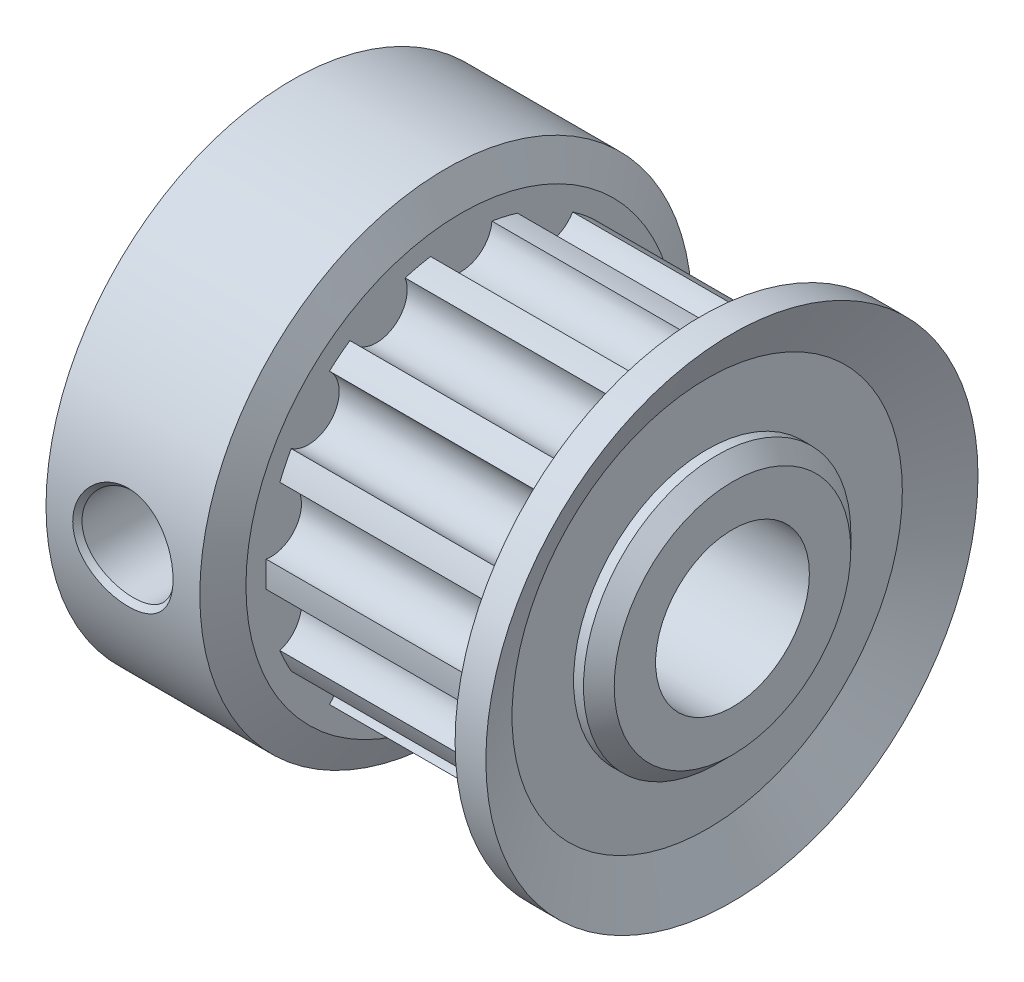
ISO-10303-21;
HEADER;
FILE_DESCRIPTION(('STEP AP214'),'2;1');
FILE_NAME('part.step','',(''),(''),'','','');
FILE_SCHEMA(('AUTOMOTIVE_DESIGN { 1 0 10303 214 1 1 1 1 }'));
ENDSEC;
DATA;
#1=APPLICATION_CONTEXT('core data for automotive mechanical design processes');
#2=APPLICATION_PROTOCOL_DEFINITION('international standard','automotive_design',2000,#1);
#3=PRODUCT_CONTEXT('',#1,'mechanical');
#4=PRODUCT('Part','Part','',(#3));
#5=PRODUCT_RELATED_PRODUCT_CATEGORY('part','',(#4));
#6=PRODUCT_DEFINITION_FORMATION('','',#4);
#7=PRODUCT_DEFINITION_CONTEXT('part definition',#1,'design');
#8=PRODUCT_DEFINITION('design','',#6,#7);
#9=PRODUCT_DEFINITION_SHAPE('','',#8);
#10=(LENGTH_UNIT() NAMED_UNIT(*) SI_UNIT(.MILLI.,.METRE.));
#11=(NAMED_UNIT(*) PLANE_ANGLE_UNIT() SI_UNIT($,.RADIAN.));
#12=(NAMED_UNIT(*) SI_UNIT($,.STERADIAN.) SOLID_ANGLE_UNIT());
#13=UNCERTAINTY_MEASURE_WITH_UNIT(LENGTH_MEASURE(1.E-05),#10,'distance_accuracy_value','');
#14=(GEOMETRIC_REPRESENTATION_CONTEXT(3) GLOBAL_UNCERTAINTY_ASSIGNED_CONTEXT((#13)) GLOBAL_UNIT_ASSIGNED_CONTEXT((#10,
#11,#12)) REPRESENTATION_CONTEXT('',''));
#15=CARTESIAN_POINT('',(0.,0.,0.));
#16=DIRECTION('',(0.,0.,1.));
#17=DIRECTION('',(1.,0.,0.));
#18=AXIS2_PLACEMENT_3D('',#15,#16,#17);
#19=CARTESIAN_POINT('',(14.8184509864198,0.,0.));
#20=DIRECTION('',(1.,0.,0.));
#21=DIRECTION('',(0.,0.,-1.));
#22=AXIS2_PLACEMENT_3D('',#19,#20,#21);
#23=CYLINDRICAL_SURFACE('',#22,8.);
#24=CARTESIAN_POINT('',(1.36903654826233,0.,8.));
#25=CARTESIAN_POINT('',(1.36903654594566,-0.0272965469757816,8.00000000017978));
#26=CARTESIAN_POINT('',(1.36969258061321,-0.0545347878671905,7.99986029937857));
#27=CARTESIAN_POINT('',(1.37230472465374,-0.108895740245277,7.9993050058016));
#28=CARTESIAN_POINT('',(1.37426084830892,-0.136018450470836,7.99888941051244));
#29=CARTESIAN_POINT('',(1.3794706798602,-0.190148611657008,7.99778571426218));
#30=CARTESIAN_POINT('',(1.38272438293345,-0.217156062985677,7.99709761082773));
#31=CARTESIAN_POINT('',(1.39053624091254,-0.271055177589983,7.9954522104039));
#32=CARTESIAN_POINT('',(1.39509436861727,-0.297946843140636,7.99449491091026));
#33=CARTESIAN_POINT('',(1.40292227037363,-0.338196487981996,7.9928595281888));
#34=CARTESIAN_POINT('',(1.40569675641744,-0.351598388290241,7.9922811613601));
#35=CARTESIAN_POINT('',(1.41157913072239,-0.378372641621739,7.99105836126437));
#36=CARTESIAN_POINT('',(1.41468611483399,-0.391741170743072,7.99041411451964));
#37=CARTESIAN_POINT('',(1.42124075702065,-0.418463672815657,7.98905922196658));
#38=CARTESIAN_POINT('',(1.42468263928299,-0.431791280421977,7.98834978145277));
#39=CARTESIAN_POINT('',(1.43186316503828,-0.458264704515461,7.98687479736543));
#40=CARTESIAN_POINT('',(1.4356076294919,-0.471434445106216,7.98610805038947));
#41=CARTESIAN_POINT('',(1.44729141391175,-0.510716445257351,7.9837244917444));
#42=CARTESIAN_POINT('',(1.4556858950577,-0.536622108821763,7.98202333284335));
#43=CARTESIAN_POINT('',(1.47366261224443,-0.587867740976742,7.97841283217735));
#44=CARTESIAN_POINT('',(1.48324538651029,-0.613209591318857,7.9765033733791));
#45=CARTESIAN_POINT('',(1.51376037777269,-0.688401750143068,7.97048507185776));
#46=CARTESIAN_POINT('',(1.53645530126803,-0.737420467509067,7.96608614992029));
#47=CARTESIAN_POINT('',(1.57403867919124,-0.809285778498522,7.95899717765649));
#48=CARTESIAN_POINT('',(1.58715759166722,-0.832963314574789,7.95655238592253));
#49=CARTESIAN_POINT('',(1.61459347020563,-0.879757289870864,7.95151437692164));
#50=CARTESIAN_POINT('',(1.62890546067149,-0.902866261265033,7.94892201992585));
#51=CARTESIAN_POINT('',(1.65877198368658,-0.948543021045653,7.94360086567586));
#52=CARTESIAN_POINT('',(1.67420494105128,-0.97092301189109,7.94089389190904));
#53=CARTESIAN_POINT('',(1.70601113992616,-1.01473012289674,7.93541492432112));
#54=CARTESIAN_POINT('',(1.72239140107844,-1.03616782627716,7.93264167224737));
#55=CARTESIAN_POINT('',(1.77294118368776,-1.09910234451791,7.9242517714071));
#56=CARTESIAN_POINT('',(1.8085185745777,-1.1392264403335,7.91856445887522));
#57=CARTESIAN_POINT('',(1.86468760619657,-1.19669252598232,7.91001277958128));
#58=CARTESIAN_POINT('',(1.88387861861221,-1.21539381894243,7.90715870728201));
#59=CARTESIAN_POINT('',(1.92320524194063,-1.25188283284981,7.90146381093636));
#60=CARTESIAN_POINT('',(1.94334189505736,-1.26967143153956,7.89862282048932));
#61=CARTESIAN_POINT('',(1.97426378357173,-1.29565748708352,7.89438716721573));
#62=CARTESIAN_POINT('',(1.98469365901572,-1.30420562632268,7.89297919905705));
#63=CARTESIAN_POINT('',(2.00578957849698,-1.32106302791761,7.89017525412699));
#64=CARTESIAN_POINT('',(2.01647113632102,-1.32938403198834,7.88877728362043));
#65=CARTESIAN_POINT('',(2.03802904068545,-1.34575075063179,7.88600176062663));
#66=CARTESIAN_POINT('',(2.0488797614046,-1.35377770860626,7.88462743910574));
#67=CARTESIAN_POINT('',(2.07074272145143,-1.36953667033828,7.88190543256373));
#68=CARTESIAN_POINT('',(2.08175172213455,-1.37726624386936,7.88055816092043));
#69=CARTESIAN_POINT('',(2.11500954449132,-1.40000928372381,7.87656086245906));
#70=CARTESIAN_POINT('',(2.13748906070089,-1.41457731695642,7.87395535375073));
#71=CARTESIAN_POINT('',(2.18305764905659,-1.4425398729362,7.86888052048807));
#72=CARTESIAN_POINT('',(2.20614673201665,-1.4559343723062,7.86641118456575));
#73=CARTESIAN_POINT('',(2.25293328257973,-1.48155537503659,7.86162600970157));
#74=CARTESIAN_POINT('',(2.27663075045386,-1.49378187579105,7.85931015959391));
#75=CARTESIAN_POINT('',(2.32463730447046,-1.51706374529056,7.85484933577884));
#76=CARTESIAN_POINT('',(2.3489463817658,-1.52811912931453,7.85270435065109));
#77=CARTESIAN_POINT('',(2.3981838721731,-1.54904686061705,7.84860290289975));
#78=CARTESIAN_POINT('',(2.42312059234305,-1.5589217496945,7.84664591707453));
#79=CARTESIAN_POINT('',(2.46097453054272,-1.57282344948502,7.84386695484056));
#80=CARTESIAN_POINT('',(2.47367648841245,-1.5773080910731,7.84296619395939));
#81=CARTESIAN_POINT('',(2.49924555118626,-1.58597483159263,7.84121823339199));
#82=CARTESIAN_POINT('',(2.51209364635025,-1.59014983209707,7.84037245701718));
#83=CARTESIAN_POINT('',(2.55066965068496,-1.60214948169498,7.83793234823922));
#84=CARTESIAN_POINT('',(2.57649340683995,-1.60947387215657,7.8364303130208));
#85=CARTESIAN_POINT('',(2.62834012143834,-1.62278896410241,7.83368382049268));
#86=CARTESIAN_POINT('',(2.65436482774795,-1.62878064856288,7.83243915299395));
#87=CARTESIAN_POINT('',(2.7327403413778,-1.644778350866,7.82910104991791));
#88=CARTESIAN_POINT('',(2.78539191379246,-1.65281131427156,7.82740348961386));
#89=CARTESIAN_POINT('',(2.86497339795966,-1.66090514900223,7.82568856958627));
#90=CARTESIAN_POINT('',(2.89160140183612,-1.66294276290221,7.82525548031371));
#91=CARTESIAN_POINT('',(2.94506163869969,-1.66568131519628,7.82467300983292));
#92=CARTESIAN_POINT('',(2.97189540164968,-1.66638182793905,7.82452373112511));
#93=CARTESIAN_POINT('',(3.01229758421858,-1.66641219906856,7.82451726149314));
#94=CARTESIAN_POINT('',(3.02580844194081,-1.66625096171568,7.82455160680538));
#95=CARTESIAN_POINT('',(3.05279189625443,-1.66558634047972,7.82469310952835));
#96=CARTESIAN_POINT('',(3.06624898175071,-1.66508404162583,7.82480003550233));
#97=CARTESIAN_POINT('',(3.10650549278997,-1.6630717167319,7.82522807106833));
#98=CARTESIAN_POINT('',(3.13323138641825,-1.6610575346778,7.82565622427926));
#99=CARTESIAN_POINT('',(3.18641061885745,-1.65570743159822,7.82678991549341));
#100=CARTESIAN_POINT('',(3.21287290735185,-1.65237155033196,7.82749544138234));
#101=CARTESIAN_POINT('',(3.26554570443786,-1.64439200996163,7.82917566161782));
#102=CARTESIAN_POINT('',(3.29175620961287,-1.63974833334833,7.83015036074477));
#103=CARTESIAN_POINT('',(3.34392653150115,-1.62915743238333,7.83236077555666));
#104=CARTESIAN_POINT('',(3.36988634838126,-1.62321020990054,7.83359649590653));
#105=CARTESIAN_POINT('',(3.42155464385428,-1.61000700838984,7.83632074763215));
#106=CARTESIAN_POINT('',(3.44726312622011,-1.60275105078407,7.83780928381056));
#107=CARTESIAN_POINT('',(3.49842632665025,-1.58691552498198,7.84103082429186));
#108=CARTESIAN_POINT('',(3.52387458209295,-1.57833798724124,7.84276342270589));
#109=CARTESIAN_POINT('',(3.56187282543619,-1.56445421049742,7.84554047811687));
#110=CARTESIAN_POINT('',(3.57451546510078,-1.55965328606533,7.84649648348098));
#111=CARTESIAN_POINT('',(3.59959666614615,-1.54976639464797,7.84845522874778));
#112=CARTESIAN_POINT('',(3.61205722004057,-1.54467352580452,7.84945936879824));
#113=CARTESIAN_POINT('',(3.67390397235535,-1.51848086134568,7.85459553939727));
#114=CARTESIAN_POINT('',(3.72203358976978,-1.49519318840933,7.85907588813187));
#115=CARTESIAN_POINT('',(3.81563983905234,-1.44407201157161,7.86862960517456));
#116=CARTESIAN_POINT('',(3.86112342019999,-1.41623861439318,7.87370329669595));
#117=CARTESIAN_POINT('',(3.9273745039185,-1.37106845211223,7.88164987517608));
#118=CARTESIAN_POINT('',(3.94912862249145,-1.355440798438,7.88435479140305));
#119=CARTESIAN_POINT('',(3.98126048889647,-1.33113171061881,7.88848248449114));
#120=CARTESIAN_POINT('',(3.99188786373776,-1.3228840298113,7.88987010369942));
#121=CARTESIAN_POINT('',(4.01297482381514,-1.30609666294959,7.89266646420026));
#122=CARTESIAN_POINT('',(4.0234332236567,-1.29755789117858,7.89407505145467));
#123=CARTESIAN_POINT('',(4.04418536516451,-1.28018142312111,7.89691161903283));
#124=CARTESIAN_POINT('',(4.05447655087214,-1.27134473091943,7.89833935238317));
#125=CARTESIAN_POINT('',(4.07476912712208,-1.25347949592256,7.9011942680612));
#126=CARTESIAN_POINT('',(4.08479472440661,-1.2444308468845,7.90262474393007));
#127=CARTESIAN_POINT('',(4.11447998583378,-1.21696806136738,7.90691671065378));
#128=CARTESIAN_POINT('',(4.13377554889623,-1.19821447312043,7.90978246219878));
#129=CARTESIAN_POINT('',(4.1901658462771,-1.14066749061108,7.91835724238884));
#130=CARTESIAN_POINT('',(4.22579555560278,-1.10056704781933,7.92404775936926));
#131=CARTESIAN_POINT('',(4.27631137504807,-1.03783385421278,7.93242369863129));
#132=CARTESIAN_POINT('',(4.29266172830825,-1.01649102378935,7.93518920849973));
#133=CARTESIAN_POINT('',(4.3243797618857,-0.972933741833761,7.94064743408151));
#134=CARTESIAN_POINT('',(4.33974755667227,-0.950719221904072,7.94334018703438));
#135=CARTESIAN_POINT('',(4.36948671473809,-0.905404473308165,7.94863278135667));
#136=CARTESIAN_POINT('',(4.38386134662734,-0.882298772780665,7.95123322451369));
#137=CARTESIAN_POINT('',(4.4115803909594,-0.835200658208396,7.95631830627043));
#138=CARTESIAN_POINT('',(4.42481115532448,-0.811402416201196,7.95878197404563));
#139=CARTESIAN_POINT('',(4.45005589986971,-0.763289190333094,7.96354029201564));
#140=CARTESIAN_POINT('',(4.46206716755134,-0.738978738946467,7.96583445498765));
#141=CARTESIAN_POINT('',(4.4848825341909,-0.68985519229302,7.97023888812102));
#142=CARTESIAN_POINT('',(4.49568661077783,-0.66504208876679,7.97234916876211));
#143=CARTESIAN_POINT('',(4.51609349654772,-0.614914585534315,7.97637212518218));
#144=CARTESIAN_POINT('',(4.5256963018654,-0.589600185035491,7.97828481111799));
#145=CARTESIAN_POINT('',(4.5436977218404,-0.538467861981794,7.98189884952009));
#146=CARTESIAN_POINT('',(4.55209635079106,-0.512649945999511,7.98360021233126));
#147=CARTESIAN_POINT('',(4.5676775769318,-0.460504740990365,7.98677767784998));
#148=CARTESIAN_POINT('',(4.57486168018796,-0.434169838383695,7.98825409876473));
#149=CARTESIAN_POINT('',(4.5847055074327,-0.394301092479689,7.99028812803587));
#150=CARTESIAN_POINT('',(4.58783362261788,-0.380938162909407,7.99093651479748));
#151=CARTESIAN_POINT('',(4.59377498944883,-0.354091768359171,7.99217116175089));
#152=CARTESIAN_POINT('',(4.59659058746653,-0.340593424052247,7.99275791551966));
#153=CARTESIAN_POINT('',(4.60451994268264,-0.300119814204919,7.99441405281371));
#154=CARTESIAN_POINT('',(4.60913248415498,-0.273110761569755,7.99538258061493));
#155=CARTESIAN_POINT('',(4.61703622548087,-0.219021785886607,7.99704705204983));
#156=CARTESIAN_POINT('',(4.62032715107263,-0.19194498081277,7.99774295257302));
#157=CARTESIAN_POINT('',(4.62823959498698,-0.110618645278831,7.99941899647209));
#158=CARTESIAN_POINT('',(4.63090498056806,-0.0562733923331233,7.99998754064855));
#159=CARTESIAN_POINT('',(4.63099125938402,0.0254360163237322,8.00000592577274));
#160=CARTESIAN_POINT('',(4.63036699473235,0.0527044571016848,7.99987297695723));
#161=CARTESIAN_POINT('',(4.62779831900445,0.107305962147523,7.99932689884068));
#162=CARTESIAN_POINT('',(4.6258527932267,0.134644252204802,7.99891352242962));
#163=CARTESIAN_POINT('',(4.62062260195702,0.189365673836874,7.99780544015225));
#164=CARTESIAN_POINT('',(4.61732322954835,0.21682231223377,7.99710764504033));
#165=CARTESIAN_POINT('',(4.60944260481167,0.271206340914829,7.99544774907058));
#166=CARTESIAN_POINT('',(4.60485327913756,0.298242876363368,7.99448393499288));
#167=CARTESIAN_POINT('',(4.59439831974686,0.351946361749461,7.99229979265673));
#168=CARTESIAN_POINT('',(4.58853187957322,0.378623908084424,7.99107929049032));
#169=CARTESIAN_POINT('',(4.57552846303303,0.431633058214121,7.98839140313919));
#170=CARTESIAN_POINT('',(4.56839148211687,0.457964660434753,7.98692401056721));
#171=CARTESIAN_POINT('',(4.55284497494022,0.510281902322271,7.98375219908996));
#172=CARTESIAN_POINT('',(4.54443360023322,0.536272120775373,7.98204740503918));
#173=CARTESIAN_POINT('',(4.53085913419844,0.574982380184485,7.97932095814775));
#174=CARTESIAN_POINT('',(4.526170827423,0.587849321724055,7.97838317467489));
#175=CARTESIAN_POINT('',(4.5164767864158,0.613480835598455,7.97645326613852));
#176=CARTESIAN_POINT('',(4.5114614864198,0.62626837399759,7.97545926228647));
#177=CARTESIAN_POINT('',(4.495990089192,0.664342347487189,7.97240847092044));
#178=CARTESIAN_POINT('',(4.48511272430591,0.689341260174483,7.9702836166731));
#179=CARTESIAN_POINT('',(4.46223561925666,0.738634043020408,7.96586668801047));
#180=CARTESIAN_POINT('',(4.45023915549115,0.762920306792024,7.96357524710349));
#181=CARTESIAN_POINT('',(4.41259889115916,0.834716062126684,7.95647930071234));
#182=CARTESIAN_POINT('',(4.3853077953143,0.88116475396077,7.95145302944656));
#183=CARTESIAN_POINT('',(4.34108986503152,0.948736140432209,7.94357690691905));
#184=CARTESIAN_POINT('',(4.32580274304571,0.970909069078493,7.94089536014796));
#185=CARTESIAN_POINT('',(4.29412289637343,1.01454885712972,7.93543786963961));
#186=CARTESIAN_POINT('',(4.27772506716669,1.03602153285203,7.9326610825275));
#187=CARTESIAN_POINT('',(4.25230093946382,1.06767652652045,7.92844124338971));
#188=CARTESIAN_POINT('',(4.24368042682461,1.07814447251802,7.92702428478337));
#189=CARTESIAN_POINT('',(4.22616070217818,1.09889393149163,7.92417452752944));
#190=CARTESIAN_POINT('',(4.21725468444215,1.10918216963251,7.922740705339));
#191=CARTESIAN_POINT('',(4.19025103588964,1.13961078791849,7.91844088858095));
#192=CARTESIAN_POINT('',(4.17183069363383,1.15936467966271,7.91557021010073));
#193=CARTESIAN_POINT('',(4.1341592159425,1.19783668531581,7.90983979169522));
#194=CARTESIAN_POINT('',(4.1149096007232,1.2165536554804,7.90698025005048));
#195=CARTESIAN_POINT('',(4.07559039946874,1.25296254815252,7.90129257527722));
#196=CARTESIAN_POINT('',(4.05552080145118,1.27065445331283,7.89846442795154));
#197=CARTESIAN_POINT('',(4.0145632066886,1.30501840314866,7.89285943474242));
#198=CARTESIAN_POINT('',(3.9936752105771,1.32169044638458,7.89008257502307));
#199=CARTESIAN_POINT('',(3.95107633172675,1.35401226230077,7.88460014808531));
#200=CARTESIAN_POINT('',(3.92936546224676,1.3696620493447,7.88189456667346));
#201=CARTESIAN_POINT('',(3.88511016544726,1.39992923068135,7.87657503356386));
#202=CARTESIAN_POINT('',(3.86255821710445,1.4145503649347,7.87396035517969));
#203=CARTESIAN_POINT('',(3.81663374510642,1.44272716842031,7.86884641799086));
#204=CARTESIAN_POINT('',(3.79317391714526,1.45632657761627,7.86633880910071));
#205=CARTESIAN_POINT('',(3.7459259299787,1.48215914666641,7.86151233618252));
#206=CARTESIAN_POINT('',(3.72205180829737,1.49444884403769,7.85918338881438));
#207=CARTESIAN_POINT('',(3.67385574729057,1.51776483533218,7.85471392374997));
#208=CARTESIAN_POINT('',(3.64952609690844,1.52879616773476,7.85257248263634));
#209=CARTESIAN_POINT('',(3.57584670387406,1.56002666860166,7.84644934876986));
#210=CARTESIAN_POINT('',(3.52580802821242,1.57836651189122,7.84276869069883));
#211=CARTESIAN_POINT('',(3.44935885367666,1.60213731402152,7.83793476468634));
#212=CARTESIAN_POINT('',(3.42364357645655,1.60943675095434,7.83643794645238));
#213=CARTESIAN_POINT('',(3.38471690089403,1.61943666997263,7.83437530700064));
#214=CARTESIAN_POINT('',(3.37168236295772,1.62261171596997,7.833718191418));
#215=CARTESIAN_POINT('',(3.34549409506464,1.62864221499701,7.83246666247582));
#216=CARTESIAN_POINT('',(3.33234009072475,1.63149763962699,7.83187225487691));
#217=CARTESIAN_POINT('',(3.30591253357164,1.63688532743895,7.83074798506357));
#218=CARTESIAN_POINT('',(3.29262732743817,1.63941890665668,7.83021784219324));
#219=CARTESIAN_POINT('',(3.26609950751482,1.64413095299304,7.82922979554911));
#220=CARTESIAN_POINT('',(3.25282334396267,1.64631649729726,7.82877041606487));
#221=CARTESIAN_POINT('',(3.21300832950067,1.65235663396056,7.82749860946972));
#222=CARTESIAN_POINT('',(3.18643892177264,1.65570404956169,7.82679062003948));
#223=CARTESIAN_POINT('',(3.10672074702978,1.66372570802,7.82509086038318));
#224=CARTESIAN_POINT('',(3.0535098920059,1.66639419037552,7.82452111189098));
#225=CARTESIAN_POINT('',(2.97362105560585,1.66640663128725,7.82451844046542));
#226=CARTESIAN_POINT('',(2.94697794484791,1.66574489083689,7.82465946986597));
#227=CARTESIAN_POINT('',(2.89366454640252,1.66308054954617,7.82522619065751));
#228=CARTESIAN_POINT('',(2.86699425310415,1.66107801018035,7.82565188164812));
#229=CARTESIAN_POINT('',(2.81362615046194,1.65571334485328,7.82678866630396));
#230=CARTESIAN_POINT('',(2.78692695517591,1.65235105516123,7.82749980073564));
#231=CARTESIAN_POINT('',(2.73350594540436,1.64423830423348,7.82920798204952));
#232=CARTESIAN_POINT('',(2.70701829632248,1.63952356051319,7.83019747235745));
#233=CARTESIAN_POINT('',(2.65447025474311,1.62880663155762,7.83243378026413));
#234=CARTESIAN_POINT('',(2.62841117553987,1.62280459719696,7.83368056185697));
#235=CARTESIAN_POINT('',(2.57671557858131,1.60953352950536,7.83641804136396));
#236=CARTESIAN_POINT('',(2.55107908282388,1.60226443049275,7.83790875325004));
#237=CARTESIAN_POINT('',(2.4747970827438,1.57857251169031,7.84272711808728));
#238=CARTESIAN_POINT('',(2.42477679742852,1.56026881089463,7.84640121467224));
#239=CARTESIAN_POINT('',(2.35100358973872,1.52903156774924,7.8525266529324));
#240=CARTESIAN_POINT('',(2.32662009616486,1.517986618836,7.85467110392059));
#241=CARTESIAN_POINT('',(2.2903660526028,1.50046038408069,7.85803118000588));
#242=CARTESIAN_POINT('',(2.27833217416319,1.49445694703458,7.85917538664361));
#243=CARTESIAN_POINT('',(2.25437724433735,1.48212984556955,7.8615094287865));
#244=CARTESIAN_POINT('',(2.2424410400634,1.47579787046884,7.86270081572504));
#245=CARTESIAN_POINT('',(2.218726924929,1.46283427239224,7.86512297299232));
#246=CARTESIAN_POINT('',(2.20698074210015,1.45622054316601,7.86635041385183));
#247=CARTESIAN_POINT('',(2.18368741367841,1.44272131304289,7.8688374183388));
#248=CARTESIAN_POINT('',(2.17214360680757,1.43583765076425,7.87009663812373));
#249=CARTESIAN_POINT('',(2.13781733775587,1.4147884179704,7.87391752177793));
#250=CARTESIAN_POINT('',(2.11533988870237,1.40022478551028,7.87652241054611));
#251=CARTESIAN_POINT('',(2.04910747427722,1.35496329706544,7.88447924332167));
#252=CARTESIAN_POINT('',(2.00654992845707,1.32269820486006,7.88997345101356));
#253=CARTESIAN_POINT('',(1.92459547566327,1.25400563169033,7.90118221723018));
#254=CARTESIAN_POINT('',(1.8851944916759,1.21756994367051,7.90689804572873));
#255=CARTESIAN_POINT('',(1.8379666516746,1.1693779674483,7.91407933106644));
#256=CARTESIAN_POINT('',(1.82861791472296,1.15959925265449,7.91551827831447));
#257=CARTESIAN_POINT('',(1.81013455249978,1.139785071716,7.91839569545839));
#258=CARTESIAN_POINT('',(1.80097865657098,1.12972435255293,7.91983762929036));
#259=CARTESIAN_POINT('',(1.78296012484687,1.10942789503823,7.92270627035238));
#260=CARTESIAN_POINT('',(1.77409012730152,1.09918531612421,7.92413405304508));
#261=CARTESIAN_POINT('',(1.75662635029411,1.0785133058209,7.92697406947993));
#262=CARTESIAN_POINT('',(1.7480324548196,1.06808385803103,7.92838631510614));
#263=CARTESIAN_POINT('',(1.72266101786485,1.03651728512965,7.93259621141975));
#264=CARTESIAN_POINT('',(1.70629349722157,1.01510208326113,7.93536701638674));
#265=CARTESIAN_POINT('',(1.67463863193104,0.971536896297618,7.94081846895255));
#266=CARTESIAN_POINT('',(1.65935130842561,0.949386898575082,7.94349913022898));
#267=CARTESIAN_POINT('',(1.62985174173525,0.904353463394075,7.94875202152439));
#268=CARTESIAN_POINT('',(1.61563950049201,0.881470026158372,7.95132426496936));
#269=CARTESIAN_POINT('',(1.58829299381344,0.834965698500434,7.95634207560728));
#270=CARTESIAN_POINT('',(1.57515871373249,0.811344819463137,7.95878765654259));
#271=CARTESIAN_POINT('',(1.549979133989,0.763356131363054,7.96353368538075));
#272=CARTESIAN_POINT('',(1.53793091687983,0.738980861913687,7.96583472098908));
#273=CARTESIAN_POINT('',(1.52069862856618,0.701868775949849,7.96916151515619));
#274=CARTESIAN_POINT('',(1.51509191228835,0.689399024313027,7.97025019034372));
#275=CARTESIAN_POINT('',(1.50415537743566,0.664258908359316,7.9723847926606));
#276=CARTESIAN_POINT('',(1.4988430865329,0.651628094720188,7.97342730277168));
#277=CARTESIAN_POINT('',(1.48340549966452,0.613634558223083,7.97647145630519));
#278=CARTESIAN_POINT('',(1.47375630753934,0.588124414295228,7.97839409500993));
#279=CARTESIAN_POINT('',(1.45573332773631,0.536767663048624,7.98201372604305));
#280=CARTESIAN_POINT('',(1.44735766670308,0.510917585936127,7.98371109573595));
#281=CARTESIAN_POINT('',(1.42412042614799,0.432856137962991,7.98845126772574));
#282=CARTESIAN_POINT('',(1.41114442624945,0.380134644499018,7.99114227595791));
#283=CARTESIAN_POINT('',(1.3954673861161,0.30002505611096,7.99441674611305));
#284=CARTESIAN_POINT('',(1.39087388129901,0.273150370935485,7.99538124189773));
#285=CARTESIAN_POINT('',(1.38296778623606,0.219053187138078,7.99704620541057));
#286=CARTESIAN_POINT('',(1.37965587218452,0.191834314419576,7.99774652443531));
#287=CARTESIAN_POINT('',(1.37566600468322,0.15072882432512,7.99859171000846));
#288=CARTESIAN_POINT('',(1.37449906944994,0.136967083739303,7.99883923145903));
#289=CARTESIAN_POINT('',(1.37250547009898,0.109495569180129,7.99926241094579));
#290=CARTESIAN_POINT('',(1.37167661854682,0.0957687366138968,7.99943853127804));
#291=CARTESIAN_POINT('',(1.36969331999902,0.0546590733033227,7.99986013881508));
#292=CARTESIAN_POINT('',(1.36903655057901,0.0272965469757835,7.99999999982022));
#293=CARTESIAN_POINT('',(1.36903654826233,0.,8.));
#294=B_SPLINE_CURVE_WITH_KNOTS('',3,(#24,#25,#26,#27,#28,#29,#30,#31,#32,#33,#34,#35,#36,#37,
#38,#39,#40,#41,#42,#43,#44,#45,#46,#47,#48,#49,#50,#51,#52,#53,#54,#55,#56,#57,#58,#59,#60,#61,
#62,#63,#64,#65,#66,#67,#68,#69,#70,#71,#72,#73,#74,#75,#76,#77,#78,#79,#80,#81,#82,#83,#84,#85,
#86,#87,#88,#89,#90,#91,#92,#93,#94,#95,#96,#97,#98,#99,#100,#101,#102,#103,#104,#105,#106,#107,
#108,#109,#110,#111,#112,#113,#114,#115,#116,#117,#118,#119,#120,#121,#122,#123,#124,#125,#126,
#127,#128,#129,#130,#131,#132,#133,#134,#135,#136,#137,#138,#139,#140,#141,#142,#143,#144,#145,
#146,#147,#148,#149,#150,#151,#152,#153,#154,#155,#156,#157,#158,#159,#160,#161,#162,#163,#164,
#165,#166,#167,#168,#169,#170,#171,#172,#173,#174,#175,#176,#177,#178,#179,#180,#181,#182,#183,
#184,#185,#186,#187,#188,#189,#190,#191,#192,#193,#194,#195,#196,#197,#198,#199,#200,#201,#202,
#203,#204,#205,#206,#207,#208,#209,#210,#211,#212,#213,#214,#215,#216,#217,#218,#219,#220,#221,
#222,#223,#224,#225,#226,#227,#228,#229,#230,#231,#232,#233,#234,#235,#236,#237,#238,#239,#240,
#241,#242,#243,#244,#245,#246,#247,#248,#249,#250,#251,#252,#253,#254,#255,#256,#257,#258,#259,
#260,#261,#262,#263,#264,#265,#266,#267,#268,#269,#270,#271,#272,#273,#274,#275,#276,#277,#278,
#279,#280,#281,#282,#283,#284,#285,#286,#287,#288,#289,#290,#291,#292,#293),.UNSPECIFIED.,.T.,
.F.,(4,2,2,2,2,2,2,2,2,2,2,2,2,2,2,2,2,2,2,2,2,2,2,2,2,2,2,2,2,2,2,2,2,2,2,2,2,2,2,2,2,2,2,2,2,
2,2,2,2,2,2,2,2,2,2,2,2,2,2,2,2,2,2,2,2,2,2,2,2,2,2,2,2,2,2,2,2,2,2,2,2,2,2,2,2,2,2,2,2,2,2,2,2,
2,2,2,2,2,2,2,2,2,2,2,2,2,2,2,2,2,2,2,2,2,2,2,2,2,2,2,2,2,2,2,2,2,2,2,2,2,2,2,2,2,4),
(0.000408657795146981,0.000488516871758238,0.000568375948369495,0.000648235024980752,
0.000728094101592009,0.000768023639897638,0.000807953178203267,0.000847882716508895,
0.000887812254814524,0.000967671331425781,0.00104753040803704,0.00120724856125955,
0.00128710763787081,0.00136696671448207,0.00144682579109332,0.00152668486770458,
0.00168640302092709,0.00176626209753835,0.00184612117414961,0.00188605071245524,
0.00192598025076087,0.00196590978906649,0.00200583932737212,0.00208569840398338,
0.00216555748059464,0.00224541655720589,0.00232527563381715,0.00240513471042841,
0.00244506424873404,0.00248499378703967,0.00256485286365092,0.00264471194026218,
0.00280443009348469,0.00288428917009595,0.00296414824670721,0.00300407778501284,
0.00304400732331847,0.00312386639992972,0.00320372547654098,0.00328358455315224,
0.0033634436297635,0.00344330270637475,0.00352316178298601,0.00356309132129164,
0.00360302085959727,0.00376273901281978,0.0039224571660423,0.00400231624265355,
0.00404224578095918,0.00408217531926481,0.00412210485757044,0.00416203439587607,
0.00424189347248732,0.00440161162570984,0.00448147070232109,0.00456132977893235,
0.00464118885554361,0.00472104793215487,0.00480090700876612,0.00488076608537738,
0.00496062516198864,0.00504048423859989,0.00512034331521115,0.00516027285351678,
0.00520020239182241,0.00528006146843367,0.00535992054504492,0.00551963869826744,
0.0055994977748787,0.00567935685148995,0.00575921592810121,0.00583907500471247,
0.00591893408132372,0.00599879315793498,0.00607865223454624,0.00611858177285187,
0.0061585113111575,0.00623837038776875,0.00631822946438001,0.00647794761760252,
0.00655780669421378,0.00663766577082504,0.00667759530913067,0.0067175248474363,
0.00679738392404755,0.00687724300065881,0.00695710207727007,0.00703696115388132,
0.00711682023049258,0.00719667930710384,0.0072765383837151,0.00735639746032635,
0.00743625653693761,0.00759597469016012,0.00767583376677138,0.00771576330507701,
0.00775569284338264,0.00779562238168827,0.00783555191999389,0.00791541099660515,
0.00807512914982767,0.00815498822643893,0.00823484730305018,0.00831470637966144,
0.0083945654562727,0.00847442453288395,0.00855428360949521,0.00871400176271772,
0.00879386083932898,0.00883379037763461,0.00887371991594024,0.00891364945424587,
0.0089535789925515,0.00903343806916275,0.00919315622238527,0.00935287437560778,
0.00939280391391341,0.00943273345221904,0.00947266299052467,0.0095125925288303,
0.00959245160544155,0.00967231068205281,0.00975216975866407,0.00983202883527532,
0.00991188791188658,0.00995181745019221,0.00999174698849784,0.0100716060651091,
0.0101514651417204,0.0103111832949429,0.0103910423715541,0.0104709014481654,0.010510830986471,
0.0105507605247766,0.0106306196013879),.UNSPECIFIED.);
#295=CARTESIAN_POINT('',(1.36903654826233,0.,8.));
#296=VERTEX_POINT('',#295);
#297=EDGE_CURVE('E58',#296,#296,#294,.F.);
#298=ORIENTED_EDGE('',*,*,#297,.T.);
#299=EDGE_LOOP('',(#298));
#300=FACE_BOUND('',#299,.T.);
#301=CARTESIAN_POINT('',(5.5,0.,0.));
#302=DIRECTION('',(1.,0.,0.));
#303=DIRECTION('',(0.,0.,-1.));
#304=AXIS2_PLACEMENT_3D('',#301,#302,#303);
#305=CIRCLE('',#304,8.);
#306=CARTESIAN_POINT('',(5.5,0.,-8.));
#307=VERTEX_POINT('',#306);
#308=EDGE_CURVE('E293',#307,#307,#305,.T.);
#309=ORIENTED_EDGE('',*,*,#308,.F.);
#310=EDGE_LOOP('',(#309));
#311=FACE_BOUND('',#310,.T.);
#312=CARTESIAN_POINT('',(0.5,0.,0.));
#313=DIRECTION('',(1.,0.,0.));
#314=DIRECTION('',(0.,0.,-1.));
#315=AXIS2_PLACEMENT_3D('',#312,#313,#314);
#316=CIRCLE('',#315,8.);
#317=CARTESIAN_POINT('',(0.5,0.,-8.));
#318=VERTEX_POINT('',#317);
#319=EDGE_CURVE('E297',#318,#318,#316,.T.);
#320=ORIENTED_EDGE('',*,*,#319,.T.);
#321=EDGE_LOOP('',(#320));
#322=FACE_BOUND('',#321,.T.);
#323=ADVANCED_FACE('F43',(#300,#311,#322),#23,.T.);
#324=CARTESIAN_POINT('',(0.,0.,0.));
#325=DIRECTION('',(1.,0.,0.));
#326=DIRECTION('',(0.,0.,-1.));
#327=AXIS2_PLACEMENT_3D('',#324,#325,#326);
#328=CYLINDRICAL_SURFACE('',#327,2.5);
#329=CARTESIAN_POINT('',(0.,0.,0.));
#330=DIRECTION('',(1.,0.,0.));
#331=DIRECTION('',(0.,0.,-1.));
#332=AXIS2_PLACEMENT_3D('',#329,#330,#331);
#333=CIRCLE('',#332,2.5);
#334=CARTESIAN_POINT('',(0.,0.,-2.5));
#335=VERTEX_POINT('',#334);
#336=EDGE_CURVE('E385',#335,#335,#333,.T.);
#337=ORIENTED_EDGE('',*,*,#336,.F.);
#338=EDGE_LOOP('',(#337));
#339=FACE_BOUND('',#338,.T.);
#340=CARTESIAN_POINT('',(14.8184509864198,0.,0.));
#341=DIRECTION('',(1.,0.,0.));
#342=DIRECTION('',(0.,0.,-1.));
#343=AXIS2_PLACEMENT_3D('',#340,#341,#342);
#344=CIRCLE('',#343,2.5);
#345=CARTESIAN_POINT('',(14.8184509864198,0.,-2.5));
#346=VERTEX_POINT('',#345);
#347=EDGE_CURVE('E388',#346,#346,#344,.T.);
#348=ORIENTED_EDGE('',*,*,#347,.T.);
#349=EDGE_LOOP('',(#348));
#350=FACE_BOUND('',#349,.T.);
#351=CARTESIAN_POINT('',(1.5,0.,2.5));
#352=CARTESIAN_POINT('',(1.50000409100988,0.0767298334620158,2.49999625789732));
#353=CARTESIAN_POINT('',(1.50592867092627,0.153582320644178,2.4964290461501));
#354=CARTESIAN_POINT('',(1.52932431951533,0.304975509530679,2.48249903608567));
#355=CARTESIAN_POINT('',(1.54682386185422,0.379510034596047,2.47211948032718));
#356=CARTESIAN_POINT('',(1.59238636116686,0.523751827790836,2.44561558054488));
#357=CARTESIAN_POINT('',(1.62039695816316,0.593481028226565,2.42951973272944));
#358=CARTESIAN_POINT('',(1.68586033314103,0.727030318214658,2.39295367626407));
#359=CARTESIAN_POINT('',(1.72331076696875,0.790851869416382,2.37248455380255));
#360=CARTESIAN_POINT('',(1.80977482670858,0.916299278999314,2.32705360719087));
#361=CARTESIAN_POINT('',(1.85945369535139,0.977384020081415,2.30186792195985));
#362=CARTESIAN_POINT('',(1.96746720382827,1.09088270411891,2.25030439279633));
#363=CARTESIAN_POINT('',(2.02581293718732,1.14328534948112,2.2239250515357));
#364=CARTESIAN_POINT('',(2.15792351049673,1.24444996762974,2.1691106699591));
#365=CARTESIAN_POINT('',(2.23270177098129,1.29197766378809,2.14082017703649));
#366=CARTESIAN_POINT('',(2.39084657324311,1.37361437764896,2.08938301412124));
#367=CARTESIAN_POINT('',(2.47419889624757,1.4077451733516,2.06622802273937));
#368=CARTESIAN_POINT('',(2.62659645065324,1.45440601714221,2.0335462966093));
#369=CARTESIAN_POINT('',(2.69423599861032,1.47016197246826,2.02207883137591));
#370=CARTESIAN_POINT('',(2.83180371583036,1.49216172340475,2.00590308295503));
#371=CARTESIAN_POINT('',(2.90172892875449,1.49841734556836,2.00118639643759));
#372=CARTESIAN_POINT('',(3.04201149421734,1.50105508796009,1.99920922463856));
#373=CARTESIAN_POINT('',(3.1123694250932,1.49741783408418,2.00196337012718));
#374=CARTESIAN_POINT('',(3.25127877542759,1.48046060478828,2.01453261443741));
#375=CARTESIAN_POINT('',(3.31982879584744,1.46713334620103,2.02435302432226));
#376=CARTESIAN_POINT('',(3.4525302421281,1.43173921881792,2.04953186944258));
#377=CARTESIAN_POINT('',(3.51672705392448,1.40978748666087,2.06481711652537));
#378=CARTESIAN_POINT('',(3.64069499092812,1.35795061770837,2.09927051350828));
#379=CARTESIAN_POINT('',(3.70046448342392,1.32806257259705,2.11844008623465));
#380=CARTESIAN_POINT('',(3.8249840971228,1.25517983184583,2.16255327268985));
#381=CARTESIAN_POINT('',(3.88877809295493,1.21080724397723,2.18792043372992));
#382=CARTESIAN_POINT('',(4.00867648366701,1.11291092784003,2.23930599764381));
#383=CARTESIAN_POINT('',(4.06477343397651,1.05937845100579,2.26532500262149));
#384=CARTESIAN_POINT('',(4.17561298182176,0.935811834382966,2.31935504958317));
#385=CARTESIAN_POINT('',(4.22907730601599,0.864517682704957,2.34713836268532));
#386=CARTESIAN_POINT('',(4.32312204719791,0.712276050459,2.3977242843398));
#387=CARTESIAN_POINT('',(4.36370935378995,0.631333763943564,2.42052955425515));
#388=CARTESIAN_POINT('',(4.4279321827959,0.467197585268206,2.45730392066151));
#389=CARTESIAN_POINT('',(4.45247535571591,0.38446762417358,2.47173957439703));
#390=CARTESIAN_POINT('',(4.48701119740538,0.21504789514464,2.4921884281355));
#391=CARTESIAN_POINT('',(4.49702131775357,0.128363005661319,2.49821172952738));
#392=CARTESIAN_POINT('',(4.50150784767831,-0.0337146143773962,2.5009057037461));
#393=CARTESIAN_POINT('',(4.49790885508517,-0.109042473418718,2.49873521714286));
#394=CARTESIAN_POINT('',(4.47957414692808,-0.25782940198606,2.48778712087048));
#395=CARTESIAN_POINT('',(4.46483865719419,-0.331288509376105,2.47900964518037));
#396=CARTESIAN_POINT('',(4.42545656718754,-0.472574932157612,2.4559479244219));
#397=CARTESIAN_POINT('',(4.40105965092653,-0.540495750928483,2.44180275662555));
#398=CARTESIAN_POINT('',(4.34332262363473,-0.671265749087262,2.40913880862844));
#399=CARTESIAN_POINT('',(4.30998074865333,-0.734113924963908,2.39061916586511));
#400=CARTESIAN_POINT('',(4.2314430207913,-0.860006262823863,2.3484549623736));
#401=CARTESIAN_POINT('',(4.18537617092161,-0.922394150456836,2.3244780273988));
#402=CARTESIAN_POINT('',(4.08460860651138,-1.03902603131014,2.27474265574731));
#403=CARTESIAN_POINT('',(4.02989784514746,-1.09326040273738,2.2489821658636));
#404=CARTESIAN_POINT('',(3.90508960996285,-1.19931996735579,2.19445423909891));
#405=CARTESIAN_POINT('',(3.8339161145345,-1.24991019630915,2.16573241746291));
#406=CARTESIAN_POINT('',(3.6827839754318,-1.33845238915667,2.1121618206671));
#407=CARTESIAN_POINT('',(3.60283470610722,-1.37641766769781,2.0873089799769));
#408=CARTESIAN_POINT('',(3.45375697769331,-1.43142578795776,2.04984909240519));
#409=CARTESIAN_POINT('',(3.38601968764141,-1.4512162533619,2.03575659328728));
#410=CARTESIAN_POINT('',(3.2474679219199,-1.48113663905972,2.01409605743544));
#411=CARTESIAN_POINT('',(3.17665785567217,-1.4912799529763,2.00651897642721));
#412=CARTESIAN_POINT('',(3.03362305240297,-1.50134130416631,1.99900446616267));
#413=CARTESIAN_POINT('',(2.96139400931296,-1.50122089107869,1.99909576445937));
#414=CARTESIAN_POINT('',(2.81810556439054,-1.49066472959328,2.0069771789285));
#415=CARTESIAN_POINT('',(2.7470468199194,-1.48022337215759,2.0147714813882));
#416=CARTESIAN_POINT('',(2.61151158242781,-1.45040174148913,2.0363318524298));
#417=CARTESIAN_POINT('',(2.54688290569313,-1.43147636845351,2.0497921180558));
#418=CARTESIAN_POINT('',(2.42166274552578,-1.38563242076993,2.08105501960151));
#419=CARTESIAN_POINT('',(2.36107279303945,-1.35871083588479,2.09885929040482));
#420=CARTESIAN_POINT('',(2.23568014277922,-1.29289245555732,2.14012990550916));
#421=CARTESIAN_POINT('',(2.17165889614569,-1.25279167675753,2.16404587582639));
#422=CARTESIAN_POINT('',(2.05061992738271,-1.16375698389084,2.21320127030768));
#423=CARTESIAN_POINT('',(1.99360803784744,-1.11481579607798,2.23844177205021));
#424=CARTESIAN_POINT('',(1.87864905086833,-1.00009777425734,2.29225690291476));
#425=CARTESIAN_POINT('',(1.82206892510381,-0.932876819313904,2.32070308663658));
#426=CARTESIAN_POINT('',(1.72090214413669,-0.788462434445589,2.37365428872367));
#427=CARTESIAN_POINT('',(1.67631978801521,-0.71126544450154,2.39815789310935));
#428=CARTESIAN_POINT('',(1.60221419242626,-0.551125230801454,2.43985578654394));
#429=CARTESIAN_POINT('',(1.57227193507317,-0.468430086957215,2.45725077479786));
#430=CARTESIAN_POINT('',(1.52727530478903,-0.297973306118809,2.48366273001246));
#431=CARTESIAN_POINT('',(1.51216483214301,-0.210232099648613,2.49271125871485));
#432=CARTESIAN_POINT('',(1.50330254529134,-0.101558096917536,2.49802001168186));
#433=CARTESIAN_POINT('',(1.5020655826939,-0.0812762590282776,2.49876114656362));
#434=CARTESIAN_POINT('',(1.50041375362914,-0.0406658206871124,2.49975164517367));
#435=CARTESIAN_POINT('',(1.4999989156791,-0.0203372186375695,2.50000099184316));
#436=CARTESIAN_POINT('',(1.5,0.,2.5));
#437=B_SPLINE_CURVE_WITH_KNOTS('',3,(#351,#352,#353,#354,#355,#356,#357,#358,#359,#360,#361,
#362,#363,#364,#365,#366,#367,#368,#369,#370,#371,#372,#373,#374,#375,#376,#377,#378,#379,#380,
#381,#382,#383,#384,#385,#386,#387,#388,#389,#390,#391,#392,#393,#394,#395,#396,#397,#398,#399,
#400,#401,#402,#403,#404,#405,#406,#407,#408,#409,#410,#411,#412,#413,#414,#415,#416,#417,#418,
#419,#420,#421,#422,#423,#424,#425,#426,#427,#428,#429,#430,#431,#432,#433,#434,#435,#436),
.UNSPECIFIED.,.T.,.F.,(4,2,2,2,2,2,2,2,2,2,2,2,2,2,2,2,2,2,2,2,2,2,2,2,2,2,2,2,2,2,2,2,2,2,2,2,
2,2,2,2,2,2,4),(0.,0.230102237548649,0.460772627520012,0.690308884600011,0.919788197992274,
1.16681590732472,1.414162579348,1.69183813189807,1.96906040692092,2.17933829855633,
2.38935420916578,2.59978170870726,2.81036753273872,3.01823267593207,3.22617409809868,
3.47046995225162,3.71500044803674,3.99360957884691,4.27206939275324,4.53296790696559,
4.79355286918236,5.01875602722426,5.24395461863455,5.46367785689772,5.68344445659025,
5.92601365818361,6.16886690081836,6.44336762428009,6.71757792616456,6.93257787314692,
7.14727888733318,7.36278425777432,7.57840681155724,7.78364098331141,7.98895251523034,
8.22578610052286,8.46281544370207,8.73854311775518,9.01436946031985,9.28175654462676,
9.54812832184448,9.60911473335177,9.6701032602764),.UNSPECIFIED.);
#438=CARTESIAN_POINT('',(1.5,0.,2.5));
#439=VERTEX_POINT('',#438);
#440=EDGE_CURVE('E321',#439,#439,#437,.T.);
#441=ORIENTED_EDGE('',*,*,#440,.F.);
#442=EDGE_LOOP('',(#441));
#443=FACE_BOUND('',#442,.T.);
#444=ADVANCED_FACE('F333',(#339,#350,#443),#328,.F.);
#445=CARTESIAN_POINT('',(14.8184509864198,0.,0.));
#446=DIRECTION('',(1.,0.,0.));
#447=DIRECTION('',(0.,0.,-1.));
#448=AXIS2_PLACEMENT_3D('',#445,#446,#447);
#449=CYLINDRICAL_SURFACE('',#448,6.35425396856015);
#450=CARTESIAN_POINT('',(13.,0.,0.));
#451=DIRECTION('',(1.,0.,0.));
#452=DIRECTION('',(0.,0.,-1.));
#453=AXIS2_PLACEMENT_3D('',#450,#451,#452);
#454=CIRCLE('',#453,6.35425396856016);
#455=CARTESIAN_POINT('',(13.,6.08662847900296,-1.82469100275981));
#456=VERTEX_POINT('',#455);
#457=CARTESIAN_POINT('',(13.,6.27556652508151,-0.996899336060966));
#458=VERTEX_POINT('',#457);
#459=EDGE_CURVE('E243',#456,#458,#454,.T.);
#460=ORIENTED_EDGE('',*,*,#459,.F.);
#461=DIRECTION('',(-1.,0.,0.));
#462=VECTOR('',#461,1.);
#463=CARTESIAN_POINT('',(9.5,6.08662847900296,-1.82469100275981));
#464=LINE('',#463,#462);
#465=CARTESIAN_POINT('',(6.,6.08662847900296,-1.82469100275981));
#466=VERTEX_POINT('',#465);
#467=EDGE_CURVE('E391',#456,#466,#464,.T.);
#468=ORIENTED_EDGE('',*,*,#467,.T.);
#469=CARTESIAN_POINT('',(6.,0.,0.));
#470=DIRECTION('',(1.,0.,0.));
#471=DIRECTION('',(0.,0.,-1.));
#472=AXIS2_PLACEMENT_3D('',#469,#470,#471);
#473=CIRCLE('',#472,6.35425396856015);
#474=CARTESIAN_POINT('',(6.,6.27556652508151,-0.996899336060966));
#475=VERTEX_POINT('',#474);
#476=EDGE_CURVE('E264',#466,#475,#473,.T.);
#477=ORIENTED_EDGE('',*,*,#476,.T.);
#478=DIRECTION('',(-1.,0.,0.));
#479=VECTOR('',#478,1.);
#480=CARTESIAN_POINT('',(9.5,6.27556652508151,-0.996899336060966));
#481=LINE('',#480,#479);
#482=EDGE_CURVE('E249',#475,#458,#481,.F.);
#483=ORIENTED_EDGE('',*,*,#482,.T.);
#484=EDGE_LOOP('',(#460,#468,#477,#483));
#485=FACE_BOUND('',#484,.T.);
#486=ADVANCED_FACE('F260',(#485),#449,.T.);
#487=CARTESIAN_POINT('',(6.,4.69215901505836,-4.28487891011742));
#488=VERTEX_POINT('',#487);
#489=CARTESIAN_POINT('',(6.,5.22155165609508,-3.62104153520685));
#490=VERTEX_POINT('',#489);
#491=EDGE_CURVE('E606',#488,#490,#473,.T.);
#492=ORIENTED_EDGE('',*,*,#491,.T.);
#493=DIRECTION('',(-1.,0.,0.));
#494=VECTOR('',#493,1.);
#495=CARTESIAN_POINT('',(9.5,5.22155165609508,-3.62104153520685));
#496=LINE('',#495,#494);
#497=CARTESIAN_POINT('',(13.,5.22155165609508,-3.62104153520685));
#498=VERTEX_POINT('',#497);
#499=EDGE_CURVE('E397',#490,#498,#496,.F.);
#500=ORIENTED_EDGE('',*,*,#499,.T.);
#501=CARTESIAN_POINT('',(13.,4.69215901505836,-4.28487891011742));
#502=VERTEX_POINT('',#501);
#503=EDGE_CURVE('E274',#502,#498,#454,.T.);
#504=ORIENTED_EDGE('',*,*,#503,.F.);
#505=DIRECTION('',(-1.,0.,0.));
#506=VECTOR('',#505,1.);
#507=CARTESIAN_POINT('',(9.5,4.69215901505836,-4.28487891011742));
#508=LINE('',#507,#506);
#509=EDGE_CURVE('E595',#502,#488,#508,.T.);
#510=ORIENTED_EDGE('',*,*,#509,.T.);
#511=EDGE_LOOP('',(#492,#500,#504,#510));
#512=FACE_BOUND('',#511,.T.);
#513=ADVANCED_FACE('F377',(#512),#449,.T.);
#514=CARTESIAN_POINT('',(6.,2.36834991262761,-5.8963939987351));
#515=VERTEX_POINT('',#514);
#516=CARTESIAN_POINT('',(6.,3.13334444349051,-5.52799204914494));
#517=VERTEX_POINT('',#516);
#518=EDGE_CURVE('E288',#515,#517,#473,.T.);
#519=ORIENTED_EDGE('',*,*,#518,.T.);
#520=DIRECTION('',(-1.,0.,0.));
#521=VECTOR('',#520,1.);
#522=CARTESIAN_POINT('',(9.5,3.13334444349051,-5.52799204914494));
#523=LINE('',#522,#521);
#524=CARTESIAN_POINT('',(13.,3.13334444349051,-5.52799204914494));
#525=VERTEX_POINT('',#524);
#526=EDGE_CURVE('E591',#517,#525,#523,.F.);
#527=ORIENTED_EDGE('',*,*,#526,.T.);
#528=CARTESIAN_POINT('',(13.,2.36834991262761,-5.8963939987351));
#529=VERTEX_POINT('',#528);
#530=EDGE_CURVE('E280',#529,#525,#454,.T.);
#531=ORIENTED_EDGE('',*,*,#530,.F.);
#532=DIRECTION('',(-1.,0.,0.));
#533=VECTOR('',#532,1.);
#534=CARTESIAN_POINT('',(9.5,2.36834991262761,-5.8963939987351));
#535=LINE('',#534,#533);
#536=EDGE_CURVE('E587',#529,#515,#535,.T.);
#537=ORIENTED_EDGE('',*,*,#536,.T.);
#538=EDGE_LOOP('',(#519,#527,#531,#537));
#539=FACE_BOUND('',#538,.T.);
#540=ADVANCED_FACE('F618',(#539),#449,.T.);
#541=CARTESIAN_POINT('',(6.,-0.424539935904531,-6.34005594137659));
#542=VERTEX_POINT('',#541);
#543=CARTESIAN_POINT('',(6.,0.424539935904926,-6.34005594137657));
#544=VERTEX_POINT('',#543);
#545=EDGE_CURVE('E279',#542,#544,#473,.T.);
#546=ORIENTED_EDGE('',*,*,#545,.T.);
#547=DIRECTION('',(-1.,0.,0.));
#548=VECTOR('',#547,1.);
#549=CARTESIAN_POINT('',(9.5,0.424539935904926,-6.34005594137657));
#550=LINE('',#549,#548);
#551=CARTESIAN_POINT('',(13.,0.424539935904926,-6.34005594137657));
#552=VERTEX_POINT('',#551);
#553=EDGE_CURVE('E583',#544,#552,#550,.F.);
#554=ORIENTED_EDGE('',*,*,#553,.T.);
#555=CARTESIAN_POINT('',(13.,-0.424539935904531,-6.3400559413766));
#556=VERTEX_POINT('',#555);
#557=EDGE_CURVE('E281',#556,#552,#454,.T.);
#558=ORIENTED_EDGE('',*,*,#557,.F.);
#559=DIRECTION('',(-1.,0.,0.));
#560=VECTOR('',#559,1.);
#561=CARTESIAN_POINT('',(9.5,-0.424539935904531,-6.3400559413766));
#562=LINE('',#561,#560);
#563=EDGE_CURVE('E579',#556,#542,#562,.T.);
#564=ORIENTED_EDGE('',*,*,#563,.T.);
#565=EDGE_LOOP('',(#546,#554,#558,#564));
#566=FACE_BOUND('',#565,.T.);
#567=ADVANCED_FACE('F768',(#566),#449,.T.);
#568=CARTESIAN_POINT('',(6.,-3.13334444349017,-5.52799204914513));
#569=VERTEX_POINT('',#568);
#570=CARTESIAN_POINT('',(6.,-2.36834991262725,-5.89639399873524));
#571=VERTEX_POINT('',#570);
#572=EDGE_CURVE('E287',#569,#571,#473,.T.);
#573=ORIENTED_EDGE('',*,*,#572,.T.);
#574=DIRECTION('',(-1.,0.,0.));
#575=VECTOR('',#574,1.);
#576=CARTESIAN_POINT('',(9.5,-2.36834991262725,-5.89639399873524));
#577=LINE('',#576,#575);
#578=CARTESIAN_POINT('',(13.,-2.36834991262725,-5.89639399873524));
#579=VERTEX_POINT('',#578);
#580=EDGE_CURVE('E575',#571,#579,#577,.F.);
#581=ORIENTED_EDGE('',*,*,#580,.T.);
#582=CARTESIAN_POINT('',(13.,-3.13334444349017,-5.52799204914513));
#583=VERTEX_POINT('',#582);
#584=EDGE_CURVE('E429',#583,#579,#454,.T.);
#585=ORIENTED_EDGE('',*,*,#584,.F.);
#586=DIRECTION('',(-1.,0.,0.));
#587=VECTOR('',#586,1.);
#588=CARTESIAN_POINT('',(9.5,-3.13334444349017,-5.52799204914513));
#589=LINE('',#588,#587);
#590=EDGE_CURVE('E571',#583,#569,#589,.T.);
#591=ORIENTED_EDGE('',*,*,#590,.T.);
#592=EDGE_LOOP('',(#573,#581,#585,#591));
#593=FACE_BOUND('',#592,.T.);
#594=ADVANCED_FACE('F763',(#593),#449,.T.);
#595=CARTESIAN_POINT('',(6.,-5.22155165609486,-3.62104153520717));
#596=VERTEX_POINT('',#595);
#597=CARTESIAN_POINT('',(6.,-4.69215901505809,-4.28487891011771));
#598=VERTEX_POINT('',#597);
#599=EDGE_CURVE('E752',#596,#598,#473,.T.);
#600=ORIENTED_EDGE('',*,*,#599,.T.);
#601=DIRECTION('',(-1.,0.,0.));
#602=VECTOR('',#601,1.);
#603=CARTESIAN_POINT('',(9.5,-4.69215901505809,-4.28487891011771));
#604=LINE('',#603,#602);
#605=CARTESIAN_POINT('',(13.,-4.69215901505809,-4.28487891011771));
#606=VERTEX_POINT('',#605);
#607=EDGE_CURVE('E567',#598,#606,#604,.F.);
#608=ORIENTED_EDGE('',*,*,#607,.T.);
#609=CARTESIAN_POINT('',(13.,-5.22155165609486,-3.62104153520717));
#610=VERTEX_POINT('',#609);
#611=EDGE_CURVE('E436',#610,#606,#454,.T.);
#612=ORIENTED_EDGE('',*,*,#611,.F.);
#613=DIRECTION('',(-1.,0.,0.));
#614=VECTOR('',#613,1.);
#615=CARTESIAN_POINT('',(9.5,-5.22155165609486,-3.62104153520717));
#616=LINE('',#615,#614);
#617=EDGE_CURVE('E563',#610,#596,#616,.T.);
#618=ORIENTED_EDGE('',*,*,#617,.T.);
#619=EDGE_LOOP('',(#600,#608,#612,#618));
#620=FACE_BOUND('',#619,.T.);
#621=ADVANCED_FACE('F1174',(#620),#449,.T.);
#622=CARTESIAN_POINT('',(6.,-6.27556652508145,-0.996899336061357));
#623=VERTEX_POINT('',#622);
#624=CARTESIAN_POINT('',(6.,-6.08662847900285,-1.82469100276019));
#625=VERTEX_POINT('',#624);
#626=EDGE_CURVE('E747',#623,#625,#473,.T.);
#627=ORIENTED_EDGE('',*,*,#626,.T.);
#628=DIRECTION('',(-1.,0.,0.));
#629=VECTOR('',#628,1.);
#630=CARTESIAN_POINT('',(9.5,-6.08662847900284,-1.82469100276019));
#631=LINE('',#630,#629);
#632=CARTESIAN_POINT('',(13.,-6.08662847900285,-1.82469100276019));
#633=VERTEX_POINT('',#632);
#634=EDGE_CURVE('E559',#625,#633,#631,.F.);
#635=ORIENTED_EDGE('',*,*,#634,.T.);
#636=CARTESIAN_POINT('',(13.,-6.27556652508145,-0.996899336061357));
#637=VERTEX_POINT('',#636);
#638=EDGE_CURVE('E443',#637,#633,#454,.T.);
#639=ORIENTED_EDGE('',*,*,#638,.F.);
#640=DIRECTION('',(-1.,0.,0.));
#641=VECTOR('',#640,1.);
#642=CARTESIAN_POINT('',(9.5,-6.27556652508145,-0.996899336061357));
#643=LINE('',#642,#641);
#644=EDGE_CURVE('E555',#637,#623,#643,.T.);
#645=ORIENTED_EDGE('',*,*,#644,.T.);
#646=EDGE_LOOP('',(#627,#635,#639,#645));
#647=FACE_BOUND('',#646,.T.);
#648=ADVANCED_FACE('F1181',(#647),#449,.T.);
#649=CARTESIAN_POINT('',(6.,-6.08662847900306,1.82469100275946));
#650=VERTEX_POINT('',#649);
#651=CARTESIAN_POINT('',(6.,-6.27556652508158,0.996899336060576));
#652=VERTEX_POINT('',#651);
#653=EDGE_CURVE('E742',#650,#652,#473,.T.);
#654=ORIENTED_EDGE('',*,*,#653,.T.);
#655=DIRECTION('',(-1.,0.,0.));
#656=VECTOR('',#655,1.);
#657=CARTESIAN_POINT('',(9.5,-6.27556652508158,0.996899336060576));
#658=LINE('',#657,#656);
#659=CARTESIAN_POINT('',(13.,-6.27556652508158,0.996899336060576));
#660=VERTEX_POINT('',#659);
#661=EDGE_CURVE('E551',#652,#660,#658,.F.);
#662=ORIENTED_EDGE('',*,*,#661,.T.);
#663=CARTESIAN_POINT('',(13.,-6.08662847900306,1.82469100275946));
#664=VERTEX_POINT('',#663);
#665=EDGE_CURVE('E450',#664,#660,#454,.T.);
#666=ORIENTED_EDGE('',*,*,#665,.F.);
#667=DIRECTION('',(-1.,0.,0.));
#668=VECTOR('',#667,1.);
#669=CARTESIAN_POINT('',(9.5,-6.08662847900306,1.82469100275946));
#670=LINE('',#669,#668);
#671=EDGE_CURVE('E547',#664,#650,#670,.T.);
#672=ORIENTED_EDGE('',*,*,#671,.T.);
#673=EDGE_LOOP('',(#654,#662,#666,#672));
#674=FACE_BOUND('',#673,.T.);
#675=ADVANCED_FACE('F1188',(#674),#449,.T.);
#676=CARTESIAN_POINT('',(6.,-4.69215901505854,4.28487891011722));
#677=VERTEX_POINT('',#676);
#678=CARTESIAN_POINT('',(6.,-5.22155165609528,3.62104153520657));
#679=VERTEX_POINT('',#678);
#680=EDGE_CURVE('E736',#677,#679,#473,.T.);
#681=ORIENTED_EDGE('',*,*,#680,.T.);
#682=DIRECTION('',(-1.,0.,0.));
#683=VECTOR('',#682,1.);
#684=CARTESIAN_POINT('',(9.5,-5.22155165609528,3.62104153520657));
#685=LINE('',#684,#683);
#686=CARTESIAN_POINT('',(13.,-5.22155165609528,3.62104153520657));
#687=VERTEX_POINT('',#686);
#688=EDGE_CURVE('E543',#679,#687,#685,.F.);
#689=ORIENTED_EDGE('',*,*,#688,.T.);
#690=CARTESIAN_POINT('',(13.,-4.69215901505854,4.28487891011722));
#691=VERTEX_POINT('',#690);
#692=EDGE_CURVE('E457',#691,#687,#454,.T.);
#693=ORIENTED_EDGE('',*,*,#692,.F.);
#694=DIRECTION('',(-1.,0.,0.));
#695=VECTOR('',#694,1.);
#696=CARTESIAN_POINT('',(9.5,-4.69215901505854,4.28487891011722));
#697=LINE('',#696,#695);
#698=EDGE_CURVE('E539',#691,#677,#697,.T.);
#699=ORIENTED_EDGE('',*,*,#698,.T.);
#700=EDGE_LOOP('',(#681,#689,#693,#699));
#701=FACE_BOUND('',#700,.T.);
#702=ADVANCED_FACE('F1195',(#701),#449,.T.);
#703=CARTESIAN_POINT('',(6.,-2.36834991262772,5.89639399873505));
#704=VERTEX_POINT('',#703);
#705=CARTESIAN_POINT('',(6.,-3.1333444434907,5.52799204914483));
#706=VERTEX_POINT('',#705);
#707=EDGE_CURVE('E732',#704,#706,#473,.T.);
#708=ORIENTED_EDGE('',*,*,#707,.T.);
#709=DIRECTION('',(-1.,0.,0.));
#710=VECTOR('',#709,1.);
#711=CARTESIAN_POINT('',(9.5,-3.1333444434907,5.52799204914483));
#712=LINE('',#711,#710);
#713=CARTESIAN_POINT('',(13.,-3.1333444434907,5.52799204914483));
#714=VERTEX_POINT('',#713);
#715=EDGE_CURVE('E535',#706,#714,#712,.F.);
#716=ORIENTED_EDGE('',*,*,#715,.T.);
#717=CARTESIAN_POINT('',(13.,-2.36834991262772,5.89639399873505));
#718=VERTEX_POINT('',#717);
#719=EDGE_CURVE('E464',#718,#714,#454,.T.);
#720=ORIENTED_EDGE('',*,*,#719,.F.);
#721=DIRECTION('',(-1.,0.,0.));
#722=VECTOR('',#721,1.);
#723=CARTESIAN_POINT('',(9.5,-2.36834991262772,5.89639399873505));
#724=LINE('',#723,#722);
#725=EDGE_CURVE('E531',#718,#704,#724,.T.);
#726=ORIENTED_EDGE('',*,*,#725,.T.);
#727=EDGE_LOOP('',(#708,#716,#720,#726));
#728=FACE_BOUND('',#727,.T.);
#729=ADVANCED_FACE('F730',(#728),#449,.T.);
#730=CARTESIAN_POINT('',(6.,0.424539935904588,6.34005594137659));
#731=VERTEX_POINT('',#730);
#732=CARTESIAN_POINT('',(6.,-0.424539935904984,6.34005594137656));
#733=VERTEX_POINT('',#732);
#734=EDGE_CURVE('E735',#731,#733,#473,.T.);
#735=ORIENTED_EDGE('',*,*,#734,.T.);
#736=DIRECTION('',(-1.,0.,0.));
#737=VECTOR('',#736,1.);
#738=CARTESIAN_POINT('',(9.5,-0.424539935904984,6.34005594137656));
#739=LINE('',#738,#737);
#740=CARTESIAN_POINT('',(13.,-0.424539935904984,6.34005594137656));
#741=VERTEX_POINT('',#740);
#742=EDGE_CURVE('E527',#733,#741,#739,.F.);
#743=ORIENTED_EDGE('',*,*,#742,.T.);
#744=CARTESIAN_POINT('',(13.,0.424539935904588,6.34005594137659));
#745=VERTEX_POINT('',#744);
#746=EDGE_CURVE('E471',#745,#741,#454,.T.);
#747=ORIENTED_EDGE('',*,*,#746,.F.);
#748=DIRECTION('',(-1.,0.,0.));
#749=VECTOR('',#748,1.);
#750=CARTESIAN_POINT('',(9.5,0.424539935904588,6.34005594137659));
#751=LINE('',#750,#749);
#752=EDGE_CURVE('E523',#745,#731,#751,.T.);
#753=ORIENTED_EDGE('',*,*,#752,.T.);
#754=EDGE_LOOP('',(#735,#743,#747,#753));
#755=FACE_BOUND('',#754,.T.);
#756=ADVANCED_FACE('F913',(#755),#449,.T.);
#757=CARTESIAN_POINT('',(6.,3.13334444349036,5.52799204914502));
#758=VERTEX_POINT('',#757);
#759=CARTESIAN_POINT('',(6.,2.36834991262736,5.8963939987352));
#760=VERTEX_POINT('',#759);
#761=EDGE_CURVE('E740',#758,#760,#473,.T.);
#762=ORIENTED_EDGE('',*,*,#761,.T.);
#763=DIRECTION('',(-1.,0.,0.));
#764=VECTOR('',#763,1.);
#765=CARTESIAN_POINT('',(9.5,2.36834991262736,5.8963939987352));
#766=LINE('',#765,#764);
#767=CARTESIAN_POINT('',(13.,2.36834991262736,5.8963939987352));
#768=VERTEX_POINT('',#767);
#769=EDGE_CURVE('E519',#760,#768,#766,.F.);
#770=ORIENTED_EDGE('',*,*,#769,.T.);
#771=CARTESIAN_POINT('',(13.,3.13334444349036,5.52799204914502));
#772=VERTEX_POINT('',#771);
#773=EDGE_CURVE('E478',#772,#768,#454,.T.);
#774=ORIENTED_EDGE('',*,*,#773,.F.);
#775=DIRECTION('',(-1.,0.,0.));
#776=VECTOR('',#775,1.);
#777=CARTESIAN_POINT('',(9.5,3.13334444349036,5.52799204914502));
#778=LINE('',#777,#776);
#779=EDGE_CURVE('E515',#772,#758,#778,.T.);
#780=ORIENTED_EDGE('',*,*,#779,.T.);
#781=EDGE_LOOP('',(#762,#770,#774,#780));
#782=FACE_BOUND('',#781,.T.);
#783=ADVANCED_FACE('F908',(#782),#449,.T.);
#784=CARTESIAN_POINT('',(6.,5.22155165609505,3.62104153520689));
#785=VERTEX_POINT('',#784);
#786=CARTESIAN_POINT('',(6.,4.69215901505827,4.28487891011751));
#787=VERTEX_POINT('',#786);
#788=EDGE_CURVE('E917',#785,#787,#473,.T.);
#789=ORIENTED_EDGE('',*,*,#788,.T.);
#790=DIRECTION('',(-1.,0.,0.));
#791=VECTOR('',#790,1.);
#792=CARTESIAN_POINT('',(9.5,4.69215901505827,4.28487891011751));
#793=LINE('',#792,#791);
#794=CARTESIAN_POINT('',(13.,4.69215901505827,4.28487891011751));
#795=VERTEX_POINT('',#794);
#796=EDGE_CURVE('E508',#787,#795,#793,.F.);
#797=ORIENTED_EDGE('',*,*,#796,.T.);
#798=CARTESIAN_POINT('',(13.,5.22155165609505,3.62104153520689));
#799=VERTEX_POINT('',#798);
#800=EDGE_CURVE('E485',#799,#795,#454,.T.);
#801=ORIENTED_EDGE('',*,*,#800,.F.);
#802=DIRECTION('',(-1.,0.,0.));
#803=VECTOR('',#802,1.);
#804=CARTESIAN_POINT('',(9.5,5.22155165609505,3.62104153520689));
#805=LINE('',#804,#803);
#806=EDGE_CURVE('E503',#799,#785,#805,.T.);
#807=ORIENTED_EDGE('',*,*,#806,.T.);
#808=EDGE_LOOP('',(#789,#797,#801,#807));
#809=FACE_BOUND('',#808,.T.);
#810=ADVANCED_FACE('F891',(#809),#449,.T.);
#811=CARTESIAN_POINT('',(6.,6.27556652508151,0.996899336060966));
#812=VERTEX_POINT('',#811);
#813=CARTESIAN_POINT('',(6.,6.08662847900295,1.82469100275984));
#814=VERTEX_POINT('',#813);
#815=EDGE_CURVE('E498',#812,#814,#473,.T.);
#816=ORIENTED_EDGE('',*,*,#815,.T.);
#817=DIRECTION('',(-1.,0.,0.));
#818=VECTOR('',#817,1.);
#819=CARTESIAN_POINT('',(9.5,6.08662847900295,1.82469100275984));
#820=LINE('',#819,#818);
#821=CARTESIAN_POINT('',(13.,6.08662847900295,1.82469100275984));
#822=VERTEX_POINT('',#821);
#823=EDGE_CURVE('E497',#814,#822,#820,.F.);
#824=ORIENTED_EDGE('',*,*,#823,.T.);
#825=CARTESIAN_POINT('',(13.,6.27556652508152,0.996899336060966));
#826=VERTEX_POINT('',#825);
#827=EDGE_CURVE('E244',#826,#822,#454,.T.);
#828=ORIENTED_EDGE('',*,*,#827,.F.);
#829=DIRECTION('',(-1.,0.,0.));
#830=VECTOR('',#829,1.);
#831=CARTESIAN_POINT('',(9.5,6.27556652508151,0.996899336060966));
#832=LINE('',#831,#830);
#833=EDGE_CURVE('E252',#826,#812,#832,.T.);
#834=ORIENTED_EDGE('',*,*,#833,.T.);
#835=EDGE_LOOP('',(#816,#824,#828,#834));
#836=FACE_BOUND('',#835,.T.);
#837=ADVANCED_FACE('F379',(#836),#449,.T.);
#838=CARTESIAN_POINT('',(0.,0.,0.));
#839=DIRECTION('',(-1.,0.,0.));
#840=DIRECTION('',(0.,0.,1.));
#841=AXIS2_PLACEMENT_3D('',#838,#839,#840);
#842=PLANE('',#841);
#843=ORIENTED_EDGE('',*,*,#336,.T.);
#844=EDGE_LOOP('',(#843));
#845=FACE_BOUND('',#844,.T.);
#846=CARTESIAN_POINT('',(0.,0.,0.));
#847=DIRECTION('',(1.,0.,0.));
#848=DIRECTION('',(0.,0.,-1.));
#849=AXIS2_PLACEMENT_3D('',#846,#847,#848);
#850=CIRCLE('',#849,3.37056474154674);
#851=CARTESIAN_POINT('',(0.,0.,-3.37056474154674));
#852=VERTEX_POINT('',#851);
#853=EDGE_CURVE('E317',#852,#852,#850,.T.);
#854=ORIENTED_EDGE('',*,*,#853,.F.);
#855=EDGE_LOOP('',(#854));
#856=FACE_BOUND('',#855,.T.);
#857=ADVANCED_FACE('F884',(#845,#856),#842,.T.);
#858=CARTESIAN_POINT('',(0.3,0.,0.));
#859=DIRECTION('',(1.,0.,0.));
#860=DIRECTION('',(0.,0.,-1.));
#861=AXIS2_PLACEMENT_3D('',#858,#859,#860);
#862=CONICAL_SURFACE('',#861,3.67056474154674,0.785398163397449);
#863=ORIENTED_EDGE('',*,*,#853,.T.);
#864=EDGE_LOOP('',(#863));
#865=FACE_BOUND('',#864,.T.);
#866=CARTESIAN_POINT('',(0.3,0.,0.));
#867=DIRECTION('',(1.,0.,0.));
#868=DIRECTION('',(0.,0.,-1.));
#869=AXIS2_PLACEMENT_3D('',#866,#867,#868);
#870=CIRCLE('',#869,3.67056474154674);
#871=CARTESIAN_POINT('',(0.3,0.,-3.67056474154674));
#872=VERTEX_POINT('',#871);
#873=EDGE_CURVE('E313',#872,#872,#870,.T.);
#874=ORIENTED_EDGE('',*,*,#873,.F.);
#875=EDGE_LOOP('',(#874));
#876=FACE_BOUND('',#875,.T.);
#877=ADVANCED_FACE('F881',(#865,#876),#862,.T.);
#878=CARTESIAN_POINT('',(14.8184509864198,0.,0.));
#879=DIRECTION('',(1.,0.,0.));
#880=DIRECTION('',(0.,0.,-1.));
#881=AXIS2_PLACEMENT_3D('',#878,#879,#880);
#882=CYLINDRICAL_SURFACE('',#881,3.67056474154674);
#883=ORIENTED_EDGE('',*,*,#873,.T.);
#884=EDGE_LOOP('',(#883));
#885=FACE_BOUND('',#884,.T.);
#886=CARTESIAN_POINT('',(0.100000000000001,0.,0.));
#887=DIRECTION('',(1.,0.,0.));
#888=DIRECTION('',(0.,0.,-1.));
#889=AXIS2_PLACEMENT_3D('',#886,#887,#888);
#890=CIRCLE('',#889,3.67056474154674);
#891=CARTESIAN_POINT('',(0.100000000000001,0.,-3.67056474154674));
#892=VERTEX_POINT('',#891);
#893=EDGE_CURVE('E309',#892,#892,#890,.T.);
#894=ORIENTED_EDGE('',*,*,#893,.F.);
#895=EDGE_LOOP('',(#894));
#896=FACE_BOUND('',#895,.T.);
#897=ADVANCED_FACE('F877',(#885,#896),#882,.F.);
#898=CARTESIAN_POINT('',(0.1,0.,0.));
#899=DIRECTION('',(1.,0.,0.));
#900=DIRECTION('',(0.,0.,-1.));
#901=AXIS2_PLACEMENT_3D('',#898,#899,#900);
#902=TOROIDAL_SURFACE('',#901,3.77056474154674,0.0999999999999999);
#903=ORIENTED_EDGE('',*,*,#893,.T.);
#904=EDGE_LOOP('',(#903));
#905=FACE_BOUND('',#904,.T.);
#906=CARTESIAN_POINT('',(0.,0.,0.));
#907=DIRECTION('',(1.,0.,0.));
#908=DIRECTION('',(0.,0.,-1.));
#909=AXIS2_PLACEMENT_3D('',#906,#907,#908);
#910=CIRCLE('',#909,3.77056474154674);
#911=CARTESIAN_POINT('',(0.,0.,-3.77056474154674));
#912=VERTEX_POINT('',#911);
#913=EDGE_CURVE('E305',#912,#912,#910,.T.);
#914=ORIENTED_EDGE('',*,*,#913,.F.);
#915=EDGE_LOOP('',(#914));
#916=FACE_BOUND('',#915,.T.);
#917=ADVANCED_FACE('F873',(#905,#916),#902,.T.);
#918=CARTESIAN_POINT('',(0.,3.77056474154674,0.));
#919=DIRECTION('',(-1.,0.,0.));
#920=DIRECTION('',(0.,0.,1.));
#921=AXIS2_PLACEMENT_3D('',#918,#919,#920);
#922=PLANE('',#921);
#923=ORIENTED_EDGE('',*,*,#913,.T.);
#924=EDGE_LOOP('',(#923));
#925=FACE_BOUND('',#924,.T.);
#926=CARTESIAN_POINT('',(0.,0.,0.));
#927=DIRECTION('',(1.,0.,0.));
#928=DIRECTION('',(0.,0.,-1.));
#929=AXIS2_PLACEMENT_3D('',#926,#927,#928);
#930=CIRCLE('',#929,7.);
#931=CARTESIAN_POINT('',(0.,0.,-7.));
#932=VERTEX_POINT('',#931);
#933=EDGE_CURVE('E301',#932,#932,#930,.T.);
#934=ORIENTED_EDGE('',*,*,#933,.F.);
#935=EDGE_LOOP('',(#934));
#936=FACE_BOUND('',#935,.T.);
#937=ADVANCED_FACE('F869',(#925,#936),#922,.T.);
#938=CARTESIAN_POINT('',(0.5,0.,0.));
#939=DIRECTION('',(1.,0.,0.));
#940=DIRECTION('',(0.,0.,-1.));
#941=AXIS2_PLACEMENT_3D('',#938,#939,#940);
#942=CONICAL_SURFACE('',#941,8.,1.10714871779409);
#943=ORIENTED_EDGE('',*,*,#933,.T.);
#944=EDGE_LOOP('',(#943));
#945=FACE_BOUND('',#944,.T.);
#946=ORIENTED_EDGE('',*,*,#319,.F.);
#947=EDGE_LOOP('',(#946));
#948=FACE_BOUND('',#947,.T.);
#949=ADVANCED_FACE('F856',(#945,#948),#942,.T.);
#950=CARTESIAN_POINT('',(6.,0.,0.));
#951=DIRECTION('',(-1.,0.,0.));
#952=DIRECTION('',(0.,0.,1.));
#953=AXIS2_PLACEMENT_3D('',#950,#951,#952);
#954=CONICAL_SURFACE('',#953,7.,1.10714871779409);
#955=ORIENTED_EDGE('',*,*,#308,.T.);
#956=EDGE_LOOP('',(#955));
#957=FACE_BOUND('',#956,.T.);
#958=CARTESIAN_POINT('',(6.,0.,0.));
#959=DIRECTION('',(1.,0.,0.));
#960=DIRECTION('',(0.,0.,-1.));
#961=AXIS2_PLACEMENT_3D('',#958,#959,#960);
#962=CIRCLE('',#961,7.);
#963=CARTESIAN_POINT('',(6.,0.,-7.));
#964=VERTEX_POINT('',#963);
#965=EDGE_CURVE('E289',#964,#964,#962,.T.);
#966=ORIENTED_EDGE('',*,*,#965,.F.);
#967=EDGE_LOOP('',(#966));
#968=FACE_BOUND('',#967,.T.);
#969=ADVANCED_FACE('F853',(#957,#968),#954,.T.);
#970=CARTESIAN_POINT('',(6.,6.35425396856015,0.));
#971=DIRECTION('',(1.,0.,0.));
#972=DIRECTION('',(0.,0.,-1.));
#973=AXIS2_PLACEMENT_3D('',#970,#971,#972);
#974=PLANE('',#973);
#975=ORIENTED_EDGE('',*,*,#965,.T.);
#976=EDGE_LOOP('',(#975));
#977=FACE_BOUND('',#976,.T.);
#978=ORIENTED_EDGE('',*,*,#476,.F.);
#979=CARTESIAN_POINT('',(6.,5.72498500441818,-2.75700747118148));
#980=DIRECTION('',(1.,0.,0.));
#981=DIRECTION('',(0.,0.,-1.));
#982=AXIS2_PLACEMENT_3D('',#979,#980,#981);
#983=CIRCLE('',#982,1.);
#984=EDGE_CURVE('E636',#466,#490,#983,.T.);
#985=ORIENTED_EDGE('',*,*,#984,.T.);
#986=ORIENTED_EDGE('',*,*,#491,.F.);
#987=CARTESIAN_POINT('',(6.,3.9618125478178,-4.96795580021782));
#988=DIRECTION('',(1.,0.,0.));
#989=DIRECTION('',(0.,0.,-1.));
#990=AXIS2_PLACEMENT_3D('',#987,#988,#989);
#991=CIRCLE('',#990,0.999999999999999);
#992=EDGE_CURVE('E626',#488,#517,#991,.T.);
#993=ORIENTED_EDGE('',*,*,#992,.T.);
#994=ORIENTED_EDGE('',*,*,#518,.F.);
#995=CARTESIAN_POINT('',(6.,1.41395452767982,-6.19493955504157));
#996=DIRECTION('',(1.,0.,0.));
#997=DIRECTION('',(0.,0.,-1.));
#998=AXIS2_PLACEMENT_3D('',#995,#996,#997);
#999=CIRCLE('',#998,1.);
#1000=EDGE_CURVE('E639',#515,#544,#999,.T.);
#1001=ORIENTED_EDGE('',*,*,#1000,.T.);
#1002=ORIENTED_EDGE('',*,*,#545,.F.);
#1003=CARTESIAN_POINT('',(6.,-1.41395452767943,-6.19493955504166));
#1004=DIRECTION('',(1.,0.,0.));
#1005=DIRECTION('',(0.,0.,-1.));
#1006=AXIS2_PLACEMENT_3D('',#1003,#1004,#1005);
#1007=CIRCLE('',#1006,1.);
#1008=EDGE_CURVE('E647',#542,#571,#1007,.T.);
#1009=ORIENTED_EDGE('',*,*,#1008,.T.);
#1010=ORIENTED_EDGE('',*,*,#572,.F.);
#1011=CARTESIAN_POINT('',(6.,-3.96181254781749,-4.96795580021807));
#1012=DIRECTION('',(1.,0.,0.));
#1013=DIRECTION('',(0.,0.,-1.));
#1014=AXIS2_PLACEMENT_3D('',#1011,#1012,#1013);
#1015=CIRCLE('',#1014,1.);
#1016=EDGE_CURVE('E653',#569,#598,#1015,.T.);
#1017=ORIENTED_EDGE('',*,*,#1016,.T.);
#1018=ORIENTED_EDGE('',*,*,#599,.F.);
#1019=CARTESIAN_POINT('',(6.,-5.72498500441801,-2.75700747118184));
#1020=DIRECTION('',(1.,0.,0.));
#1021=DIRECTION('',(0.,0.,-1.));
#1022=AXIS2_PLACEMENT_3D('',#1019,#1020,#1021);
#1023=CIRCLE('',#1022,1.);
#1024=EDGE_CURVE('E661',#596,#625,#1023,.T.);
#1025=ORIENTED_EDGE('',*,*,#1024,.T.);
#1026=ORIENTED_EDGE('',*,*,#626,.F.);
#1027=CARTESIAN_POINT('',(6.,-6.35425396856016,-3.952530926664E-13));
#1028=DIRECTION('',(1.,0.,0.));
#1029=DIRECTION('',(0.,0.,-1.));
#1030=AXIS2_PLACEMENT_3D('',#1027,#1028,#1029);
#1031=CIRCLE('',#1030,1.);
#1032=EDGE_CURVE('E669',#623,#652,#1031,.T.);
#1033=ORIENTED_EDGE('',*,*,#1032,.T.);
#1034=ORIENTED_EDGE('',*,*,#653,.F.);
#1035=CARTESIAN_POINT('',(6.,-5.72498500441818,2.75700747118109));
#1036=DIRECTION('',(1.,0.,0.));
#1037=DIRECTION('',(0.,0.,-1.));
#1038=AXIS2_PLACEMENT_3D('',#1035,#1036,#1037);
#1039=CIRCLE('',#1038,1.);
#1040=EDGE_CURVE('E677',#650,#679,#1039,.T.);
#1041=ORIENTED_EDGE('',*,*,#1040,.T.);
#1042=ORIENTED_EDGE('',*,*,#680,.F.);
#1043=CARTESIAN_POINT('',(6.,-3.9618125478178,4.96795580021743));
#1044=DIRECTION('',(1.,0.,0.));
#1045=DIRECTION('',(0.,0.,-1.));
#1046=AXIS2_PLACEMENT_3D('',#1043,#1044,#1045);
#1047=CIRCLE('',#1046,1.);
#1048=EDGE_CURVE('E718',#677,#706,#1047,.T.);
#1049=ORIENTED_EDGE('',*,*,#1048,.T.);
#1050=ORIENTED_EDGE('',*,*,#707,.F.);
#1051=CARTESIAN_POINT('',(6.,-1.41395452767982,6.19493955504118));
#1052=DIRECTION('',(1.,0.,0.));
#1053=DIRECTION('',(0.,0.,-1.));
#1054=AXIS2_PLACEMENT_3D('',#1051,#1052,#1053);
#1055=CIRCLE('',#1054,1.);
#1056=EDGE_CURVE('E710',#704,#733,#1055,.T.);
#1057=ORIENTED_EDGE('',*,*,#1056,.T.);
#1058=ORIENTED_EDGE('',*,*,#734,.F.);
#1059=CARTESIAN_POINT('',(6.,1.41395452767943,6.19493955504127));
#1060=DIRECTION('',(1.,0.,0.));
#1061=DIRECTION('',(0.,0.,-1.));
#1062=AXIS2_PLACEMENT_3D('',#1059,#1060,#1061);
#1063=CIRCLE('',#1062,1.);
#1064=EDGE_CURVE('E702',#731,#760,#1063,.T.);
#1065=ORIENTED_EDGE('',*,*,#1064,.T.);
#1066=ORIENTED_EDGE('',*,*,#761,.F.);
#1067=CARTESIAN_POINT('',(6.,3.96181254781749,4.96795580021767));
#1068=DIRECTION('',(1.,0.,0.));
#1069=DIRECTION('',(0.,0.,-1.));
#1070=AXIS2_PLACEMENT_3D('',#1067,#1068,#1069);
#1071=CIRCLE('',#1070,1.);
#1072=EDGE_CURVE('E694',#758,#787,#1071,.T.);
#1073=ORIENTED_EDGE('',*,*,#1072,.T.);
#1074=ORIENTED_EDGE('',*,*,#788,.F.);
#1075=CARTESIAN_POINT('',(6.,5.72498500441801,2.75700747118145));
#1076=DIRECTION('',(1.,0.,0.));
#1077=DIRECTION('',(0.,0.,-1.));
#1078=AXIS2_PLACEMENT_3D('',#1075,#1076,#1077);
#1079=CIRCLE('',#1078,1.);
#1080=EDGE_CURVE('E330',#785,#814,#1079,.T.);
#1081=ORIENTED_EDGE('',*,*,#1080,.T.);
#1082=ORIENTED_EDGE('',*,*,#815,.F.);
#1083=CARTESIAN_POINT('',(6.,6.35425396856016,0.));
#1084=DIRECTION('',(1.,0.,0.));
#1085=DIRECTION('',(0.,0.,-1.));
#1086=AXIS2_PLACEMENT_3D('',#1083,#1084,#1085);
#1087=CIRCLE('',#1086,1.);
#1088=EDGE_CURVE('E255',#812,#475,#1087,.T.);
#1089=ORIENTED_EDGE('',*,*,#1088,.T.);
#1090=EDGE_LOOP('',(#978,#985,#986,#993,#994,#1001,#1002,#1009,#1010,#1017,#1018,#1025,#1026,
#1033,#1034,#1041,#1042,#1049,#1050,#1057,#1058,#1065,#1066,#1073,#1074,#1081,#1082,#1089));
#1091=FACE_BOUND('',#1090,.T.);
#1092=ADVANCED_FACE('F629',(#977,#1091),#974,.T.);
#1093=CARTESIAN_POINT('',(13.8,0.,0.));
#1094=DIRECTION('',(1.,0.,0.));
#1095=DIRECTION('',(0.,0.,-1.));
#1096=AXIS2_PLACEMENT_3D('',#1093,#1094,#1095);
#1097=CONICAL_SURFACE('',#1096,8.,1.11832902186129);
#1098=EDGE_CURVE('E275',#552,#529,#454,.T.);
#1099=ORIENTED_EDGE('',*,*,#1098,.T.);
#1100=ORIENTED_EDGE('',*,*,#530,.T.);
#1101=EDGE_CURVE('E611',#525,#502,#454,.T.);
#1102=ORIENTED_EDGE('',*,*,#1101,.T.);
#1103=ORIENTED_EDGE('',*,*,#503,.T.);
#1104=EDGE_CURVE('E271',#498,#456,#454,.T.);
#1105=ORIENTED_EDGE('',*,*,#1104,.T.);
#1106=ORIENTED_EDGE('',*,*,#459,.T.);
#1107=EDGE_CURVE('E234',#458,#826,#454,.T.);
#1108=ORIENTED_EDGE('',*,*,#1107,.T.);
#1109=ORIENTED_EDGE('',*,*,#827,.T.);
#1110=EDGE_CURVE('E488',#822,#799,#454,.T.);
#1111=ORIENTED_EDGE('',*,*,#1110,.T.);
#1112=ORIENTED_EDGE('',*,*,#800,.T.);
#1113=EDGE_CURVE('E481',#795,#772,#454,.T.);
#1114=ORIENTED_EDGE('',*,*,#1113,.T.);
#1115=ORIENTED_EDGE('',*,*,#773,.T.);
#1116=EDGE_CURVE('E474',#768,#745,#454,.T.);
#1117=ORIENTED_EDGE('',*,*,#1116,.T.);
#1118=ORIENTED_EDGE('',*,*,#746,.T.);
#1119=EDGE_CURVE('E467',#741,#718,#454,.T.);
#1120=ORIENTED_EDGE('',*,*,#1119,.T.);
#1121=ORIENTED_EDGE('',*,*,#719,.T.);
#1122=EDGE_CURVE('E460',#714,#691,#454,.T.);
#1123=ORIENTED_EDGE('',*,*,#1122,.T.);
#1124=ORIENTED_EDGE('',*,*,#692,.T.);
#1125=EDGE_CURVE('E453',#687,#664,#454,.T.);
#1126=ORIENTED_EDGE('',*,*,#1125,.T.);
#1127=ORIENTED_EDGE('',*,*,#665,.T.);
#1128=EDGE_CURVE('E446',#660,#637,#454,.T.);
#1129=ORIENTED_EDGE('',*,*,#1128,.T.);
#1130=ORIENTED_EDGE('',*,*,#638,.T.);
#1131=EDGE_CURVE('E439',#633,#610,#454,.T.);
#1132=ORIENTED_EDGE('',*,*,#1131,.T.);
#1133=ORIENTED_EDGE('',*,*,#611,.T.);
#1134=EDGE_CURVE('E432',#606,#583,#454,.T.);
#1135=ORIENTED_EDGE('',*,*,#1134,.T.);
#1136=ORIENTED_EDGE('',*,*,#584,.T.);
#1137=EDGE_CURVE('E425',#579,#556,#454,.T.);
#1138=ORIENTED_EDGE('',*,*,#1137,.T.);
#1139=ORIENTED_EDGE('',*,*,#557,.T.);
#1140=EDGE_LOOP('',(#1099,#1100,#1102,#1103,#1105,#1106,#1108,#1109,#1111,#1112,#1114,#1115,
#1117,#1118,#1120,#1121,#1123,#1124,#1126,#1127,#1129,#1130,#1132,#1133,#1135,#1136,#1138,#1139));
#1141=FACE_BOUND('',#1140,.T.);
#1142=CARTESIAN_POINT('',(13.8,0.,0.));
#1143=DIRECTION('',(1.,0.,0.));
#1144=DIRECTION('',(0.,0.,-1.));
#1145=AXIS2_PLACEMENT_3D('',#1142,#1143,#1144);
#1146=CIRCLE('',#1145,8.);
#1147=CARTESIAN_POINT('',(13.8,0.,-8.));
#1148=VERTEX_POINT('',#1147);
#1149=EDGE_CURVE('E282',#1148,#1148,#1146,.T.);
#1150=ORIENTED_EDGE('',*,*,#1149,.F.);
#1151=EDGE_LOOP('',(#1150));
#1152=FACE_BOUND('',#1151,.T.);
#1153=ADVANCED_FACE('F268',(#1141,#1152),#1097,.T.);
#1154=CARTESIAN_POINT('',(14.8184509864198,0.,0.));
#1155=DIRECTION('',(1.,0.,0.));
#1156=DIRECTION('',(0.,0.,-1.));
#1157=AXIS2_PLACEMENT_3D('',#1154,#1155,#1156);
#1158=CYLINDRICAL_SURFACE('',#1157,8.);
#1159=ORIENTED_EDGE('',*,*,#1149,.T.);
#1160=EDGE_LOOP('',(#1159));
#1161=FACE_BOUND('',#1160,.T.);
#1162=CARTESIAN_POINT('',(14.8,0.,0.));
#1163=DIRECTION('',(1.,0.,0.));
#1164=DIRECTION('',(0.,0.,-1.));
#1165=AXIS2_PLACEMENT_3D('',#1162,#1163,#1164);
#1166=CIRCLE('',#1165,8.);
#1167=CARTESIAN_POINT('',(14.8,0.,-8.));
#1168=VERTEX_POINT('',#1167);
#1169=EDGE_CURVE('E414',#1168,#1168,#1166,.T.);
#1170=ORIENTED_EDGE('',*,*,#1169,.F.);
#1171=EDGE_LOOP('',(#1170));
#1172=FACE_BOUND('',#1171,.T.);
#1173=ADVANCED_FACE('F846',(#1161,#1172),#1158,.T.);
#1174=CARTESIAN_POINT('',(13.9955779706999,0.,0.));
#1175=DIRECTION('',(1.,0.,0.));
#1176=DIRECTION('',(0.,0.,-1.));
#1177=AXIS2_PLACEMENT_3D('',#1174,#1175,#1176);
#1178=CONICAL_SURFACE('',#1177,6.34515704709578,1.11832902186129);
#1179=ORIENTED_EDGE('',*,*,#1169,.T.);
#1180=EDGE_LOOP('',(#1179));
#1181=FACE_BOUND('',#1180,.T.);
#1182=CARTESIAN_POINT('',(13.9955779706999,0.,0.));
#1183=DIRECTION('',(1.,0.,0.));
#1184=DIRECTION('',(0.,0.,-1.));
#1185=AXIS2_PLACEMENT_3D('',#1182,#1183,#1184);
#1186=CIRCLE('',#1185,6.34515704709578);
#1187=CARTESIAN_POINT('',(13.9955779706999,0.,-6.34515704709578));
#1188=VERTEX_POINT('',#1187);
#1189=EDGE_CURVE('E411',#1188,#1188,#1186,.T.);
#1190=ORIENTED_EDGE('',*,*,#1189,.F.);
#1191=EDGE_LOOP('',(#1190));
#1192=FACE_BOUND('',#1191,.T.);
#1193=ADVANCED_FACE('F842',(#1181,#1192),#1178,.F.);
#1194=CARTESIAN_POINT('',(13.9955779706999,6.34515704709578,0.));
#1195=DIRECTION('',(1.,0.,0.));
#1196=DIRECTION('',(0.,0.,-1.));
#1197=AXIS2_PLACEMENT_3D('',#1194,#1195,#1196);
#1198=PLANE('',#1197);
#1199=ORIENTED_EDGE('',*,*,#1189,.T.);
#1200=EDGE_LOOP('',(#1199));
#1201=FACE_BOUND('',#1200,.T.);
#1202=CARTESIAN_POINT('',(13.9955779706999,0.,0.));
#1203=DIRECTION('',(1.,0.,0.));
#1204=DIRECTION('',(0.,0.,-1.));
#1205=AXIS2_PLACEMENT_3D('',#1202,#1203,#1204);
#1206=CIRCLE('',#1205,4.34515704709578);
#1207=CARTESIAN_POINT('',(13.9955779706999,0.,-4.34515704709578));
#1208=VERTEX_POINT('',#1207);
#1209=EDGE_CURVE('E407',#1208,#1208,#1206,.T.);
#1210=ORIENTED_EDGE('',*,*,#1209,.F.);
#1211=EDGE_LOOP('',(#1210));
#1212=FACE_BOUND('',#1211,.T.);
#1213=ADVANCED_FACE('F838',(#1201,#1212),#1198,.T.);
#1214=CARTESIAN_POINT('',(14.8184509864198,0.,0.));
#1215=DIRECTION('',(1.,0.,0.));
#1216=DIRECTION('',(0.,0.,-1.));
#1217=AXIS2_PLACEMENT_3D('',#1214,#1215,#1216);
#1218=CYLINDRICAL_SURFACE('',#1217,4.34515704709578);
#1219=ORIENTED_EDGE('',*,*,#1209,.T.);
#1220=EDGE_LOOP('',(#1219));
#1221=FACE_BOUND('',#1220,.T.);
#1222=CARTESIAN_POINT('',(14.3184509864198,0.,0.));
#1223=DIRECTION('',(1.,0.,0.));
#1224=DIRECTION('',(0.,0.,-1.));
#1225=AXIS2_PLACEMENT_3D('',#1222,#1223,#1224);
#1226=CIRCLE('',#1225,4.34515704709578);
#1227=CARTESIAN_POINT('',(14.3184509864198,0.,-4.34515704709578));
#1228=VERTEX_POINT('',#1227);
#1229=EDGE_CURVE('E403',#1228,#1228,#1226,.T.);
#1230=ORIENTED_EDGE('',*,*,#1229,.F.);
#1231=EDGE_LOOP('',(#1230));
#1232=FACE_BOUND('',#1231,.T.);
#1233=ADVANCED_FACE('F831',(#1221,#1232),#1218,.T.);
#1234=CARTESIAN_POINT('',(14.8184509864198,0.,0.));
#1235=DIRECTION('',(-1.,0.,0.));
#1236=DIRECTION('',(0.,0.,1.));
#1237=AXIS2_PLACEMENT_3D('',#1234,#1235,#1236);
#1238=CONICAL_SURFACE('',#1237,3.84515704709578,0.785398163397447);
#1239=ORIENTED_EDGE('',*,*,#1229,.T.);
#1240=EDGE_LOOP('',(#1239));
#1241=FACE_BOUND('',#1240,.T.);
#1242=CARTESIAN_POINT('',(14.8184509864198,0.,0.));
#1243=DIRECTION('',(1.,0.,0.));
#1244=DIRECTION('',(0.,0.,-1.));
#1245=AXIS2_PLACEMENT_3D('',#1242,#1243,#1244);
#1246=CIRCLE('',#1245,3.84515704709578);
#1247=CARTESIAN_POINT('',(14.8184509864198,0.,-3.84515704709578));
#1248=VERTEX_POINT('',#1247);
#1249=EDGE_CURVE('E395',#1248,#1248,#1246,.T.);
#1250=ORIENTED_EDGE('',*,*,#1249,.F.);
#1251=EDGE_LOOP('',(#1250));
#1252=FACE_BOUND('',#1251,.T.);
#1253=ADVANCED_FACE('F827',(#1241,#1252),#1238,.T.);
#1254=CARTESIAN_POINT('',(14.8184509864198,3.84515704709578,0.));
#1255=DIRECTION('',(1.,0.,0.));
#1256=DIRECTION('',(0.,0.,-1.));
#1257=AXIS2_PLACEMENT_3D('',#1254,#1255,#1256);
#1258=PLANE('',#1257);
#1259=ORIENTED_EDGE('',*,*,#347,.F.);
#1260=EDGE_LOOP('',(#1259));
#1261=FACE_BOUND('',#1260,.T.);
#1262=ORIENTED_EDGE('',*,*,#1249,.T.);
#1263=EDGE_LOOP('',(#1262));
#1264=FACE_BOUND('',#1263,.T.);
#1265=ADVANCED_FACE('F823',(#1261,#1264),#1258,.T.);
#1266=CARTESIAN_POINT('',(13.,6.35425396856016,0.));
#1267=DIRECTION('',(-1.,0.,0.));
#1268=DIRECTION('',(0.,0.,1.));
#1269=AXIS2_PLACEMENT_3D('',#1266,#1267,#1268);
#1270=CYLINDRICAL_SURFACE('',#1269,1.);
#1271=CARTESIAN_POINT('',(13.,6.35425396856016,0.));
#1272=DIRECTION('',(1.,0.,0.));
#1273=DIRECTION('',(0.,0.,-1.));
#1274=AXIS2_PLACEMENT_3D('',#1271,#1272,#1273);
#1275=CIRCLE('',#1274,1.);
#1276=EDGE_CURVE('E237',#826,#458,#1275,.T.);
#1277=ORIENTED_EDGE('',*,*,#1276,.T.);
#1278=ORIENTED_EDGE('',*,*,#482,.F.);
#1279=ORIENTED_EDGE('',*,*,#1088,.F.);
#1280=ORIENTED_EDGE('',*,*,#833,.F.);
#1281=EDGE_LOOP('',(#1277,#1278,#1279,#1280));
#1282=FACE_BOUND('',#1281,.T.);
#1283=ADVANCED_FACE('F248',(#1282),#1270,.F.);
#1284=CARTESIAN_POINT('',(13.,6.35425396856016,0.));
#1285=DIRECTION('',(1.,0.,0.));
#1286=DIRECTION('',(0.,0.,-1.));
#1287=AXIS2_PLACEMENT_3D('',#1284,#1285,#1286);
#1288=PLANE('',#1287);
#1289=ORIENTED_EDGE('',*,*,#1107,.F.);
#1290=ORIENTED_EDGE('',*,*,#1276,.F.);
#1291=EDGE_LOOP('',(#1289,#1290));
#1292=FACE_BOUND('',#1291,.T.);
#1293=ADVANCED_FACE('F236',(#1292),#1288,.F.);
#1294=CARTESIAN_POINT('',(13.,5.72498500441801,2.75700747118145));
#1295=DIRECTION('',(-1.,0.,0.));
#1296=DIRECTION('',(0.,0.,1.));
#1297=AXIS2_PLACEMENT_3D('',#1294,#1295,#1296);
#1298=CYLINDRICAL_SURFACE('',#1297,1.);
#1299=CARTESIAN_POINT('',(13.,5.72498500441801,2.75700747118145));
#1300=DIRECTION('',(1.,0.,0.));
#1301=DIRECTION('',(0.,0.,-1.));
#1302=AXIS2_PLACEMENT_3D('',#1299,#1300,#1301);
#1303=CIRCLE('',#1302,1.);
#1304=EDGE_CURVE('E691',#799,#822,#1303,.T.);
#1305=ORIENTED_EDGE('',*,*,#1304,.T.);
#1306=ORIENTED_EDGE('',*,*,#823,.F.);
#1307=ORIENTED_EDGE('',*,*,#1080,.F.);
#1308=ORIENTED_EDGE('',*,*,#806,.F.);
#1309=EDGE_LOOP('',(#1305,#1306,#1307,#1308));
#1310=FACE_BOUND('',#1309,.T.);
#1311=ADVANCED_FACE('F821',(#1310),#1298,.F.);
#1312=CARTESIAN_POINT('',(13.,5.72498500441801,2.75700747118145));
#1313=DIRECTION('',(1.,0.,0.));
#1314=DIRECTION('',(0.,0.,-1.));
#1315=AXIS2_PLACEMENT_3D('',#1312,#1313,#1314);
#1316=PLANE('',#1315);
#1317=ORIENTED_EDGE('',*,*,#1110,.F.);
#1318=ORIENTED_EDGE('',*,*,#1304,.F.);
#1319=EDGE_LOOP('',(#1317,#1318));
#1320=FACE_BOUND('',#1319,.T.);
#1321=ADVANCED_FACE('F955',(#1320),#1316,.F.);
#1322=CARTESIAN_POINT('',(13.,3.96181254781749,4.96795580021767));
#1323=DIRECTION('',(-1.,0.,0.));
#1324=DIRECTION('',(0.,0.,1.));
#1325=AXIS2_PLACEMENT_3D('',#1322,#1323,#1324);
#1326=CYLINDRICAL_SURFACE('',#1325,1.);
#1327=CARTESIAN_POINT('',(13.,3.96181254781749,4.96795580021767));
#1328=DIRECTION('',(1.,0.,0.));
#1329=DIRECTION('',(0.,0.,-1.));
#1330=AXIS2_PLACEMENT_3D('',#1327,#1328,#1329);
#1331=CIRCLE('',#1330,1.);
#1332=EDGE_CURVE('E698',#772,#795,#1331,.T.);
#1333=ORIENTED_EDGE('',*,*,#1332,.T.);
#1334=ORIENTED_EDGE('',*,*,#796,.F.);
#1335=ORIENTED_EDGE('',*,*,#1072,.F.);
#1336=ORIENTED_EDGE('',*,*,#779,.F.);
#1337=EDGE_LOOP('',(#1333,#1334,#1335,#1336));
#1338=FACE_BOUND('',#1337,.T.);
#1339=ADVANCED_FACE('F951',(#1338),#1326,.F.);
#1340=CARTESIAN_POINT('',(13.,3.96181254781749,4.96795580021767));
#1341=DIRECTION('',(1.,0.,0.));
#1342=DIRECTION('',(0.,0.,-1.));
#1343=AXIS2_PLACEMENT_3D('',#1340,#1341,#1342);
#1344=PLANE('',#1343);
#1345=ORIENTED_EDGE('',*,*,#1113,.F.);
#1346=ORIENTED_EDGE('',*,*,#1332,.F.);
#1347=EDGE_LOOP('',(#1345,#1346));
#1348=FACE_BOUND('',#1347,.T.);
#1349=ADVANCED_FACE('F948',(#1348),#1344,.F.);
#1350=CARTESIAN_POINT('',(13.,1.41395452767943,6.19493955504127));
#1351=DIRECTION('',(-1.,0.,0.));
#1352=DIRECTION('',(0.,0.,1.));
#1353=AXIS2_PLACEMENT_3D('',#1350,#1351,#1352);
#1354=CYLINDRICAL_SURFACE('',#1353,1.);
#1355=CARTESIAN_POINT('',(13.,1.41395452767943,6.19493955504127));
#1356=DIRECTION('',(1.,0.,0.));
#1357=DIRECTION('',(0.,0.,-1.));
#1358=AXIS2_PLACEMENT_3D('',#1355,#1356,#1357);
#1359=CIRCLE('',#1358,1.);
#1360=EDGE_CURVE('E706',#745,#768,#1359,.T.);
#1361=ORIENTED_EDGE('',*,*,#1360,.T.);
#1362=ORIENTED_EDGE('',*,*,#769,.F.);
#1363=ORIENTED_EDGE('',*,*,#1064,.F.);
#1364=ORIENTED_EDGE('',*,*,#752,.F.);
#1365=EDGE_LOOP('',(#1361,#1362,#1363,#1364));
#1366=FACE_BOUND('',#1365,.T.);
#1367=ADVANCED_FACE('F928',(#1366),#1354,.F.);
#1368=CARTESIAN_POINT('',(13.,1.41395452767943,6.19493955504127));
#1369=DIRECTION('',(1.,0.,0.));
#1370=DIRECTION('',(0.,0.,-1.));
#1371=AXIS2_PLACEMENT_3D('',#1368,#1369,#1370);
#1372=PLANE('',#1371);
#1373=ORIENTED_EDGE('',*,*,#1116,.F.);
#1374=ORIENTED_EDGE('',*,*,#1360,.F.);
#1375=EDGE_LOOP('',(#1373,#1374));
#1376=FACE_BOUND('',#1375,.T.);
#1377=ADVANCED_FACE('F940',(#1376),#1372,.F.);
#1378=CARTESIAN_POINT('',(13.,-1.41395452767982,6.19493955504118));
#1379=DIRECTION('',(-1.,0.,0.));
#1380=DIRECTION('',(0.,0.,1.));
#1381=AXIS2_PLACEMENT_3D('',#1378,#1379,#1380);
#1382=CYLINDRICAL_SURFACE('',#1381,1.);
#1383=CARTESIAN_POINT('',(13.,-1.41395452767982,6.19493955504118));
#1384=DIRECTION('',(1.,0.,0.));
#1385=DIRECTION('',(0.,0.,-1.));
#1386=AXIS2_PLACEMENT_3D('',#1383,#1384,#1385);
#1387=CIRCLE('',#1386,1.);
#1388=EDGE_CURVE('E714',#718,#741,#1387,.T.);
#1389=ORIENTED_EDGE('',*,*,#1388,.T.);
#1390=ORIENTED_EDGE('',*,*,#742,.F.);
#1391=ORIENTED_EDGE('',*,*,#1056,.F.);
#1392=ORIENTED_EDGE('',*,*,#725,.F.);
#1393=EDGE_LOOP('',(#1389,#1390,#1391,#1392));
#1394=FACE_BOUND('',#1393,.T.);
#1395=ADVANCED_FACE('F931',(#1394),#1382,.F.);
#1396=CARTESIAN_POINT('',(13.,-1.41395452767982,6.19493955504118));
#1397=DIRECTION('',(1.,0.,0.));
#1398=DIRECTION('',(0.,0.,-1.));
#1399=AXIS2_PLACEMENT_3D('',#1396,#1397,#1398);
#1400=PLANE('',#1399);
#1401=ORIENTED_EDGE('',*,*,#1119,.F.);
#1402=ORIENTED_EDGE('',*,*,#1388,.F.);
#1403=EDGE_LOOP('',(#1401,#1402));
#1404=FACE_BOUND('',#1403,.T.);
#1405=ADVANCED_FACE('F933',(#1404),#1400,.F.);
#1406=CARTESIAN_POINT('',(13.,-3.9618125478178,4.96795580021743));
#1407=DIRECTION('',(-1.,0.,0.));
#1408=DIRECTION('',(0.,0.,1.));
#1409=AXIS2_PLACEMENT_3D('',#1406,#1407,#1408);
#1410=CYLINDRICAL_SURFACE('',#1409,1.);
#1411=CARTESIAN_POINT('',(13.,-3.9618125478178,4.96795580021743));
#1412=DIRECTION('',(1.,0.,0.));
#1413=DIRECTION('',(0.,0.,-1.));
#1414=AXIS2_PLACEMENT_3D('',#1411,#1412,#1413);
#1415=CIRCLE('',#1414,1.);
#1416=EDGE_CURVE('E680',#691,#714,#1415,.T.);
#1417=ORIENTED_EDGE('',*,*,#1416,.T.);
#1418=ORIENTED_EDGE('',*,*,#715,.F.);
#1419=ORIENTED_EDGE('',*,*,#1048,.F.);
#1420=ORIENTED_EDGE('',*,*,#698,.F.);
#1421=EDGE_LOOP('',(#1417,#1418,#1419,#1420));
#1422=FACE_BOUND('',#1421,.T.);
#1423=ADVANCED_FACE('F726',(#1422),#1410,.F.);
#1424=CARTESIAN_POINT('',(13.,-3.9618125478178,4.96795580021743));
#1425=DIRECTION('',(1.,0.,0.));
#1426=DIRECTION('',(0.,0.,-1.));
#1427=AXIS2_PLACEMENT_3D('',#1424,#1425,#1426);
#1428=PLANE('',#1427);
#1429=ORIENTED_EDGE('',*,*,#1122,.F.);
#1430=ORIENTED_EDGE('',*,*,#1416,.F.);
#1431=EDGE_LOOP('',(#1429,#1430));
#1432=FACE_BOUND('',#1431,.T.);
#1433=ADVANCED_FACE('F343',(#1432),#1428,.F.);
#1434=CARTESIAN_POINT('',(13.,-5.72498500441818,2.75700747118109));
#1435=DIRECTION('',(-1.,0.,0.));
#1436=DIRECTION('',(0.,0.,1.));
#1437=AXIS2_PLACEMENT_3D('',#1434,#1435,#1436);
#1438=CYLINDRICAL_SURFACE('',#1437,1.);
#1439=CARTESIAN_POINT('',(13.,-5.72498500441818,2.75700747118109));
#1440=DIRECTION('',(1.,0.,0.));
#1441=DIRECTION('',(0.,0.,-1.));
#1442=AXIS2_PLACEMENT_3D('',#1439,#1440,#1441);
#1443=CIRCLE('',#1442,1.);
#1444=EDGE_CURVE('E673',#664,#687,#1443,.T.);
#1445=ORIENTED_EDGE('',*,*,#1444,.T.);
#1446=ORIENTED_EDGE('',*,*,#688,.F.);
#1447=ORIENTED_EDGE('',*,*,#1040,.F.);
#1448=ORIENTED_EDGE('',*,*,#671,.F.);
#1449=EDGE_LOOP('',(#1445,#1446,#1447,#1448));
#1450=FACE_BOUND('',#1449,.T.);
#1451=ADVANCED_FACE('F815',(#1450),#1438,.F.);
#1452=CARTESIAN_POINT('',(13.,-5.72498500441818,2.75700747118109));
#1453=DIRECTION('',(1.,0.,0.));
#1454=DIRECTION('',(0.,0.,-1.));
#1455=AXIS2_PLACEMENT_3D('',#1452,#1453,#1454);
#1456=PLANE('',#1455);
#1457=ORIENTED_EDGE('',*,*,#1125,.F.);
#1458=ORIENTED_EDGE('',*,*,#1444,.F.);
#1459=EDGE_LOOP('',(#1457,#1458));
#1460=FACE_BOUND('',#1459,.T.);
#1461=ADVANCED_FACE('F811',(#1460),#1456,.F.);
#1462=CARTESIAN_POINT('',(13.,-6.35425396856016,-3.952530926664E-13));
#1463=DIRECTION('',(-1.,0.,0.));
#1464=DIRECTION('',(0.,0.,1.));
#1465=AXIS2_PLACEMENT_3D('',#1462,#1463,#1464);
#1466=CYLINDRICAL_SURFACE('',#1465,1.);
#1467=CARTESIAN_POINT('',(13.,-6.35425396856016,-3.952530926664E-13));
#1468=DIRECTION('',(1.,0.,0.));
#1469=DIRECTION('',(0.,0.,-1.));
#1470=AXIS2_PLACEMENT_3D('',#1467,#1468,#1469);
#1471=CIRCLE('',#1470,1.);
#1472=EDGE_CURVE('E665',#637,#660,#1471,.T.);
#1473=ORIENTED_EDGE('',*,*,#1472,.T.);
#1474=ORIENTED_EDGE('',*,*,#661,.F.);
#1475=ORIENTED_EDGE('',*,*,#1032,.F.);
#1476=ORIENTED_EDGE('',*,*,#644,.F.);
#1477=EDGE_LOOP('',(#1473,#1474,#1475,#1476));
#1478=FACE_BOUND('',#1477,.T.);
#1479=ADVANCED_FACE('F807',(#1478),#1466,.F.);
#1480=CARTESIAN_POINT('',(13.,-6.35425396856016,-3.952530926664E-13));
#1481=DIRECTION('',(1.,0.,0.));
#1482=DIRECTION('',(0.,0.,-1.));
#1483=AXIS2_PLACEMENT_3D('',#1480,#1481,#1482);
#1484=PLANE('',#1483);
#1485=ORIENTED_EDGE('',*,*,#1128,.F.);
#1486=ORIENTED_EDGE('',*,*,#1472,.F.);
#1487=EDGE_LOOP('',(#1485,#1486));
#1488=FACE_BOUND('',#1487,.T.);
#1489=ADVANCED_FACE('F803',(#1488),#1484,.F.);
#1490=CARTESIAN_POINT('',(13.,-5.72498500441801,-2.75700747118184));
#1491=DIRECTION('',(-1.,0.,0.));
#1492=DIRECTION('',(0.,0.,1.));
#1493=AXIS2_PLACEMENT_3D('',#1490,#1491,#1492);
#1494=CYLINDRICAL_SURFACE('',#1493,1.);
#1495=CARTESIAN_POINT('',(13.,-5.72498500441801,-2.75700747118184));
#1496=DIRECTION('',(1.,0.,0.));
#1497=DIRECTION('',(0.,0.,-1.));
#1498=AXIS2_PLACEMENT_3D('',#1495,#1496,#1497);
#1499=CIRCLE('',#1498,1.);
#1500=EDGE_CURVE('E657',#610,#633,#1499,.T.);
#1501=ORIENTED_EDGE('',*,*,#1500,.T.);
#1502=ORIENTED_EDGE('',*,*,#634,.F.);
#1503=ORIENTED_EDGE('',*,*,#1024,.F.);
#1504=ORIENTED_EDGE('',*,*,#617,.F.);
#1505=EDGE_LOOP('',(#1501,#1502,#1503,#1504));
#1506=FACE_BOUND('',#1505,.T.);
#1507=ADVANCED_FACE('F799',(#1506),#1494,.F.);
#1508=CARTESIAN_POINT('',(13.,-5.72498500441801,-2.75700747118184));
#1509=DIRECTION('',(1.,0.,0.));
#1510=DIRECTION('',(0.,0.,-1.));
#1511=AXIS2_PLACEMENT_3D('',#1508,#1509,#1510);
#1512=PLANE('',#1511);
#1513=ORIENTED_EDGE('',*,*,#1131,.F.);
#1514=ORIENTED_EDGE('',*,*,#1500,.F.);
#1515=EDGE_LOOP('',(#1513,#1514));
#1516=FACE_BOUND('',#1515,.T.);
#1517=ADVANCED_FACE('F795',(#1516),#1512,.F.);
#1518=CARTESIAN_POINT('',(13.,-3.96181254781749,-4.96795580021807));
#1519=DIRECTION('',(-1.,0.,0.));
#1520=DIRECTION('',(0.,0.,1.));
#1521=AXIS2_PLACEMENT_3D('',#1518,#1519,#1520);
#1522=CYLINDRICAL_SURFACE('',#1521,1.);
#1523=CARTESIAN_POINT('',(13.,-3.96181254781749,-4.96795580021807));
#1524=DIRECTION('',(1.,0.,0.));
#1525=DIRECTION('',(0.,0.,-1.));
#1526=AXIS2_PLACEMENT_3D('',#1523,#1524,#1525);
#1527=CIRCLE('',#1526,1.);
#1528=EDGE_CURVE('E71',#583,#606,#1527,.T.);
#1529=ORIENTED_EDGE('',*,*,#1528,.T.);
#1530=ORIENTED_EDGE('',*,*,#607,.F.);
#1531=ORIENTED_EDGE('',*,*,#1016,.F.);
#1532=ORIENTED_EDGE('',*,*,#590,.F.);
#1533=EDGE_LOOP('',(#1529,#1530,#1531,#1532));
#1534=FACE_BOUND('',#1533,.T.);
#1535=ADVANCED_FACE('F792',(#1534),#1522,.F.);
#1536=CARTESIAN_POINT('',(13.,-3.96181254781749,-4.96795580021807));
#1537=DIRECTION('',(1.,0.,0.));
#1538=DIRECTION('',(0.,0.,-1.));
#1539=AXIS2_PLACEMENT_3D('',#1536,#1537,#1538);
#1540=PLANE('',#1539);
#1541=ORIENTED_EDGE('',*,*,#1134,.F.);
#1542=ORIENTED_EDGE('',*,*,#1528,.F.);
#1543=EDGE_LOOP('',(#1541,#1542));
#1544=FACE_BOUND('',#1543,.T.);
#1545=ADVANCED_FACE('F789',(#1544),#1540,.F.);
#1546=CARTESIAN_POINT('',(13.,-1.41395452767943,-6.19493955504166));
#1547=DIRECTION('',(-1.,0.,0.));
#1548=DIRECTION('',(0.,0.,1.));
#1549=AXIS2_PLACEMENT_3D('',#1546,#1547,#1548);
#1550=CYLINDRICAL_SURFACE('',#1549,1.);
#1551=CARTESIAN_POINT('',(13.,-1.41395452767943,-6.19493955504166));
#1552=DIRECTION('',(1.,0.,0.));
#1553=DIRECTION('',(0.,0.,-1.));
#1554=AXIS2_PLACEMENT_3D('',#1551,#1552,#1553);
#1555=CIRCLE('',#1554,1.);
#1556=EDGE_CURVE('E64',#556,#579,#1555,.T.);
#1557=ORIENTED_EDGE('',*,*,#1556,.T.);
#1558=ORIENTED_EDGE('',*,*,#580,.F.);
#1559=ORIENTED_EDGE('',*,*,#1008,.F.);
#1560=ORIENTED_EDGE('',*,*,#563,.F.);
#1561=EDGE_LOOP('',(#1557,#1558,#1559,#1560));
#1562=FACE_BOUND('',#1561,.T.);
#1563=ADVANCED_FACE('F766',(#1562),#1550,.F.);
#1564=CARTESIAN_POINT('',(13.,-1.41395452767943,-6.19493955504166));
#1565=DIRECTION('',(1.,0.,0.));
#1566=DIRECTION('',(0.,0.,-1.));
#1567=AXIS2_PLACEMENT_3D('',#1564,#1565,#1566);
#1568=PLANE('',#1567);
#1569=ORIENTED_EDGE('',*,*,#1137,.F.);
#1570=ORIENTED_EDGE('',*,*,#1556,.F.);
#1571=EDGE_LOOP('',(#1569,#1570));
#1572=FACE_BOUND('',#1571,.T.);
#1573=ADVANCED_FACE('F781',(#1572),#1568,.F.);
#1574=CARTESIAN_POINT('',(13.,1.41395452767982,-6.19493955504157));
#1575=DIRECTION('',(-1.,0.,0.));
#1576=DIRECTION('',(0.,0.,1.));
#1577=AXIS2_PLACEMENT_3D('',#1574,#1575,#1576);
#1578=CYLINDRICAL_SURFACE('',#1577,1.);
#1579=CARTESIAN_POINT('',(13.,1.41395452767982,-6.19493955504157));
#1580=DIRECTION('',(1.,0.,0.));
#1581=DIRECTION('',(0.,0.,-1.));
#1582=AXIS2_PLACEMENT_3D('',#1579,#1580,#1581);
#1583=CIRCLE('',#1582,1.);
#1584=EDGE_CURVE('E632',#529,#552,#1583,.T.);
#1585=ORIENTED_EDGE('',*,*,#1584,.T.);
#1586=ORIENTED_EDGE('',*,*,#553,.F.);
#1587=ORIENTED_EDGE('',*,*,#1000,.F.);
#1588=ORIENTED_EDGE('',*,*,#536,.F.);
#1589=EDGE_LOOP('',(#1585,#1586,#1587,#1588));
#1590=FACE_BOUND('',#1589,.T.);
#1591=ADVANCED_FACE('F770',(#1590),#1578,.F.);
#1592=CARTESIAN_POINT('',(13.,1.41395452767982,-6.19493955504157));
#1593=DIRECTION('',(1.,0.,0.));
#1594=DIRECTION('',(0.,0.,-1.));
#1595=AXIS2_PLACEMENT_3D('',#1592,#1593,#1594);
#1596=PLANE('',#1595);
#1597=ORIENTED_EDGE('',*,*,#1098,.F.);
#1598=ORIENTED_EDGE('',*,*,#1584,.F.);
#1599=EDGE_LOOP('',(#1597,#1598));
#1600=FACE_BOUND('',#1599,.T.);
#1601=ADVANCED_FACE('F772',(#1600),#1596,.F.);
#1602=CARTESIAN_POINT('',(13.,3.9618125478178,-4.96795580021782));
#1603=DIRECTION('',(-1.,0.,0.));
#1604=DIRECTION('',(0.,0.,1.));
#1605=AXIS2_PLACEMENT_3D('',#1602,#1603,#1604);
#1606=CYLINDRICAL_SURFACE('',#1605,0.999999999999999);
#1607=CARTESIAN_POINT('',(13.,3.9618125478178,-4.96795580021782));
#1608=DIRECTION('',(1.,0.,0.));
#1609=DIRECTION('',(0.,0.,-1.));
#1610=AXIS2_PLACEMENT_3D('',#1607,#1608,#1609);
#1611=CIRCLE('',#1610,0.999999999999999);
#1612=EDGE_CURVE('E627',#502,#525,#1611,.T.);
#1613=ORIENTED_EDGE('',*,*,#1612,.T.);
#1614=ORIENTED_EDGE('',*,*,#526,.F.);
#1615=ORIENTED_EDGE('',*,*,#992,.F.);
#1616=ORIENTED_EDGE('',*,*,#509,.F.);
#1617=EDGE_LOOP('',(#1613,#1614,#1615,#1616));
#1618=FACE_BOUND('',#1617,.T.);
#1619=ADVANCED_FACE('F624',(#1618),#1606,.F.);
#1620=CARTESIAN_POINT('',(13.,3.9618125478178,-4.96795580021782));
#1621=DIRECTION('',(1.,0.,0.));
#1622=DIRECTION('',(0.,0.,-1.));
#1623=AXIS2_PLACEMENT_3D('',#1620,#1621,#1622);
#1624=PLANE('',#1623);
#1625=ORIENTED_EDGE('',*,*,#1101,.F.);
#1626=ORIENTED_EDGE('',*,*,#1612,.F.);
#1627=EDGE_LOOP('',(#1625,#1626));
#1628=FACE_BOUND('',#1627,.T.);
#1629=ADVANCED_FACE('F779',(#1628),#1624,.F.);
#1630=CARTESIAN_POINT('',(13.,5.72498500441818,-2.75700747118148));
#1631=DIRECTION('',(-1.,0.,0.));
#1632=DIRECTION('',(0.,0.,1.));
#1633=AXIS2_PLACEMENT_3D('',#1630,#1631,#1632);
#1634=CYLINDRICAL_SURFACE('',#1633,1.);
#1635=CARTESIAN_POINT('',(13.,5.72498500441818,-2.75700747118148));
#1636=DIRECTION('',(1.,0.,0.));
#1637=DIRECTION('',(0.,0.,-1.));
#1638=AXIS2_PLACEMENT_3D('',#1635,#1636,#1637);
#1639=CIRCLE('',#1638,1.);
#1640=EDGE_CURVE('E683',#456,#498,#1639,.T.);
#1641=ORIENTED_EDGE('',*,*,#1640,.T.);
#1642=ORIENTED_EDGE('',*,*,#499,.F.);
#1643=ORIENTED_EDGE('',*,*,#984,.F.);
#1644=ORIENTED_EDGE('',*,*,#467,.F.);
#1645=EDGE_LOOP('',(#1641,#1642,#1643,#1644));
#1646=FACE_BOUND('',#1645,.T.);
#1647=ADVANCED_FACE('F964',(#1646),#1634,.F.);
#1648=CARTESIAN_POINT('',(13.,5.72498500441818,-2.75700747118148));
#1649=DIRECTION('',(1.,0.,0.));
#1650=DIRECTION('',(0.,0.,-1.));
#1651=AXIS2_PLACEMENT_3D('',#1648,#1649,#1650);
#1652=PLANE('',#1651);
#1653=ORIENTED_EDGE('',*,*,#1104,.F.);
#1654=ORIENTED_EDGE('',*,*,#1640,.F.);
#1655=EDGE_LOOP('',(#1653,#1654));
#1656=FACE_BOUND('',#1655,.T.);
#1657=ADVANCED_FACE('F341',(#1656),#1652,.F.);
#1658=CARTESIAN_POINT('',(3.,0.,17.));
#1659=DIRECTION('',(0.,0.,-1.));
#1660=DIRECTION('',(-1.,0.,0.));
#1661=AXIS2_PLACEMENT_3D('',#1658,#1659,#1660);
#1662=CYLINDRICAL_SURFACE('',#1661,1.5);
#1663=CARTESIAN_POINT('',(1.5,0.,7.8298655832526));
#1664=CARTESIAN_POINT('',(1.50000000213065,0.0245707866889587,7.82986558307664));
#1665=CARTESIAN_POINT('',(1.50060403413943,0.0492009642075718,7.82972869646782));
#1666=CARTESIAN_POINT('',(1.50242807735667,0.0862055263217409,7.82931605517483));
#1667=CARTESIAN_POINT('',(1.50319037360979,0.0985616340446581,7.82914368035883));
#1668=CARTESIAN_POINT('',(1.50502389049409,0.123289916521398,7.82872950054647));
#1669=CARTESIAN_POINT('',(1.50609712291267,0.135677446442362,7.82848724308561));
#1670=CARTESIAN_POINT('',(1.50976661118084,0.172678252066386,7.82766003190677));
#1671=CARTESIAN_POINT('',(1.5128125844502,0.197179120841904,7.82697460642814));
#1672=CARTESIAN_POINT('',(1.52008383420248,0.24587430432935,7.8253450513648));
#1673=CARTESIAN_POINT('',(1.52430848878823,0.270065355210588,7.82440106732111));
#1674=CARTESIAN_POINT('',(1.53872669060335,0.342175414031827,7.8211962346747));
#1675=CARTESIAN_POINT('',(1.55066074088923,0.389632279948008,7.81856245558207));
#1676=CARTESIAN_POINT('',(1.57203207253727,0.459898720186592,7.81392309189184));
#1677=CARTESIAN_POINT('',(1.57973518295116,0.48316747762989,7.81226181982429));
#1678=CARTESIAN_POINT('',(1.59631094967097,0.529395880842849,7.808719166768));
#1679=CARTESIAN_POINT('',(1.60518532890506,0.552358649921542,7.80683741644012));
#1680=CARTESIAN_POINT('',(1.61938330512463,0.586558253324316,7.80385800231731));
#1681=CARTESIAN_POINT('',(1.62426902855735,0.597927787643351,7.80283766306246));
#1682=CARTESIAN_POINT('',(1.63432737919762,0.620557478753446,7.8007484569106));
#1683=CARTESIAN_POINT('',(1.63948388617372,0.631782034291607,7.79968293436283));
#1684=CARTESIAN_POINT('',(1.65533245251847,0.665188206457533,7.79642689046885));
#1685=CARTESIAN_POINT('',(1.66641321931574,0.687129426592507,7.79417479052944));
#1686=CARTESIAN_POINT('',(1.68957092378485,0.730326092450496,7.7895296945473));
#1687=CARTESIAN_POINT('',(1.70165054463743,0.751588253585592,7.78713612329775));
#1688=CARTESIAN_POINT('',(1.72680117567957,0.793448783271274,7.78222502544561));
#1689=CARTESIAN_POINT('',(1.73987219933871,0.814047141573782,7.77970748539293));
#1690=CARTESIAN_POINT('',(1.76700300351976,0.854583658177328,7.77456630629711));
#1691=CARTESIAN_POINT('',(1.78106278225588,0.874521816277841,7.77194265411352));
#1692=CARTESIAN_POINT('',(1.81017581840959,0.913736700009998,7.76660713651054));
#1693=CARTESIAN_POINT('',(1.82522905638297,0.933013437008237,7.76389525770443));
#1694=CARTESIAN_POINT('',(1.84856321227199,0.961427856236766,7.75977489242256));
#1695=CARTESIAN_POINT('',(1.85646703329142,0.970815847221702,7.75839268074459));
#1696=CARTESIAN_POINT('',(1.87252850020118,0.98942360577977,7.7556130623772));
#1697=CARTESIAN_POINT('',(1.88068625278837,0.998643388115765,7.75421564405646));
#1698=CARTESIAN_POINT('',(1.89725792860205,1.01691309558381,7.75140800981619));
#1699=CARTESIAN_POINT('',(1.90567862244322,1.02596917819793,7.74999674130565));
#1700=CARTESIAN_POINT('',(1.92267780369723,1.04380476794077,7.74718051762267));
#1701=CARTESIAN_POINT('',(1.9312758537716,1.0526070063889,7.74577217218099));
#1702=CARTESIAN_POINT('',(1.9747113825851,1.09598666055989,7.73874360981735));
#1703=CARTESIAN_POINT('',(2.01094853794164,1.12878397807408,7.73314933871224));
#1704=CARTESIAN_POINT('',(2.08632219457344,1.19061709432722,7.7221789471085));
#1705=CARTESIAN_POINT('',(2.12546244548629,1.21966028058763,7.7168015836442));
#1706=CARTESIAN_POINT('',(2.18637651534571,1.26040207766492,7.70901396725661));
#1707=CARTESIAN_POINT('',(2.20704906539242,1.27351142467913,7.70646447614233));
#1708=CARTESIAN_POINT('',(2.23861899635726,1.2924587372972,7.70272485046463));
#1709=CARTESIAN_POINT('',(2.24923585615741,1.2986550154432,7.70149241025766));
#1710=CARTESIAN_POINT('',(2.27065877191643,1.31080624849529,7.69905829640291));
#1711=CARTESIAN_POINT('',(2.28146175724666,1.31675954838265,7.69785695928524));
#1712=CARTESIAN_POINT('',(2.30327167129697,1.32842863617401,7.69548631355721));
#1713=CARTESIAN_POINT('',(2.31424941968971,1.33412831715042,7.6943202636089));
#1714=CARTESIAN_POINT('',(2.33628081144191,1.34522446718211,7.69203585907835));
#1715=CARTESIAN_POINT('',(2.34734839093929,1.35062841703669,7.69091598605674));
#1716=CARTESIAN_POINT('',(2.38069129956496,1.36640452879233,7.68762736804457));
#1717=CARTESIAN_POINT('',(2.40311684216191,1.37634655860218,7.68552852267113));
#1718=CARTESIAN_POINT('',(2.47096619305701,1.40446453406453,7.67953335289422));
#1719=CARTESIAN_POINT('',(2.5169699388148,1.42094047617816,7.67593739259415));
#1720=CARTESIAN_POINT('',(2.58712663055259,1.442266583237,7.67122149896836));
#1721=CARTESIAN_POINT('',(2.61070456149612,1.44880980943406,7.66976248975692));
#1722=CARTESIAN_POINT('',(2.65824909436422,1.46075566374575,7.66708322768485));
#1723=CARTESIAN_POINT('',(2.68221567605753,1.46615835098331,7.6658629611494));
#1724=CARTESIAN_POINT('',(2.73054420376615,1.47580511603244,7.66367421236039));
#1725=CARTESIAN_POINT('',(2.75490494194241,1.48004905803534,7.66270576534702));
#1726=CARTESIAN_POINT('',(2.80403634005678,1.48735169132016,7.66103391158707));
#1727=CARTESIAN_POINT('',(2.82859163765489,1.4903782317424,7.66033790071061));
#1728=CARTESIAN_POINT('',(2.8776743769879,1.495207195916,7.65922529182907));
#1729=CARTESIAN_POINT('',(2.90220309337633,1.49700976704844,7.65880865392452));
#1730=CARTESIAN_POINT('',(2.9512355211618,1.49940805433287,7.65825398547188));
#1731=CARTESIAN_POINT('',(2.97573923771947,1.50000371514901,7.65811595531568));
#1732=CARTESIAN_POINT('',(3.04921314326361,1.4999925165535,7.65811856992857));
#1733=CARTESIAN_POINT('',(3.09815126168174,1.49759050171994,7.65867620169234));
#1734=CARTESIAN_POINT('',(3.17146820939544,1.49036986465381,7.66033981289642));
#1735=CARTESIAN_POINT('',(3.19590414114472,1.48735671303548,7.66103274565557));
#1736=CARTESIAN_POINT('',(3.23252208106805,1.48191972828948,7.66227750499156));
#1737=CARTESIAN_POINT('',(3.24473219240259,1.47995242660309,7.66272711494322));
#1738=CARTESIAN_POINT('',(3.26912987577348,1.47571091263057,7.66369414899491));
#1739=CARTESIAN_POINT('',(3.2813483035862,1.47343032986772,7.66421301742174));
#1740=CARTESIAN_POINT('',(3.3056537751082,1.46858064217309,7.66531337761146));
#1741=CARTESIAN_POINT('',(3.31775153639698,1.46601035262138,7.6658951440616));
#1742=CARTESIAN_POINT('',(3.3418369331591,1.46058204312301,7.66712005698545));
#1743=CARTESIAN_POINT('',(3.35382482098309,1.45772404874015,7.66776319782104));
#1744=CARTESIAN_POINT('',(3.38962575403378,1.4487226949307,7.66978197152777));
#1745=CARTESIAN_POINT('',(3.41327614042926,1.44215216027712,7.67124695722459));
#1746=CARTESIAN_POINT('',(3.48358658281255,1.4207550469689,7.67597808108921));
#1747=CARTESIAN_POINT('',(3.52960724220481,1.40424657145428,7.67958046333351));
#1748=CARTESIAN_POINT('',(3.59737031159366,1.37613466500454,7.68557337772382));
#1749=CARTESIAN_POINT('',(3.61974633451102,1.36620489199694,7.68766927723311));
#1750=CARTESIAN_POINT('',(3.66407233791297,1.34521717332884,7.69204369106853));
#1751=CARTESIAN_POINT('',(3.68602941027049,1.3341546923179,7.69432310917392));
#1752=CARTESIAN_POINT('',(3.7294834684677,1.3109016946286,7.69904693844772));
#1753=CARTESIAN_POINT('',(3.75105951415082,1.29866028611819,7.70150121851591));
#1754=CARTESIAN_POINT('',(3.79329633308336,1.27329714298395,7.70650639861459));
#1755=CARTESIAN_POINT('',(3.81403740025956,1.26013603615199,7.70906547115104));
#1756=CARTESIAN_POINT('',(3.85473907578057,1.23289125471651,7.71427187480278));
#1757=CARTESIAN_POINT('',(3.87470660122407,1.21880421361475,7.71691991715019));
#1758=CARTESIAN_POINT('',(3.91388486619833,1.18970996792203,7.72228575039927));
#1759=CARTESIAN_POINT('',(3.93309559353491,1.17470275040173,7.72500355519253));
#1760=CARTESIAN_POINT('',(3.97076436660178,1.14377029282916,7.73048934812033));
#1761=CARTESIAN_POINT('',(3.98922241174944,1.12784505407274,7.73325734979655));
#1762=CARTESIAN_POINT('',(4.02538435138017,1.09507185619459,7.73882406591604));
#1763=CARTESIAN_POINT('',(4.04308825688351,1.07822391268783,7.74162279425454));
#1764=CARTESIAN_POINT('',(4.07773478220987,1.04359361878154,7.74723134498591));
#1765=CARTESIAN_POINT('',(4.09467600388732,1.02581229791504,7.75004097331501));
#1766=CARTESIAN_POINT('',(4.11951130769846,0.998422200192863,7.75424934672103));
#1767=CARTESIAN_POINT('',(4.12770218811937,0.989161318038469,7.75565267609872));
#1768=CARTESIAN_POINT('',(4.14381511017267,0.970483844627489,7.75844182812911));
#1769=CARTESIAN_POINT('',(4.15174341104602,0.961061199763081,7.7598286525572));
#1770=CARTESIAN_POINT('',(4.17512602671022,0.932567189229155,7.76395874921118));
#1771=CARTESIAN_POINT('',(4.19020713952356,0.913238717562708,7.76667648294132));
#1772=CARTESIAN_POINT('',(4.21934315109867,0.873956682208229,7.77201791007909));
#1773=CARTESIAN_POINT('',(4.2334027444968,0.853997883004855,7.77464242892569));
#1774=CARTESIAN_POINT('',(4.27407005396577,0.793173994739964,7.78235105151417));
#1775=CARTESIAN_POINT('',(4.29916972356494,0.751363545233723,7.78727043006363));
#1776=CARTESIAN_POINT('',(4.33378754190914,0.68673712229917,7.79421546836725));
#1777=CARTESIAN_POINT('',(4.34482071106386,0.664876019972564,7.79645817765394));
#1778=CARTESIAN_POINT('',(4.36586082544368,0.620505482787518,7.80078117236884));
#1779=CARTESIAN_POINT('',(4.37586475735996,0.598002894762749,7.80286083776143));
#1780=CARTESIAN_POINT('',(4.39009382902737,0.563730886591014,7.80584674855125));
#1781=CARTESIAN_POINT('',(4.39470640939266,0.552220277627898,7.8068196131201));
#1782=CARTESIAN_POINT('',(4.40362203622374,0.529148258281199,7.80870847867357));
#1783=CARTESIAN_POINT('',(4.40793388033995,0.517566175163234,7.8096263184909));
#1784=CARTESIAN_POINT('',(4.42041834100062,0.482721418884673,7.81229478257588));
#1785=CARTESIAN_POINT('',(4.42815429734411,0.459326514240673,7.81396332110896));
#1786=CARTESIAN_POINT('',(4.44245244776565,0.412233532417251,7.81706767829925));
#1787=CARTESIAN_POINT('',(4.44901634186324,0.38853133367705,7.81850386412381));
#1788=CARTESIAN_POINT('',(4.46097560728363,0.340815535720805,7.8211345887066));
#1789=CARTESIAN_POINT('',(4.46637098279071,0.316801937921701,7.82232913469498));
#1790=CARTESIAN_POINT('',(4.47598642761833,0.268461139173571,7.82446682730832));
#1791=CARTESIAN_POINT('',(4.48020723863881,0.24412439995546,7.82541014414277));
#1792=CARTESIAN_POINT('',(4.48745506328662,0.195171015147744,7.82703473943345));
#1793=CARTESIAN_POINT('',(4.49048950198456,0.170456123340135,7.82771769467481));
#1794=CARTESIAN_POINT('',(4.49529971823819,0.121199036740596,7.8288022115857));
#1795=CARTESIAN_POINT('',(4.49708902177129,0.0965906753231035,7.82920679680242));
#1796=CARTESIAN_POINT('',(4.49945143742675,0.0474415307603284,7.82974126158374));
#1797=CARTESIAN_POINT('',(4.50002557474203,0.0228960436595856,7.8298713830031));
#1798=CARTESIAN_POINT('',(4.49994622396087,-0.0506540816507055,7.82985338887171));
#1799=CARTESIAN_POINT('',(4.49749486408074,-0.0995725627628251,7.82929693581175));
#1800=CARTESIAN_POINT('',(4.49021777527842,-0.172777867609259,7.82765653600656));
#1801=CARTESIAN_POINT('',(4.48719110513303,-0.197150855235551,7.82697543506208));
#1802=CARTESIAN_POINT('',(4.47992202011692,-0.245838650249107,7.82534636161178));
#1803=CARTESIAN_POINT('',(4.47567985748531,-0.270150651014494,7.82439843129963));
#1804=CARTESIAN_POINT('',(4.4683872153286,-0.30658267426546,7.82277751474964));
#1805=CARTESIAN_POINT('',(4.46579770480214,-0.318733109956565,7.82220323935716));
#1806=CARTESIAN_POINT('',(4.46033341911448,-0.342898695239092,7.82099484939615));
#1807=CARTESIAN_POINT('',(4.45745648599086,-0.354927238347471,7.82036025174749));
#1808=CARTESIAN_POINT('',(4.44840310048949,-0.390814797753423,7.8183694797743));
#1809=CARTESIAN_POINT('',(4.44179586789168,-0.414519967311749,7.81692445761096));
#1810=CARTESIAN_POINT('',(4.42746578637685,-0.461458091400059,7.81381456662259));
#1811=CARTESIAN_POINT('',(4.41974155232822,-0.484697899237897,7.81214938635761));
#1812=CARTESIAN_POINT('',(4.40318561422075,-0.530724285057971,7.80861220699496));
#1813=CARTESIAN_POINT('',(4.39435389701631,-0.553510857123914,7.80674019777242));
#1814=CARTESIAN_POINT('',(4.37558564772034,-0.59863276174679,7.80280279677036));
#1815=CARTESIAN_POINT('',(4.36564911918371,-0.620968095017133,7.80073739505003));
#1816=CARTESIAN_POINT('',(4.34466578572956,-0.665186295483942,7.79642663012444));
#1817=CARTESIAN_POINT('',(4.33361900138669,-0.68706917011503,7.79418125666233));
#1818=CARTESIAN_POINT('',(4.31040136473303,-0.730377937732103,7.78952413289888));
#1819=CARTESIAN_POINT('',(4.29823300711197,-0.751799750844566,7.78711285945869));
#1820=CARTESIAN_POINT('',(4.27273975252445,-0.794194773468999,7.78213592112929));
#1821=CARTESIAN_POINT('',(4.25951937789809,-0.814993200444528,7.77959078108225));
#1822=CARTESIAN_POINT('',(4.23216822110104,-0.8557829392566,7.77441074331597));
#1823=CARTESIAN_POINT('',(4.2180344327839,-0.875779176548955,7.77177525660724));
#1824=CARTESIAN_POINT('',(4.18886330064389,-0.914986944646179,7.76643311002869));
#1825=CARTESIAN_POINT('',(4.17382585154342,-0.934198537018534,7.76372641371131));
#1826=CARTESIAN_POINT('',(4.12736636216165,-0.990667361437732,7.7555286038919));
#1827=CARTESIAN_POINT('',(4.0945976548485,-1.02676348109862,7.74995910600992));
#1828=CARTESIAN_POINT('',(4.0427353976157,-1.07856397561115,7.74156668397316));
#1829=CARTESIAN_POINT('',(4.02498923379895,-1.09544488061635,7.73876187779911));
#1830=CARTESIAN_POINT('',(3.99768764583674,-1.12016530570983,7.73456118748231));
#1831=CARTESIAN_POINT('',(3.98846708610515,-1.12831038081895,7.73316113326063));
#1832=CARTESIAN_POINT('',(3.96980396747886,-1.14439164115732,7.73036693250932));
#1833=CARTESIAN_POINT('',(3.96033914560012,-1.15234592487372,7.72896956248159));
#1834=CARTESIAN_POINT('',(3.94125336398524,-1.16798722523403,7.72619331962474));
#1835=CARTESIAN_POINT('',(3.93163475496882,-1.17567333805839,7.7248146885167));
#1836=CARTESIAN_POINT('',(3.91224104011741,-1.19078436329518,7.72207779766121));
#1837=CARTESIAN_POINT('',(3.90246702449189,-1.19820845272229,7.72071968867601));
#1838=CARTESIAN_POINT('',(3.87291528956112,-1.22009009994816,7.71667977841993));
#1839=CARTESIAN_POINT('',(3.85290798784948,-1.23415721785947,7.71403238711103));
#1840=CARTESIAN_POINT('',(3.79197674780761,-1.27481680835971,7.70625480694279));
#1841=CARTESIAN_POINT('',(3.75014541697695,-1.29987083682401,7.7012890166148));
#1842=CARTESIAN_POINT('',(3.66405558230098,-1.34588718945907,7.6919384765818));
#1843=CARTESIAN_POINT('',(3.61979068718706,-1.36684941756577,7.68755341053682));
#1844=CARTESIAN_POINT('',(3.56291011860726,-1.39042655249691,7.68252646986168));
#1845=CARTESIAN_POINT('',(3.55145012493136,-1.39501086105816,7.6815436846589));
#1846=CARTESIAN_POINT('',(3.52838289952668,-1.40391047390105,7.67962659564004));
#1847=CARTESIAN_POINT('',(3.51675544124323,-1.40823199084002,7.6786909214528));
#1848=CARTESIAN_POINT('',(3.48180838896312,-1.42072937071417,7.67597292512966));
#1849=CARTESIAN_POINT('',(3.45840358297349,-1.42845037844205,7.67427717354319));
#1850=CARTESIAN_POINT('',(3.41134869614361,-1.44270461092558,7.67112414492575));
#1851=CARTESIAN_POINT('',(3.38770455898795,-1.44923600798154,7.66966726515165));
#1852=CARTESIAN_POINT('',(3.34018513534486,-1.46112077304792,7.66700094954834));
#1853=CARTESIAN_POINT('',(3.31630984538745,-1.46647412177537,7.66579150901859));
#1854=CARTESIAN_POINT('',(3.26832870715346,-1.47600744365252,7.66362810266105));
#1855=CARTESIAN_POINT('',(3.24422285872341,-1.48018741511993,7.66267413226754));
#1856=CARTESIAN_POINT('',(3.19577959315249,-1.48737013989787,7.66102964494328));
#1857=CARTESIAN_POINT('',(3.17144217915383,-1.49037290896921,7.6603391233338));
#1858=CARTESIAN_POINT('',(3.12253314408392,-1.49518876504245,7.65922954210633));
#1859=CARTESIAN_POINT('',(3.09795329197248,-1.49700181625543,7.65881049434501));
#1860=CARTESIAN_POINT('',(3.06092930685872,-1.49881319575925,7.65839156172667));
#1861=CARTESIAN_POINT('',(3.04855280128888,-1.49926533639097,7.65828690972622));
#1862=CARTESIAN_POINT('',(3.02373607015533,-1.49986359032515,7.65814841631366));
#1863=CARTESIAN_POINT('',(3.01131011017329,-1.50000872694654,7.65811480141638));
#1864=CARTESIAN_POINT('',(2.97415215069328,-1.49998138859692,7.65812113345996));
#1865=CARTESIAN_POINT('',(2.94947309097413,-1.49935082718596,7.65826723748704));
#1866=CARTESIAN_POINT('',(2.90030561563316,-1.49688573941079,7.65883732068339));
#1867=CARTESIAN_POINT('',(2.87581579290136,-1.49505159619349,7.65926119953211));
#1868=CARTESIAN_POINT('',(2.80262455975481,-1.48776599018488,7.66093964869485));
#1869=CARTESIAN_POINT('',(2.75420081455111,-1.4805351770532,7.66260110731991));
#1870=CARTESIAN_POINT('',(2.68211871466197,-1.46613496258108,7.66586821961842));
#1871=CARTESIAN_POINT('',(2.65818374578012,-1.46074159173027,7.6670864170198));
#1872=CARTESIAN_POINT('',(2.61050022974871,-1.44875610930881,7.66977450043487));
#1873=CARTESIAN_POINT('',(2.58675007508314,-1.44216311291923,7.67124459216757));
#1874=CARTESIAN_POINT('',(2.55127165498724,-1.43136171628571,7.67363280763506));
#1875=CARTESIAN_POINT('',(2.53945523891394,-1.42760362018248,7.67446059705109));
#1876=CARTESIAN_POINT('',(2.51593932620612,-1.4198023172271,7.67617138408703));
#1877=CARTESIAN_POINT('',(2.50425731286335,-1.41576549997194,7.67705298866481));
#1878=CARTESIAN_POINT('',(2.46944297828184,-1.40325198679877,7.67977285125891));
#1879=CARTESIAN_POINT('',(2.44650863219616,-1.39436317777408,7.6816882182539));
#1880=CARTESIAN_POINT('',(2.40122482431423,-1.37552523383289,7.68570244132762));
#1881=CARTESIAN_POINT('',(2.37886772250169,-1.36557381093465,7.68780180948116));
#1882=CARTESIAN_POINT('',(2.33471600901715,-1.34461680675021,7.69216776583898));
#1883=CARTESIAN_POINT('',(2.31292140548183,-1.33361121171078,7.69443436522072));
#1884=CARTESIAN_POINT('',(2.26989173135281,-1.31054865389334,7.69911777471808));
#1885=CARTESIAN_POINT('',(2.24865666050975,-1.29849169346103,7.70153459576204));
#1886=CARTESIAN_POINT('',(2.20674714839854,-1.27332140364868,7.70650150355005));
#1887=CARTESIAN_POINT('',(2.18607269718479,-1.26020809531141,7.70905160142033));
#1888=CARTESIAN_POINT('',(2.15548541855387,-1.2397361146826,7.71296389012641));
#1889=CARTESIAN_POINT('',(2.1453604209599,-1.23277839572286,7.7142825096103));
#1890=CARTESIAN_POINT('',(2.1252530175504,-1.21859308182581,7.71694662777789));
#1891=CARTESIAN_POINT('',(2.11527359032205,-1.21136767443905,7.71829172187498));
#1892=CARTESIAN_POINT('',(2.09544674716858,-1.19663529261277,7.72100821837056));
#1893=CARTESIAN_POINT('',(2.08562289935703,-1.18914520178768,7.72237645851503));
#1894=CARTESIAN_POINT('',(2.06622094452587,-1.17397113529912,7.72512077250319));
#1895=CARTESIAN_POINT('',(2.05662856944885,-1.16627659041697,7.72649879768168));
#1896=CARTESIAN_POINT('',(2.02818965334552,-1.14288543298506,7.73064437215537));
#1897=CARTESIAN_POINT('',(2.00966993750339,-1.12687315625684,7.73342494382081));
#1898=CARTESIAN_POINT('',(1.97350117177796,-1.09402783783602,7.73899872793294));
#1899=CARTESIAN_POINT('',(1.95585116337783,-1.07719400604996,7.74179210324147));
#1900=CARTESIAN_POINT('',(1.90419240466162,-1.02546633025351,7.75016191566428));
#1901=CARTESIAN_POINT('',(1.87147181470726,-0.989348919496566,7.75572827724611));
#1902=CARTESIAN_POINT('',(1.82498108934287,-0.932698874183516,7.76393975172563));
#1903=CARTESIAN_POINT('',(1.80991613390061,-0.9134018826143,7.76665402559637));
#1904=CARTESIAN_POINT('',(1.78066391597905,-0.873969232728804,7.77201647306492));
#1905=CARTESIAN_POINT('',(1.7664701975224,-0.853824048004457,7.77466587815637));
#1906=CARTESIAN_POINT('',(1.739001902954,-0.812708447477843,7.77987386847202));
#1907=CARTESIAN_POINT('',(1.72583913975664,-0.791907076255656,7.78241109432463));
#1908=CARTESIAN_POINT('',(1.70060631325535,-0.749785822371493,7.78734196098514));
#1909=CARTESIAN_POINT('',(1.68854082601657,-0.728472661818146,7.78973475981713));
#1910=CARTESIAN_POINT('',(1.65397532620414,-0.663783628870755,7.79667297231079));
#1911=CARTESIAN_POINT('',(1.63310276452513,-0.619659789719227,7.80097834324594));
#1912=CARTESIAN_POINT('',(1.6050380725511,-0.551976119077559,7.80686865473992));
#1913=CARTESIAN_POINT('',(1.59622477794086,-0.529164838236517,7.80873750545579));
#1914=CARTESIAN_POINT('',(1.57969155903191,-0.483036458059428,7.81227122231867));
#1915=CARTESIAN_POINT('',(1.57197113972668,-0.459717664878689,7.81393620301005));
#1916=CARTESIAN_POINT('',(1.56122554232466,-0.424358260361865,7.81626907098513));
#1917=CARTESIAN_POINT('',(1.55778175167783,-0.412503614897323,7.8170195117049));
#1918=CARTESIAN_POINT('',(1.5511778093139,-0.38867375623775,7.81846312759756));
#1919=CARTESIAN_POINT('',(1.5480123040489,-0.37667700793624,7.81915748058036));
#1920=CARTESIAN_POINT('',(1.54198398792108,-0.352622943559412,7.82048355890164));
#1921=CARTESIAN_POINT('',(1.53912648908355,-0.340589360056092,7.82111410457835));
#1922=CARTESIAN_POINT('',(1.53371645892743,-0.316488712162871,7.82231089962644));
#1923=CARTESIAN_POINT('',(1.5311647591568,-0.30442508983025,7.82287696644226));
#1924=CARTESIAN_POINT('',(1.52396542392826,-0.268194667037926,7.82447756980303));
#1925=CARTESIAN_POINT('',(1.51977330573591,-0.243988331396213,7.8254145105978));
#1926=CARTESIAN_POINT('',(1.51258872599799,-0.195471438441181,7.82702491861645));
#1927=CARTESIAN_POINT('',(1.50959628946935,-0.17116087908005,7.82769838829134));
#1928=CARTESIAN_POINT('',(1.50480479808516,-0.122436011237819,7.82877861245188));
#1929=CARTESIAN_POINT('',(1.50300574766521,-0.0980217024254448,7.82918536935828));
#1930=CARTESIAN_POINT('',(1.50060335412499,-0.0490890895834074,7.82972885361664));
#1931=CARTESIAN_POINT('',(1.49999999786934,-0.0245707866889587,7.82986558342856));
#1932=CARTESIAN_POINT('',(1.5,0.,7.8298655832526));
#1933=B_SPLINE_CURVE_WITH_KNOTS('',3,(#1663,#1664,#1665,#1666,#1667,#1668,#1669,#1670,#1671,
#1672,#1673,#1674,#1675,#1676,#1677,#1678,#1679,#1680,#1681,#1682,#1683,#1684,#1685,#1686,#1687,
#1688,#1689,#1690,#1691,#1692,#1693,#1694,#1695,#1696,#1697,#1698,#1699,#1700,#1701,#1702,#1703,
#1704,#1705,#1706,#1707,#1708,#1709,#1710,#1711,#1712,#1713,#1714,#1715,#1716,#1717,#1718,#1719,
#1720,#1721,#1722,#1723,#1724,#1725,#1726,#1727,#1728,#1729,#1730,#1731,#1732,#1733,#1734,#1735,
#1736,#1737,#1738,#1739,#1740,#1741,#1742,#1743,#1744,#1745,#1746,#1747,#1748,#1749,#1750,#1751,
#1752,#1753,#1754,#1755,#1756,#1757,#1758,#1759,#1760,#1761,#1762,#1763,#1764,#1765,#1766,#1767,
#1768,#1769,#1770,#1771,#1772,#1773,#1774,#1775,#1776,#1777,#1778,#1779,#1780,#1781,#1782,#1783,
#1784,#1785,#1786,#1787,#1788,#1789,#1790,#1791,#1792,#1793,#1794,#1795,#1796,#1797,#1798,#1799,
#1800,#1801,#1802,#1803,#1804,#1805,#1806,#1807,#1808,#1809,#1810,#1811,#1812,#1813,#1814,#1815,
#1816,#1817,#1818,#1819,#1820,#1821,#1822,#1823,#1824,#1825,#1826,#1827,#1828,#1829,#1830,#1831,
#1832,#1833,#1834,#1835,#1836,#1837,#1838,#1839,#1840,#1841,#1842,#1843,#1844,#1845,#1846,#1847,
#1848,#1849,#1850,#1851,#1852,#1853,#1854,#1855,#1856,#1857,#1858,#1859,#1860,#1861,#1862,#1863,
#1864,#1865,#1866,#1867,#1868,#1869,#1870,#1871,#1872,#1873,#1874,#1875,#1876,#1877,#1878,#1879,
#1880,#1881,#1882,#1883,#1884,#1885,#1886,#1887,#1888,#1889,#1890,#1891,#1892,#1893,#1894,#1895,
#1896,#1897,#1898,#1899,#1900,#1901,#1902,#1903,#1904,#1905,#1906,#1907,#1908,#1909,#1910,#1911,
#1912,#1913,#1914,#1915,#1916,#1917,#1918,#1919,#1920,#1921,#1922,#1923,#1924,#1925,#1926,#1927,
#1928,#1929,#1930,#1931,#1932),.UNSPECIFIED.,.T.,.F.,(4,2,2,2,2,2,2,2,2,2,2,2,2,2,2,2,2,2,2,2,2,
2,2,2,2,2,2,2,2,2,2,2,2,2,2,2,2,2,2,2,2,2,2,2,2,2,2,2,2,2,2,2,2,2,2,2,2,2,2,2,2,2,2,2,2,2,2,2,2,
2,2,2,2,2,2,2,2,2,2,2,2,2,2,2,2,2,2,2,2,2,2,2,2,2,2,2,2,2,2,2,2,2,2,2,2,2,2,2,2,2,2,2,2,2,2,2,2,
2,2,2,2,2,2,2,2,2,2,2,2,2,2,2,2,2,4),(0.000408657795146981,0.000488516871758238,
0.000528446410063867,0.000568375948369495,0.000648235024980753,0.00072809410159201,
0.000887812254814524,0.000967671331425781,0.00104753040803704,0.00108745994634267,
0.0011273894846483,0.00120724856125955,0.00128710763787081,0.00136696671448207,
0.00144682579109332,0.00152668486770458,0.00156661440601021,0.00160654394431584,
0.00164647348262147,0.0016864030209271,0.00184612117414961,0.00200583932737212,
0.00208569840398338,0.00212562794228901,0.00216555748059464,0.00220548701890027,
0.0022454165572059,0.00232527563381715,0.00248499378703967,0.00256485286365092,
0.00264471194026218,0.00272457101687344,0.00280443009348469,0.00288428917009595,
0.00296414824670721,0.00312386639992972,0.00320372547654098,0.00324365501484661,
0.00328358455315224,0.00332351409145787,0.0033634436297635,0.00344330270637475,
0.00360302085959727,0.00368287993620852,0.00376273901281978,0.00384259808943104,
0.0039224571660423,0.00400231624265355,0.00408217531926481,0.00416203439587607,
0.00424189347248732,0.00432175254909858,0.00436168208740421,0.00440161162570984,
0.00448147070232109,0.00456132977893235,0.00472104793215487,0.00480090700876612,
0.00488076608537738,0.00492069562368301,0.00496062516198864,0.00504048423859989,
0.00512034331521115,0.00520020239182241,0.00528006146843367,0.00535992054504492,
0.00543977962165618,0.00551963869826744,0.00567935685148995,0.00575921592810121,
0.00583907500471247,0.0058790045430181,0.00591893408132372,0.00599879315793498,
0.00607865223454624,0.0061585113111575,0.00623837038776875,0.00631822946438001,
0.00639808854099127,0.00647794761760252,0.00655780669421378,0.00663766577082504,
0.00679738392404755,0.00687724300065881,0.00691717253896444,0.00695710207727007,
0.0069970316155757,0.00703696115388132,0.00711682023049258,0.0072765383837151,
0.00743625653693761,0.00747618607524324,0.00751611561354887,0.00759597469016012,
0.00767583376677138,0.00775569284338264,0.00783555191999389,0.00791541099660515,
0.00799527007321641,0.00803519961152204,0.00807512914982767,0.00815498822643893,
0.00823484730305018,0.0083945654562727,0.00847442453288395,0.00855428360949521,
0.00859421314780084,0.00863414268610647,0.00871400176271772,0.00879386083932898,
0.00887371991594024,0.0089535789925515,0.00903343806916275,0.00907336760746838,
0.00911329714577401,0.00915322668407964,0.00919315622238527,0.00927301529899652,
0.00935287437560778,0.0095125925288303,0.00959245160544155,0.00967231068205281,
0.00975216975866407,0.00983202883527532,0.00999174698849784,0.0100716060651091,
0.0101514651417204,0.010191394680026,0.0102313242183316,0.0102712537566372,0.0103111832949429,
0.0103910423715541,0.0104709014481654,0.0105507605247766,0.0106306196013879),.UNSPECIFIED.);
#1934=CARTESIAN_POINT('',(1.5,0.,7.8298655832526));
#1935=VERTEX_POINT('',#1934);
#1936=EDGE_CURVE('E11',#1935,#1935,#1933,.F.);
#1937=ORIENTED_EDGE('',*,*,#1936,.T.);
#1938=EDGE_LOOP('',(#1937));
#1939=FACE_BOUND('',#1938,.T.);
#1940=ORIENTED_EDGE('',*,*,#440,.T.);
#1941=EDGE_LOOP('',(#1940));
#1942=FACE_BOUND('',#1941,.T.);
#1943=ADVANCED_FACE('F337',(#1939,#1942),#1662,.F.);
#1944=CARTESIAN_POINT('',(1.36903654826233,0.,8.));
#1945=CARTESIAN_POINT('',(1.36903655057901,0.0272965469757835,7.99999999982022));
#1946=CARTESIAN_POINT('',(1.36969331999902,0.0546590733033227,7.99986013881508));
#1947=CARTESIAN_POINT('',(1.37167661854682,0.0957687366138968,7.99943853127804));
#1948=CARTESIAN_POINT('',(1.37250547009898,0.109495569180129,7.99926241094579));
#1949=CARTESIAN_POINT('',(1.37449906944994,0.136967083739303,7.99883923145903));
#1950=CARTESIAN_POINT('',(1.37566600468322,0.15072882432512,7.99859171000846));
#1951=CARTESIAN_POINT('',(1.37965587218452,0.191834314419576,7.99774652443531));
#1952=CARTESIAN_POINT('',(1.38296778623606,0.219053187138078,7.99704620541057));
#1953=CARTESIAN_POINT('',(1.39087388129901,0.273150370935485,7.99538124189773));
#1954=CARTESIAN_POINT('',(1.3954673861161,0.30002505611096,7.99441674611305));
#1955=CARTESIAN_POINT('',(1.41114442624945,0.380134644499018,7.99114227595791));
#1956=CARTESIAN_POINT('',(1.42412042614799,0.432856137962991,7.98845126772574));
#1957=CARTESIAN_POINT('',(1.44735766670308,0.510917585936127,7.98371109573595));
#1958=CARTESIAN_POINT('',(1.45573332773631,0.536767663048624,7.98201372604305));
#1959=CARTESIAN_POINT('',(1.47375630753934,0.588124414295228,7.97839409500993));
#1960=CARTESIAN_POINT('',(1.48340549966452,0.613634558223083,7.97647145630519));
#1961=CARTESIAN_POINT('',(1.4988430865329,0.651628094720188,7.97342730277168));
#1962=CARTESIAN_POINT('',(1.50415537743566,0.664258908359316,7.9723847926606));
#1963=CARTESIAN_POINT('',(1.51509191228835,0.689399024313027,7.97025019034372));
#1964=CARTESIAN_POINT('',(1.52069862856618,0.701868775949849,7.96916151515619));
#1965=CARTESIAN_POINT('',(1.53793091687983,0.738980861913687,7.96583472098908));
#1966=CARTESIAN_POINT('',(1.549979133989,0.763356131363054,7.96353368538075));
#1967=CARTESIAN_POINT('',(1.57515871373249,0.811344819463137,7.95878765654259));
#1968=CARTESIAN_POINT('',(1.58829299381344,0.834965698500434,7.95634207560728));
#1969=CARTESIAN_POINT('',(1.61563950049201,0.881470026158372,7.95132426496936));
#1970=CARTESIAN_POINT('',(1.62985174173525,0.904353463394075,7.94875202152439));
#1971=CARTESIAN_POINT('',(1.65935130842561,0.949386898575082,7.94349913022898));
#1972=CARTESIAN_POINT('',(1.67463863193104,0.971536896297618,7.94081846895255));
#1973=CARTESIAN_POINT('',(1.70629349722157,1.01510208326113,7.93536701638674));
#1974=CARTESIAN_POINT('',(1.72266101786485,1.03651728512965,7.93259621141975));
#1975=CARTESIAN_POINT('',(1.7480324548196,1.06808385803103,7.92838631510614));
#1976=CARTESIAN_POINT('',(1.75662635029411,1.0785133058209,7.92697406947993));
#1977=CARTESIAN_POINT('',(1.77409012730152,1.09918531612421,7.92413405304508));
#1978=CARTESIAN_POINT('',(1.78296012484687,1.10942789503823,7.92270627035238));
#1979=CARTESIAN_POINT('',(1.80097865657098,1.12972435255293,7.91983762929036));
#1980=CARTESIAN_POINT('',(1.81013455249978,1.139785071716,7.91839569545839));
#1981=CARTESIAN_POINT('',(1.82861791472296,1.15959925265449,7.91551827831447));
#1982=CARTESIAN_POINT('',(1.8379666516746,1.1693779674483,7.91407933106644));
#1983=CARTESIAN_POINT('',(1.8851944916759,1.21756994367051,7.90689804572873));
#1984=CARTESIAN_POINT('',(1.92459547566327,1.25400563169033,7.90118221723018));
#1985=CARTESIAN_POINT('',(2.00654992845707,1.32269820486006,7.88997345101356));
#1986=CARTESIAN_POINT('',(2.04910747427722,1.35496329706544,7.88447924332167));
#1987=CARTESIAN_POINT('',(2.11533988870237,1.40022478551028,7.87652241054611));
#1988=CARTESIAN_POINT('',(2.13781733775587,1.4147884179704,7.87391752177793));
#1989=CARTESIAN_POINT('',(2.17214360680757,1.43583765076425,7.87009663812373));
#1990=CARTESIAN_POINT('',(2.18368741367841,1.44272131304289,7.8688374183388));
#1991=CARTESIAN_POINT('',(2.20698074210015,1.45622054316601,7.86635041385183));
#1992=CARTESIAN_POINT('',(2.218726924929,1.46283427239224,7.86512297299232));
#1993=CARTESIAN_POINT('',(2.2424410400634,1.47579787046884,7.86270081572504));
#1994=CARTESIAN_POINT('',(2.25437724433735,1.48212984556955,7.8615094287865));
#1995=CARTESIAN_POINT('',(2.27833217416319,1.49445694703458,7.85917538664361));
#1996=CARTESIAN_POINT('',(2.2903660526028,1.50046038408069,7.85803118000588));
#1997=CARTESIAN_POINT('',(2.32662009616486,1.517986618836,7.85467110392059));
#1998=CARTESIAN_POINT('',(2.35100358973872,1.52903156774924,7.8525266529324));
#1999=CARTESIAN_POINT('',(2.42477679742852,1.56026881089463,7.84640121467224));
#2000=CARTESIAN_POINT('',(2.4747970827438,1.57857251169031,7.84272711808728));
#2001=CARTESIAN_POINT('',(2.55107908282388,1.60226443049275,7.83790875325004));
#2002=CARTESIAN_POINT('',(2.57671557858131,1.60953352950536,7.83641804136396));
#2003=CARTESIAN_POINT('',(2.62841117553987,1.62280459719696,7.83368056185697));
#2004=CARTESIAN_POINT('',(2.65447025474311,1.62880663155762,7.83243378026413));
#2005=CARTESIAN_POINT('',(2.70701829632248,1.63952356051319,7.83019747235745));
#2006=CARTESIAN_POINT('',(2.73350594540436,1.64423830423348,7.82920798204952));
#2007=CARTESIAN_POINT('',(2.78692695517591,1.65235105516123,7.82749980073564));
#2008=CARTESIAN_POINT('',(2.81362615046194,1.65571334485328,7.82678866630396));
#2009=CARTESIAN_POINT('',(2.86699425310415,1.66107801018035,7.82565188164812));
#2010=CARTESIAN_POINT('',(2.89366454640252,1.66308054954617,7.82522619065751));
#2011=CARTESIAN_POINT('',(2.94697794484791,1.66574489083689,7.82465946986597));
#2012=CARTESIAN_POINT('',(2.97362105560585,1.66640663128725,7.82451844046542));
#2013=CARTESIAN_POINT('',(3.0535098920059,1.66639419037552,7.82452111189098));
#2014=CARTESIAN_POINT('',(3.10672074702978,1.66372570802,7.82509086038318));
#2015=CARTESIAN_POINT('',(3.18643892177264,1.65570404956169,7.82679062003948));
#2016=CARTESIAN_POINT('',(3.21300832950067,1.65235663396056,7.82749860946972));
#2017=CARTESIAN_POINT('',(3.25282334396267,1.64631649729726,7.82877041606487));
#2018=CARTESIAN_POINT('',(3.26609950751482,1.64413095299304,7.82922979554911));
#2019=CARTESIAN_POINT('',(3.29262732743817,1.63941890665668,7.83021784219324));
#2020=CARTESIAN_POINT('',(3.30591253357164,1.63688532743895,7.83074798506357));
#2021=CARTESIAN_POINT('',(3.33234009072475,1.63149763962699,7.83187225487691));
#2022=CARTESIAN_POINT('',(3.34549409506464,1.62864221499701,7.83246666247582));
#2023=CARTESIAN_POINT('',(3.37168236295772,1.62261171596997,7.833718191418));
#2024=CARTESIAN_POINT('',(3.38471690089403,1.61943666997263,7.83437530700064));
#2025=CARTESIAN_POINT('',(3.42364357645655,1.60943675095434,7.83643794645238));
#2026=CARTESIAN_POINT('',(3.44935885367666,1.60213731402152,7.83793476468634));
#2027=CARTESIAN_POINT('',(3.52580802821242,1.57836651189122,7.84276869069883));
#2028=CARTESIAN_POINT('',(3.57584670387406,1.56002666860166,7.84644934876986));
#2029=CARTESIAN_POINT('',(3.64952609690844,1.52879616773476,7.85257248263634));
#2030=CARTESIAN_POINT('',(3.67385574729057,1.51776483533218,7.85471392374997));
#2031=CARTESIAN_POINT('',(3.72205180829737,1.49444884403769,7.85918338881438));
#2032=CARTESIAN_POINT('',(3.7459259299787,1.48215914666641,7.86151233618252));
#2033=CARTESIAN_POINT('',(3.79317391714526,1.45632657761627,7.86633880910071));
#2034=CARTESIAN_POINT('',(3.81663374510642,1.44272716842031,7.86884641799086));
#2035=CARTESIAN_POINT('',(3.86255821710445,1.4145503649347,7.87396035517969));
#2036=CARTESIAN_POINT('',(3.88511016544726,1.39992923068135,7.87657503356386));
#2037=CARTESIAN_POINT('',(3.92936546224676,1.3696620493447,7.88189456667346));
#2038=CARTESIAN_POINT('',(3.95107633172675,1.35401226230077,7.88460014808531));
#2039=CARTESIAN_POINT('',(3.9936752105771,1.32169044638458,7.89008257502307));
#2040=CARTESIAN_POINT('',(4.0145632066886,1.30501840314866,7.89285943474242));
#2041=CARTESIAN_POINT('',(4.05552080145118,1.27065445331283,7.89846442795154));
#2042=CARTESIAN_POINT('',(4.07559039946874,1.25296254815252,7.90129257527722));
#2043=CARTESIAN_POINT('',(4.1149096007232,1.2165536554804,7.90698025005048));
#2044=CARTESIAN_POINT('',(4.1341592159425,1.19783668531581,7.90983979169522));
#2045=CARTESIAN_POINT('',(4.17183069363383,1.15936467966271,7.91557021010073));
#2046=CARTESIAN_POINT('',(4.19025103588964,1.13961078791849,7.91844088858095));
#2047=CARTESIAN_POINT('',(4.21725468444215,1.10918216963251,7.922740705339));
#2048=CARTESIAN_POINT('',(4.22616070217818,1.09889393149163,7.92417452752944));
#2049=CARTESIAN_POINT('',(4.24368042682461,1.07814447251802,7.92702428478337));
#2050=CARTESIAN_POINT('',(4.25230093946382,1.06767652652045,7.92844124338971));
#2051=CARTESIAN_POINT('',(4.27772506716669,1.03602153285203,7.9326610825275));
#2052=CARTESIAN_POINT('',(4.29412289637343,1.01454885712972,7.93543786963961));
#2053=CARTESIAN_POINT('',(4.32580274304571,0.970909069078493,7.94089536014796));
#2054=CARTESIAN_POINT('',(4.34108986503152,0.948736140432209,7.94357690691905));
#2055=CARTESIAN_POINT('',(4.3853077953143,0.88116475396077,7.95145302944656));
#2056=CARTESIAN_POINT('',(4.41259889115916,0.834716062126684,7.95647930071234));
#2057=CARTESIAN_POINT('',(4.45023915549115,0.762920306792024,7.96357524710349));
#2058=CARTESIAN_POINT('',(4.46223561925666,0.738634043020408,7.96586668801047));
#2059=CARTESIAN_POINT('',(4.48511272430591,0.689341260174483,7.9702836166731));
#2060=CARTESIAN_POINT('',(4.495990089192,0.664342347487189,7.97240847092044));
#2061=CARTESIAN_POINT('',(4.5114614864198,0.62626837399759,7.97545926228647));
#2062=CARTESIAN_POINT('',(4.5164767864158,0.613480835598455,7.97645326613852));
#2063=CARTESIAN_POINT('',(4.526170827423,0.587849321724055,7.97838317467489));
#2064=CARTESIAN_POINT('',(4.53085913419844,0.574982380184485,7.97932095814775));
#2065=CARTESIAN_POINT('',(4.54443360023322,0.536272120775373,7.98204740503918));
#2066=CARTESIAN_POINT('',(4.55284497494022,0.510281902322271,7.98375219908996));
#2067=CARTESIAN_POINT('',(4.56839148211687,0.457964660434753,7.98692401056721));
#2068=CARTESIAN_POINT('',(4.57552846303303,0.431633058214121,7.98839140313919));
#2069=CARTESIAN_POINT('',(4.58853187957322,0.378623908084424,7.99107929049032));
#2070=CARTESIAN_POINT('',(4.59439831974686,0.351946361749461,7.99229979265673));
#2071=CARTESIAN_POINT('',(4.60485327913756,0.298242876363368,7.99448393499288));
#2072=CARTESIAN_POINT('',(4.60944260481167,0.271206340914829,7.99544774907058));
#2073=CARTESIAN_POINT('',(4.61732322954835,0.21682231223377,7.99710764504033));
#2074=CARTESIAN_POINT('',(4.62062260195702,0.189365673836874,7.99780544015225));
#2075=CARTESIAN_POINT('',(4.6258527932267,0.134644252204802,7.99891352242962));
#2076=CARTESIAN_POINT('',(4.62779831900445,0.107305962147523,7.99932689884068));
#2077=CARTESIAN_POINT('',(4.63036699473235,0.0527044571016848,7.99987297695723));
#2078=CARTESIAN_POINT('',(4.63099125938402,0.0254360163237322,8.00000592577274));
#2079=CARTESIAN_POINT('',(4.63090498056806,-0.0562733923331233,7.99998754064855));
#2080=CARTESIAN_POINT('',(4.62823959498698,-0.110618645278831,7.99941899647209));
#2081=CARTESIAN_POINT('',(4.62032715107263,-0.19194498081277,7.99774295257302));
#2082=CARTESIAN_POINT('',(4.61703622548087,-0.219021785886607,7.99704705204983));
#2083=CARTESIAN_POINT('',(4.60913248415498,-0.273110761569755,7.99538258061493));
#2084=CARTESIAN_POINT('',(4.60451994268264,-0.300119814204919,7.99441405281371));
#2085=CARTESIAN_POINT('',(4.59659058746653,-0.340593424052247,7.99275791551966));
#2086=CARTESIAN_POINT('',(4.59377498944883,-0.354091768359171,7.99217116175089));
#2087=CARTESIAN_POINT('',(4.58783362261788,-0.380938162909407,7.99093651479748));
#2088=CARTESIAN_POINT('',(4.5847055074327,-0.394301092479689,7.99028812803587));
#2089=CARTESIAN_POINT('',(4.57486168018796,-0.434169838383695,7.98825409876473));
#2090=CARTESIAN_POINT('',(4.5676775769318,-0.460504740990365,7.98677767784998));
#2091=CARTESIAN_POINT('',(4.55209635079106,-0.512649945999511,7.98360021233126));
#2092=CARTESIAN_POINT('',(4.5436977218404,-0.538467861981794,7.98189884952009));
#2093=CARTESIAN_POINT('',(4.5256963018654,-0.589600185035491,7.97828481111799));
#2094=CARTESIAN_POINT('',(4.51609349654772,-0.614914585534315,7.97637212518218));
#2095=CARTESIAN_POINT('',(4.49568661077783,-0.66504208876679,7.97234916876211));
#2096=CARTESIAN_POINT('',(4.4848825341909,-0.68985519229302,7.97023888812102));
#2097=CARTESIAN_POINT('',(4.46206716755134,-0.738978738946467,7.96583445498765));
#2098=CARTESIAN_POINT('',(4.45005589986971,-0.763289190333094,7.96354029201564));
#2099=CARTESIAN_POINT('',(4.42481115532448,-0.811402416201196,7.95878197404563));
#2100=CARTESIAN_POINT('',(4.4115803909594,-0.835200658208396,7.95631830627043));
#2101=CARTESIAN_POINT('',(4.38386134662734,-0.882298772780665,7.95123322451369));
#2102=CARTESIAN_POINT('',(4.36948671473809,-0.905404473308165,7.94863278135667));
#2103=CARTESIAN_POINT('',(4.33974755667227,-0.950719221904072,7.94334018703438));
#2104=CARTESIAN_POINT('',(4.3243797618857,-0.972933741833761,7.94064743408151));
#2105=CARTESIAN_POINT('',(4.29266172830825,-1.01649102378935,7.93518920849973));
#2106=CARTESIAN_POINT('',(4.27631137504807,-1.03783385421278,7.93242369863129));
#2107=CARTESIAN_POINT('',(4.22579555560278,-1.10056704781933,7.92404775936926));
#2108=CARTESIAN_POINT('',(4.1901658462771,-1.14066749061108,7.91835724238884));
#2109=CARTESIAN_POINT('',(4.13377554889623,-1.19821447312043,7.90978246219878));
#2110=CARTESIAN_POINT('',(4.11447998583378,-1.21696806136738,7.90691671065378));
#2111=CARTESIAN_POINT('',(4.08479472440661,-1.2444308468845,7.90262474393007));
#2112=CARTESIAN_POINT('',(4.07476912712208,-1.25347949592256,7.9011942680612));
#2113=CARTESIAN_POINT('',(4.05447655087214,-1.27134473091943,7.89833935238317));
#2114=CARTESIAN_POINT('',(4.04418536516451,-1.28018142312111,7.89691161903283));
#2115=CARTESIAN_POINT('',(4.0234332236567,-1.29755789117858,7.89407505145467));
#2116=CARTESIAN_POINT('',(4.01297482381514,-1.30609666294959,7.89266646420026));
#2117=CARTESIAN_POINT('',(3.99188786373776,-1.3228840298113,7.88987010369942));
#2118=CARTESIAN_POINT('',(3.98126048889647,-1.33113171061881,7.88848248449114));
#2119=CARTESIAN_POINT('',(3.94912862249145,-1.355440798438,7.88435479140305));
#2120=CARTESIAN_POINT('',(3.9273745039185,-1.37106845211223,7.88164987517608));
#2121=CARTESIAN_POINT('',(3.86112342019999,-1.41623861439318,7.87370329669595));
#2122=CARTESIAN_POINT('',(3.81563983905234,-1.44407201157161,7.86862960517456));
#2123=CARTESIAN_POINT('',(3.72203358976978,-1.49519318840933,7.85907588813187));
#2124=CARTESIAN_POINT('',(3.67390397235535,-1.51848086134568,7.85459553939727));
#2125=CARTESIAN_POINT('',(3.61205722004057,-1.54467352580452,7.84945936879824));
#2126=CARTESIAN_POINT('',(3.59959666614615,-1.54976639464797,7.84845522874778));
#2127=CARTESIAN_POINT('',(3.57451546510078,-1.55965328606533,7.84649648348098));
#2128=CARTESIAN_POINT('',(3.56187282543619,-1.56445421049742,7.84554047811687));
#2129=CARTESIAN_POINT('',(3.52387458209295,-1.57833798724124,7.84276342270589));
#2130=CARTESIAN_POINT('',(3.49842632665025,-1.58691552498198,7.84103082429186));
#2131=CARTESIAN_POINT('',(3.44726312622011,-1.60275105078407,7.83780928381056));
#2132=CARTESIAN_POINT('',(3.42155464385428,-1.61000700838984,7.83632074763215));
#2133=CARTESIAN_POINT('',(3.36988634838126,-1.62321020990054,7.83359649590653));
#2134=CARTESIAN_POINT('',(3.34392653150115,-1.62915743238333,7.83236077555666));
#2135=CARTESIAN_POINT('',(3.29175620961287,-1.63974833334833,7.83015036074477));
#2136=CARTESIAN_POINT('',(3.26554570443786,-1.64439200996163,7.82917566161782));
#2137=CARTESIAN_POINT('',(3.21287290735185,-1.65237155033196,7.82749544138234));
#2138=CARTESIAN_POINT('',(3.18641061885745,-1.65570743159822,7.82678991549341));
#2139=CARTESIAN_POINT('',(3.13323138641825,-1.6610575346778,7.82565622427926));
#2140=CARTESIAN_POINT('',(3.10650549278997,-1.6630717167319,7.82522807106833));
#2141=CARTESIAN_POINT('',(3.06624898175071,-1.66508404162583,7.82480003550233));
#2142=CARTESIAN_POINT('',(3.05279189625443,-1.66558634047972,7.82469310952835));
#2143=CARTESIAN_POINT('',(3.02580844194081,-1.66625096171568,7.82455160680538));
#2144=CARTESIAN_POINT('',(3.01229758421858,-1.66641219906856,7.82451726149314));
#2145=CARTESIAN_POINT('',(2.97189540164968,-1.66638182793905,7.82452373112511));
#2146=CARTESIAN_POINT('',(2.94506163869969,-1.66568131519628,7.82467300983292));
#2147=CARTESIAN_POINT('',(2.89160140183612,-1.66294276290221,7.82525548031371));
#2148=CARTESIAN_POINT('',(2.86497339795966,-1.66090514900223,7.82568856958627));
#2149=CARTESIAN_POINT('',(2.78539191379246,-1.65281131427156,7.82740348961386));
#2150=CARTESIAN_POINT('',(2.7327403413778,-1.644778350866,7.82910104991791));
#2151=CARTESIAN_POINT('',(2.65436482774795,-1.62878064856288,7.83243915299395));
#2152=CARTESIAN_POINT('',(2.62834012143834,-1.62278896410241,7.83368382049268));
#2153=CARTESIAN_POINT('',(2.57649340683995,-1.60947387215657,7.8364303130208));
#2154=CARTESIAN_POINT('',(2.55066965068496,-1.60214948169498,7.83793234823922));
#2155=CARTESIAN_POINT('',(2.51209364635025,-1.59014983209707,7.84037245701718));
#2156=CARTESIAN_POINT('',(2.49924555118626,-1.58597483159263,7.84121823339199));
#2157=CARTESIAN_POINT('',(2.47367648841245,-1.5773080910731,7.84296619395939));
#2158=CARTESIAN_POINT('',(2.46097453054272,-1.57282344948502,7.84386695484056));
#2159=CARTESIAN_POINT('',(2.42312059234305,-1.5589217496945,7.84664591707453));
#2160=CARTESIAN_POINT('',(2.3981838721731,-1.54904686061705,7.84860290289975));
#2161=CARTESIAN_POINT('',(2.3489463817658,-1.52811912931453,7.85270435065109));
#2162=CARTESIAN_POINT('',(2.32463730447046,-1.51706374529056,7.85484933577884));
#2163=CARTESIAN_POINT('',(2.27663075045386,-1.49378187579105,7.85931015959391));
#2164=CARTESIAN_POINT('',(2.25293328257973,-1.48155537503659,7.86162600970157));
#2165=CARTESIAN_POINT('',(2.20614673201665,-1.4559343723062,7.86641118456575));
#2166=CARTESIAN_POINT('',(2.18305764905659,-1.4425398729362,7.86888052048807));
#2167=CARTESIAN_POINT('',(2.13748906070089,-1.41457731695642,7.87395535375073));
#2168=CARTESIAN_POINT('',(2.11500954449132,-1.40000928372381,7.87656086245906));
#2169=CARTESIAN_POINT('',(2.08175172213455,-1.37726624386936,7.88055816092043));
#2170=CARTESIAN_POINT('',(2.07074272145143,-1.36953667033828,7.88190543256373));
#2171=CARTESIAN_POINT('',(2.0488797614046,-1.35377770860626,7.88462743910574));
#2172=CARTESIAN_POINT('',(2.03802904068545,-1.34575075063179,7.88600176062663));
#2173=CARTESIAN_POINT('',(2.01647113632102,-1.32938403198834,7.88877728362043));
#2174=CARTESIAN_POINT('',(2.00578957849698,-1.32106302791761,7.89017525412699));
#2175=CARTESIAN_POINT('',(1.98469365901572,-1.30420562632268,7.89297919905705));
#2176=CARTESIAN_POINT('',(1.97426378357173,-1.29565748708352,7.89438716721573));
#2177=CARTESIAN_POINT('',(1.94334189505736,-1.26967143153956,7.89862282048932));
#2178=CARTESIAN_POINT('',(1.92320524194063,-1.25188283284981,7.90146381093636));
#2179=CARTESIAN_POINT('',(1.88387861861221,-1.21539381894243,7.90715870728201));
#2180=CARTESIAN_POINT('',(1.86468760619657,-1.19669252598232,7.91001277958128));
#2181=CARTESIAN_POINT('',(1.8085185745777,-1.1392264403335,7.91856445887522));
#2182=CARTESIAN_POINT('',(1.77294118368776,-1.09910234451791,7.9242517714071));
#2183=CARTESIAN_POINT('',(1.72239140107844,-1.03616782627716,7.93264167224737));
#2184=CARTESIAN_POINT('',(1.70601113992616,-1.01473012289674,7.93541492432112));
#2185=CARTESIAN_POINT('',(1.67420494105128,-0.97092301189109,7.94089389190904));
#2186=CARTESIAN_POINT('',(1.65877198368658,-0.948543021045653,7.94360086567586));
#2187=CARTESIAN_POINT('',(1.62890546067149,-0.902866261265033,7.94892201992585));
#2188=CARTESIAN_POINT('',(1.61459347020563,-0.879757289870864,7.95151437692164));
#2189=CARTESIAN_POINT('',(1.58715759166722,-0.832963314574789,7.95655238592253));
#2190=CARTESIAN_POINT('',(1.57403867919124,-0.809285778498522,7.95899717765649));
#2191=CARTESIAN_POINT('',(1.53645530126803,-0.737420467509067,7.96608614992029));
#2192=CARTESIAN_POINT('',(1.51376037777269,-0.688401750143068,7.97048507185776));
#2193=CARTESIAN_POINT('',(1.48324538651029,-0.613209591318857,7.9765033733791));
#2194=CARTESIAN_POINT('',(1.47366261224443,-0.587867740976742,7.97841283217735));
#2195=CARTESIAN_POINT('',(1.4556858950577,-0.536622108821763,7.98202333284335));
#2196=CARTESIAN_POINT('',(1.44729141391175,-0.510716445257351,7.9837244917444));
#2197=CARTESIAN_POINT('',(1.4356076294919,-0.471434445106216,7.98610805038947));
#2198=CARTESIAN_POINT('',(1.43186316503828,-0.458264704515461,7.98687479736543));
#2199=CARTESIAN_POINT('',(1.42468263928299,-0.431791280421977,7.98834978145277));
#2200=CARTESIAN_POINT('',(1.42124075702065,-0.418463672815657,7.98905922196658));
#2201=CARTESIAN_POINT('',(1.41468611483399,-0.391741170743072,7.99041411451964));
#2202=CARTESIAN_POINT('',(1.41157913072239,-0.378372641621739,7.99105836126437));
#2203=CARTESIAN_POINT('',(1.40569675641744,-0.351598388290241,7.9922811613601));
#2204=CARTESIAN_POINT('',(1.40292227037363,-0.338196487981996,7.9928595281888));
#2205=CARTESIAN_POINT('',(1.39509436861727,-0.297946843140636,7.99449491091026));
#2206=CARTESIAN_POINT('',(1.39053624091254,-0.271055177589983,7.9954522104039));
#2207=CARTESIAN_POINT('',(1.38272438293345,-0.217156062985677,7.99709761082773));
#2208=CARTESIAN_POINT('',(1.3794706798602,-0.190148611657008,7.99778571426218));
#2209=CARTESIAN_POINT('',(1.37426084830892,-0.136018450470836,7.99888941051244));
#2210=CARTESIAN_POINT('',(1.37230472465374,-0.108895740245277,7.9993050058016));
#2211=CARTESIAN_POINT('',(1.36969258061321,-0.0545347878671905,7.99986029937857));
#2212=CARTESIAN_POINT('',(1.36903654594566,-0.0272965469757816,8.00000000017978));
#2213=CARTESIAN_POINT('',(1.36903654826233,0.,8.));
#2214=CARTESIAN_POINT('',(1.5,0.,7.8298655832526));
#2215=CARTESIAN_POINT('',(1.50000000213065,0.0245707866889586,7.82986558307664));
#2216=CARTESIAN_POINT('',(1.50060403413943,0.0492009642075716,7.82972869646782));
#2217=CARTESIAN_POINT('',(1.50242807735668,0.0862055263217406,7.82931605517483));
#2218=CARTESIAN_POINT('',(1.50319037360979,0.0985616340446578,7.82914368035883));
#2219=CARTESIAN_POINT('',(1.5050238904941,0.123289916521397,7.82872950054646));
#2220=CARTESIAN_POINT('',(1.50609712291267,0.135677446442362,7.8284872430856));
#2221=CARTESIAN_POINT('',(1.50976661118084,0.172678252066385,7.82766003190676));
#2222=CARTESIAN_POINT('',(1.5128125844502,0.197179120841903,7.82697460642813));
#2223=CARTESIAN_POINT('',(1.52008383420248,0.245874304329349,7.8253450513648));
#2224=CARTESIAN_POINT('',(1.52430848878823,0.270065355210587,7.8244010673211));
#2225=CARTESIAN_POINT('',(1.53872669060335,0.342175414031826,7.82119623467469));
#2226=CARTESIAN_POINT('',(1.55066074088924,0.389632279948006,7.81856245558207));
#2227=CARTESIAN_POINT('',(1.57203207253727,0.45989872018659,7.81392309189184));
#2228=CARTESIAN_POINT('',(1.57973518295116,0.483167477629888,7.81226181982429));
#2229=CARTESIAN_POINT('',(1.59631094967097,0.529395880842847,7.808719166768));
#2230=CARTESIAN_POINT('',(1.60518532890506,0.55235864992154,7.80683741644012));
#2231=CARTESIAN_POINT('',(1.61938330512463,0.586558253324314,7.80385800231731));
#2232=CARTESIAN_POINT('',(1.62426902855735,0.597927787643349,7.80283766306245));
#2233=CARTESIAN_POINT('',(1.63432737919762,0.620557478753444,7.80074845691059));
#2234=CARTESIAN_POINT('',(1.63948388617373,0.631782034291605,7.79968293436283));
#2235=CARTESIAN_POINT('',(1.65533245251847,0.665188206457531,7.79642689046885));
#2236=CARTESIAN_POINT('',(1.66641321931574,0.687129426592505,7.79417479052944));
#2237=CARTESIAN_POINT('',(1.68957092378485,0.730326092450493,7.7895296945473));
#2238=CARTESIAN_POINT('',(1.70165054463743,0.75158825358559,7.78713612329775));
#2239=CARTESIAN_POINT('',(1.72680117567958,0.793448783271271,7.7822250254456));
#2240=CARTESIAN_POINT('',(1.73987219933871,0.814047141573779,7.77970748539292));
#2241=CARTESIAN_POINT('',(1.76700300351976,0.854583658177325,7.7745663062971));
#2242=CARTESIAN_POINT('',(1.78106278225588,0.874521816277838,7.77194265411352));
#2243=CARTESIAN_POINT('',(1.81017581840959,0.913736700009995,7.76660713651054));
#2244=CARTESIAN_POINT('',(1.82522905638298,0.933013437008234,7.76389525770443));
#2245=CARTESIAN_POINT('',(1.84856321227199,0.961427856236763,7.75977489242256));
#2246=CARTESIAN_POINT('',(1.85646703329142,0.970815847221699,7.75839268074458));
#2247=CARTESIAN_POINT('',(1.87252850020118,0.989423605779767,7.7556130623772));
#2248=CARTESIAN_POINT('',(1.88068625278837,0.998643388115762,7.75421564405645));
#2249=CARTESIAN_POINT('',(1.89725792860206,1.0169130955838,7.75140800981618));
#2250=CARTESIAN_POINT('',(1.90567862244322,1.02596917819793,7.74999674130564));
#2251=CARTESIAN_POINT('',(1.92267780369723,1.04380476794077,7.74718051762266));
#2252=CARTESIAN_POINT('',(1.9312758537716,1.0526070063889,7.74577217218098));
#2253=CARTESIAN_POINT('',(1.9747113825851,1.09598666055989,7.73874360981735));
#2254=CARTESIAN_POINT('',(2.01094853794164,1.12878397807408,7.73314933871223));
#2255=CARTESIAN_POINT('',(2.08632219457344,1.19061709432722,7.72217894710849));
#2256=CARTESIAN_POINT('',(2.12546244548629,1.21966028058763,7.7168015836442));
#2257=CARTESIAN_POINT('',(2.18637651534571,1.26040207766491,7.7090139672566));
#2258=CARTESIAN_POINT('',(2.20704906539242,1.27351142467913,7.70646447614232));
#2259=CARTESIAN_POINT('',(2.23861899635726,1.29245873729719,7.70272485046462));
#2260=CARTESIAN_POINT('',(2.24923585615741,1.29865501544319,7.70149241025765));
#2261=CARTESIAN_POINT('',(2.27065877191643,1.31080624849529,7.69905829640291));
#2262=CARTESIAN_POINT('',(2.28146175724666,1.31675954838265,7.69785695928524));
#2263=CARTESIAN_POINT('',(2.30327167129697,1.32842863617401,7.6954863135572));
#2264=CARTESIAN_POINT('',(2.31424941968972,1.33412831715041,7.69432026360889));
#2265=CARTESIAN_POINT('',(2.33628081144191,1.3452244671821,7.69203585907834));
#2266=CARTESIAN_POINT('',(2.34734839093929,1.35062841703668,7.69091598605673));
#2267=CARTESIAN_POINT('',(2.38069129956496,1.36640452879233,7.68762736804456));
#2268=CARTESIAN_POINT('',(2.40311684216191,1.37634655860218,7.68552852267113));
#2269=CARTESIAN_POINT('',(2.47096619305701,1.40446453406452,7.67953335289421));
#2270=CARTESIAN_POINT('',(2.5169699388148,1.42094047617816,7.67593739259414));
#2271=CARTESIAN_POINT('',(2.58712663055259,1.44226658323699,7.67122149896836));
#2272=CARTESIAN_POINT('',(2.61070456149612,1.44880980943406,7.66976248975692));
#2273=CARTESIAN_POINT('',(2.65824909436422,1.46075566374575,7.66708322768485));
#2274=CARTESIAN_POINT('',(2.68221567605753,1.46615835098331,7.66586296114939));
#2275=CARTESIAN_POINT('',(2.73054420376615,1.47580511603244,7.66367421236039));
#2276=CARTESIAN_POINT('',(2.75490494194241,1.48004905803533,7.66270576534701));
#2277=CARTESIAN_POINT('',(2.80403634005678,1.48735169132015,7.66103391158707));
#2278=CARTESIAN_POINT('',(2.82859163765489,1.4903782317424,7.6603379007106));
#2279=CARTESIAN_POINT('',(2.8776743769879,1.495207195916,7.65922529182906));
#2280=CARTESIAN_POINT('',(2.90220309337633,1.49700976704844,7.65880865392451));
#2281=CARTESIAN_POINT('',(2.9512355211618,1.49940805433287,7.65825398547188));
#2282=CARTESIAN_POINT('',(2.97573923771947,1.500003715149,7.65811595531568));
#2283=CARTESIAN_POINT('',(3.04921314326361,1.4999925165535,7.65811856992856));
#2284=CARTESIAN_POINT('',(3.09815126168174,1.49759050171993,7.65867620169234));
#2285=CARTESIAN_POINT('',(3.17146820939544,1.49036986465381,7.66033981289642));
#2286=CARTESIAN_POINT('',(3.19590414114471,1.48735671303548,7.66103274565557));
#2287=CARTESIAN_POINT('',(3.23252208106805,1.48191972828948,7.66227750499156));
#2288=CARTESIAN_POINT('',(3.24473219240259,1.47995242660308,7.66272711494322));
#2289=CARTESIAN_POINT('',(3.26912987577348,1.47571091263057,7.66369414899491));
#2290=CARTESIAN_POINT('',(3.28134830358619,1.47343032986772,7.66421301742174));
#2291=CARTESIAN_POINT('',(3.3056537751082,1.46858064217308,7.66531337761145));
#2292=CARTESIAN_POINT('',(3.31775153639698,1.46601035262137,7.6658951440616));
#2293=CARTESIAN_POINT('',(3.3418369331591,1.46058204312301,7.66712005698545));
#2294=CARTESIAN_POINT('',(3.35382482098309,1.45772404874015,7.66776319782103));
#2295=CARTESIAN_POINT('',(3.38962575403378,1.44872269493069,7.66978197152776));
#2296=CARTESIAN_POINT('',(3.41327614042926,1.44215216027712,7.67124695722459));
#2297=CARTESIAN_POINT('',(3.48358658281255,1.42075504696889,7.6759780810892));
#2298=CARTESIAN_POINT('',(3.52960724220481,1.40424657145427,7.67958046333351));
#2299=CARTESIAN_POINT('',(3.59737031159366,1.37613466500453,7.68557337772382));
#2300=CARTESIAN_POINT('',(3.61974633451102,1.36620489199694,7.6876692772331));
#2301=CARTESIAN_POINT('',(3.66407233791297,1.34521717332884,7.69204369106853));
#2302=CARTESIAN_POINT('',(3.68602941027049,1.3341546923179,7.69432310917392));
#2303=CARTESIAN_POINT('',(3.7294834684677,1.31090169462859,7.69904693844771));
#2304=CARTESIAN_POINT('',(3.75105951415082,1.29866028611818,7.70150121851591));
#2305=CARTESIAN_POINT('',(3.79329633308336,1.27329714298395,7.70650639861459));
#2306=CARTESIAN_POINT('',(3.81403740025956,1.26013603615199,7.70906547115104));
#2307=CARTESIAN_POINT('',(3.85473907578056,1.2328912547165,7.71427187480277));
#2308=CARTESIAN_POINT('',(3.87470660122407,1.21880421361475,7.71691991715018));
#2309=CARTESIAN_POINT('',(3.91388486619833,1.18970996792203,7.72228575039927));
#2310=CARTESIAN_POINT('',(3.93309559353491,1.17470275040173,7.72500355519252));
#2311=CARTESIAN_POINT('',(3.97076436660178,1.14377029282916,7.73048934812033));
#2312=CARTESIAN_POINT('',(3.98922241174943,1.12784505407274,7.73325734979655));
#2313=CARTESIAN_POINT('',(4.02538435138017,1.09507185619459,7.73882406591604));
#2314=CARTESIAN_POINT('',(4.04308825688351,1.07822391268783,7.74162279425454));
#2315=CARTESIAN_POINT('',(4.07773478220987,1.04359361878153,7.74723134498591));
#2316=CARTESIAN_POINT('',(4.09467600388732,1.02581229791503,7.75004097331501));
#2317=CARTESIAN_POINT('',(4.11951130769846,0.99842220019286,7.75424934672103));
#2318=CARTESIAN_POINT('',(4.12770218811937,0.989161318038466,7.75565267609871));
#2319=CARTESIAN_POINT('',(4.14381511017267,0.970483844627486,7.7584418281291));
#2320=CARTESIAN_POINT('',(4.15174341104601,0.961061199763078,7.75982865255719));
#2321=CARTESIAN_POINT('',(4.17512602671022,0.932567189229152,7.76395874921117));
#2322=CARTESIAN_POINT('',(4.19020713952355,0.913238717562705,7.76667648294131));
#2323=CARTESIAN_POINT('',(4.21934315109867,0.873956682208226,7.77201791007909));
#2324=CARTESIAN_POINT('',(4.2334027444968,0.853997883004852,7.77464242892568));
#2325=CARTESIAN_POINT('',(4.27407005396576,0.793173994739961,7.78235105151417));
#2326=CARTESIAN_POINT('',(4.29916972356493,0.75136354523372,7.78727043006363));
#2327=CARTESIAN_POINT('',(4.33378754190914,0.686737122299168,7.79421546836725));
#2328=CARTESIAN_POINT('',(4.34482071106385,0.664876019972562,7.79645817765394));
#2329=CARTESIAN_POINT('',(4.36586082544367,0.620505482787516,7.80078117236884));
#2330=CARTESIAN_POINT('',(4.37586475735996,0.598002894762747,7.80286083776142));
#2331=CARTESIAN_POINT('',(4.39009382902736,0.563730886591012,7.80584674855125));
#2332=CARTESIAN_POINT('',(4.39470640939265,0.552220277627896,7.8068196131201));
#2333=CARTESIAN_POINT('',(4.40362203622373,0.529148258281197,7.80870847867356));
#2334=CARTESIAN_POINT('',(4.40793388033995,0.517566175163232,7.8096263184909));
#2335=CARTESIAN_POINT('',(4.42041834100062,0.482721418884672,7.81229478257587));
#2336=CARTESIAN_POINT('',(4.42815429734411,0.459326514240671,7.81396332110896));
#2337=CARTESIAN_POINT('',(4.44245244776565,0.41223353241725,7.81706767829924));
#2338=CARTESIAN_POINT('',(4.44901634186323,0.388531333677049,7.81850386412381));
#2339=CARTESIAN_POINT('',(4.46097560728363,0.340815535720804,7.8211345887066));
#2340=CARTESIAN_POINT('',(4.46637098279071,0.3168019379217,7.82232913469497));
#2341=CARTESIAN_POINT('',(4.47598642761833,0.26846113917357,7.82446682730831));
#2342=CARTESIAN_POINT('',(4.4802072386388,0.244124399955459,7.82541014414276));
#2343=CARTESIAN_POINT('',(4.48745506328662,0.195171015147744,7.82703473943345));
#2344=CARTESIAN_POINT('',(4.49048950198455,0.170456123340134,7.8277176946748));
#2345=CARTESIAN_POINT('',(4.49529971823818,0.121199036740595,7.82880221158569));
#2346=CARTESIAN_POINT('',(4.49708902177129,0.0965906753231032,7.82920679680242));
#2347=CARTESIAN_POINT('',(4.49945143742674,0.0474415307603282,7.82974126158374));
#2348=CARTESIAN_POINT('',(4.50002557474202,0.0228960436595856,7.8298713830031));
#2349=CARTESIAN_POINT('',(4.49994622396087,-0.0506540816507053,7.82985338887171));
#2350=CARTESIAN_POINT('',(4.49749486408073,-0.0995725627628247,7.82929693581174));
#2351=CARTESIAN_POINT('',(4.49021777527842,-0.172777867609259,7.82765653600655));
#2352=CARTESIAN_POINT('',(4.48719110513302,-0.197150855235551,7.82697543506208));
#2353=CARTESIAN_POINT('',(4.47992202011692,-0.245838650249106,7.82534636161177));
#2354=CARTESIAN_POINT('',(4.47567985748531,-0.270150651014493,7.82439843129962));
#2355=CARTESIAN_POINT('',(4.46838721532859,-0.306582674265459,7.82277751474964));
#2356=CARTESIAN_POINT('',(4.46579770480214,-0.318733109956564,7.82220323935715));
#2357=CARTESIAN_POINT('',(4.46033341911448,-0.342898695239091,7.82099484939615));
#2358=CARTESIAN_POINT('',(4.45745648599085,-0.35492723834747,7.82036025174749));
#2359=CARTESIAN_POINT('',(4.44840310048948,-0.390814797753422,7.81836947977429));
#2360=CARTESIAN_POINT('',(4.44179586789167,-0.414519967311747,7.81692445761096));
#2361=CARTESIAN_POINT('',(4.42746578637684,-0.461458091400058,7.81381456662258));
#2362=CARTESIAN_POINT('',(4.41974155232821,-0.484697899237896,7.8121493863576));
#2363=CARTESIAN_POINT('',(4.40318561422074,-0.530724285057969,7.80861220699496));
#2364=CARTESIAN_POINT('',(4.39435389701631,-0.553510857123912,7.80674019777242));
#2365=CARTESIAN_POINT('',(4.37558564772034,-0.598632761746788,7.80280279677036));
#2366=CARTESIAN_POINT('',(4.3656491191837,-0.620968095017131,7.80073739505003));
#2367=CARTESIAN_POINT('',(4.34466578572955,-0.665186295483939,7.79642663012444));
#2368=CARTESIAN_POINT('',(4.33361900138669,-0.687069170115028,7.79418125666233));
#2369=CARTESIAN_POINT('',(4.31040136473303,-0.730377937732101,7.78952413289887));
#2370=CARTESIAN_POINT('',(4.29823300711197,-0.751799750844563,7.78711285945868));
#2371=CARTESIAN_POINT('',(4.27273975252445,-0.794194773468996,7.78213592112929));
#2372=CARTESIAN_POINT('',(4.25951937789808,-0.814993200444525,7.77959078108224));
#2373=CARTESIAN_POINT('',(4.23216822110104,-0.855782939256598,7.77441074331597));
#2374=CARTESIAN_POINT('',(4.21803443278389,-0.875779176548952,7.77177525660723));
#2375=CARTESIAN_POINT('',(4.18886330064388,-0.914986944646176,7.76643311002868));
#2376=CARTESIAN_POINT('',(4.17382585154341,-0.934198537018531,7.76372641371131));
#2377=CARTESIAN_POINT('',(4.12736636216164,-0.990667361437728,7.7555286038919));
#2378=CARTESIAN_POINT('',(4.0945976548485,-1.02676348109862,7.74995910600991));
#2379=CARTESIAN_POINT('',(4.04273539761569,-1.07856397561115,7.74156668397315));
#2380=CARTESIAN_POINT('',(4.02498923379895,-1.09544488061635,7.7387618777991));
#2381=CARTESIAN_POINT('',(3.99768764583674,-1.12016530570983,7.7345611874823));
#2382=CARTESIAN_POINT('',(3.98846708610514,-1.12831038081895,7.73316113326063));
#2383=CARTESIAN_POINT('',(3.96980396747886,-1.14439164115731,7.73036693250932));
#2384=CARTESIAN_POINT('',(3.96033914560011,-1.15234592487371,7.72896956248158));
#2385=CARTESIAN_POINT('',(3.94125336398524,-1.16798722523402,7.72619331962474));
#2386=CARTESIAN_POINT('',(3.93163475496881,-1.17567333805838,7.72481468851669));
#2387=CARTESIAN_POINT('',(3.91224104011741,-1.19078436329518,7.72207779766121));
#2388=CARTESIAN_POINT('',(3.90246702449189,-1.19820845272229,7.72071968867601));
#2389=CARTESIAN_POINT('',(3.87291528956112,-1.22009009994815,7.71667977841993));
#2390=CARTESIAN_POINT('',(3.85290798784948,-1.23415721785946,7.71403238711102));
#2391=CARTESIAN_POINT('',(3.79197674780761,-1.27481680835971,7.70625480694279));
#2392=CARTESIAN_POINT('',(3.75014541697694,-1.29987083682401,7.7012890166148));
#2393=CARTESIAN_POINT('',(3.66405558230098,-1.34588718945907,7.6919384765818));
#2394=CARTESIAN_POINT('',(3.61979068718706,-1.36684941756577,7.68755341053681));
#2395=CARTESIAN_POINT('',(3.56291011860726,-1.39042655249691,7.68252646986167));
#2396=CARTESIAN_POINT('',(3.55145012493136,-1.39501086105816,7.68154368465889));
#2397=CARTESIAN_POINT('',(3.52838289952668,-1.40391047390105,7.67962659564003));
#2398=CARTESIAN_POINT('',(3.51675544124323,-1.40823199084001,7.6786909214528));
#2399=CARTESIAN_POINT('',(3.48180838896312,-1.42072937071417,7.67597292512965));
#2400=CARTESIAN_POINT('',(3.45840358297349,-1.42845037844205,7.67427717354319));
#2401=CARTESIAN_POINT('',(3.41134869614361,-1.44270461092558,7.67112414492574));
#2402=CARTESIAN_POINT('',(3.38770455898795,-1.44923600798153,7.66966726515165));
#2403=CARTESIAN_POINT('',(3.34018513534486,-1.46112077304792,7.66700094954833));
#2404=CARTESIAN_POINT('',(3.31630984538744,-1.46647412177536,7.66579150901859));
#2405=CARTESIAN_POINT('',(3.26832870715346,-1.47600744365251,7.66362810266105));
#2406=CARTESIAN_POINT('',(3.24422285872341,-1.48018741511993,7.66267413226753));
#2407=CARTESIAN_POINT('',(3.19577959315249,-1.48737013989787,7.66102964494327));
#2408=CARTESIAN_POINT('',(3.17144217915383,-1.4903729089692,7.66033912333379));
#2409=CARTESIAN_POINT('',(3.12253314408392,-1.49518876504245,7.65922954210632));
#2410=CARTESIAN_POINT('',(3.09795329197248,-1.49700181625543,7.658810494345));
#2411=CARTESIAN_POINT('',(3.06092930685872,-1.49881319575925,7.65839156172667));
#2412=CARTESIAN_POINT('',(3.04855280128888,-1.49926533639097,7.65828690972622));
#2413=CARTESIAN_POINT('',(3.02373607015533,-1.49986359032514,7.65814841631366));
#2414=CARTESIAN_POINT('',(3.01131011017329,-1.50000872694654,7.65811480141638));
#2415=CARTESIAN_POINT('',(2.97415215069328,-1.49998138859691,7.65812113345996));
#2416=CARTESIAN_POINT('',(2.94947309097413,-1.49935082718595,7.65826723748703));
#2417=CARTESIAN_POINT('',(2.90030561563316,-1.49688573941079,7.65883732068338));
#2418=CARTESIAN_POINT('',(2.87581579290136,-1.49505159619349,7.65926119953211));
#2419=CARTESIAN_POINT('',(2.80262455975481,-1.48776599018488,7.66093964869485));
#2420=CARTESIAN_POINT('',(2.75420081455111,-1.4805351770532,7.6626011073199));
#2421=CARTESIAN_POINT('',(2.68211871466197,-1.46613496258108,7.66586821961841));
#2422=CARTESIAN_POINT('',(2.65818374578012,-1.46074159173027,7.66708641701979));
#2423=CARTESIAN_POINT('',(2.61050022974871,-1.44875610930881,7.66977450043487));
#2424=CARTESIAN_POINT('',(2.58675007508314,-1.44216311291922,7.67124459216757));
#2425=CARTESIAN_POINT('',(2.55127165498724,-1.43136171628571,7.67363280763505));
#2426=CARTESIAN_POINT('',(2.53945523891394,-1.42760362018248,7.67446059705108));
#2427=CARTESIAN_POINT('',(2.51593932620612,-1.41980231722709,7.67617138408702));
#2428=CARTESIAN_POINT('',(2.50425731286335,-1.41576549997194,7.67705298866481));
#2429=CARTESIAN_POINT('',(2.46944297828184,-1.40325198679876,7.67977285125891));
#2430=CARTESIAN_POINT('',(2.44650863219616,-1.39436317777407,7.68168821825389));
#2431=CARTESIAN_POINT('',(2.40122482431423,-1.37552523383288,7.68570244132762));
#2432=CARTESIAN_POINT('',(2.37886772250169,-1.36557381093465,7.68780180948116));
#2433=CARTESIAN_POINT('',(2.33471600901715,-1.34461680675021,7.69216776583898));
#2434=CARTESIAN_POINT('',(2.31292140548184,-1.33361121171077,7.69443436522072));
#2435=CARTESIAN_POINT('',(2.26989173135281,-1.31054865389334,7.69911777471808));
#2436=CARTESIAN_POINT('',(2.24865666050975,-1.29849169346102,7.70153459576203));
#2437=CARTESIAN_POINT('',(2.20674714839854,-1.27332140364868,7.70650150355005));
#2438=CARTESIAN_POINT('',(2.18607269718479,-1.2602080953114,7.70905160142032));
#2439=CARTESIAN_POINT('',(2.15548541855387,-1.23973611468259,7.7129638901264));
#2440=CARTESIAN_POINT('',(2.14536042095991,-1.23277839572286,7.7142825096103));
#2441=CARTESIAN_POINT('',(2.12525301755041,-1.21859308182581,7.71694662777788));
#2442=CARTESIAN_POINT('',(2.11527359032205,-1.21136767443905,7.71829172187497));
#2443=CARTESIAN_POINT('',(2.09544674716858,-1.19663529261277,7.72100821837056));
#2444=CARTESIAN_POINT('',(2.08562289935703,-1.18914520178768,7.72237645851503));
#2445=CARTESIAN_POINT('',(2.06622094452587,-1.17397113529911,7.72512077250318));
#2446=CARTESIAN_POINT('',(2.05662856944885,-1.16627659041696,7.72649879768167));
#2447=CARTESIAN_POINT('',(2.02818965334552,-1.14288543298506,7.73064437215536));
#2448=CARTESIAN_POINT('',(2.00966993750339,-1.12687315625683,7.73342494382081));
#2449=CARTESIAN_POINT('',(1.97350117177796,-1.09402783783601,7.73899872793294));
#2450=CARTESIAN_POINT('',(1.95585116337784,-1.07719400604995,7.74179210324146));
#2451=CARTESIAN_POINT('',(1.90419240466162,-1.0254663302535,7.75016191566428));
#2452=CARTESIAN_POINT('',(1.87147181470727,-0.989348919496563,7.7557282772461));
#2453=CARTESIAN_POINT('',(1.82498108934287,-0.932698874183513,7.76393975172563));
#2454=CARTESIAN_POINT('',(1.80991613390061,-0.913401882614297,7.76665402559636));
#2455=CARTESIAN_POINT('',(1.78066391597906,-0.873969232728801,7.77201647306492));
#2456=CARTESIAN_POINT('',(1.76647019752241,-0.853824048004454,7.77466587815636));
#2457=CARTESIAN_POINT('',(1.73900190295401,-0.81270844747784,7.77987386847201));
#2458=CARTESIAN_POINT('',(1.72583913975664,-0.791907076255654,7.78241109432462));
#2459=CARTESIAN_POINT('',(1.70060631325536,-0.74978582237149,7.78734196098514));
#2460=CARTESIAN_POINT('',(1.68854082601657,-0.728472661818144,7.78973475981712));
#2461=CARTESIAN_POINT('',(1.65397532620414,-0.663783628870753,7.79667297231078));
#2462=CARTESIAN_POINT('',(1.63310276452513,-0.619659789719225,7.80097834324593));
#2463=CARTESIAN_POINT('',(1.60503807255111,-0.551976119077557,7.80686865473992));
#2464=CARTESIAN_POINT('',(1.59622477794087,-0.529164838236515,7.80873750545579));
#2465=CARTESIAN_POINT('',(1.57969155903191,-0.483036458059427,7.81227122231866));
#2466=CARTESIAN_POINT('',(1.57197113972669,-0.459717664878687,7.81393620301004));
#2467=CARTESIAN_POINT('',(1.56122554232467,-0.424358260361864,7.81626907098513));
#2468=CARTESIAN_POINT('',(1.55778175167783,-0.412503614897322,7.81701951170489));
#2469=CARTESIAN_POINT('',(1.5511778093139,-0.388673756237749,7.81846312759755));
#2470=CARTESIAN_POINT('',(1.5480123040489,-0.376677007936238,7.81915748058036));
#2471=CARTESIAN_POINT('',(1.54198398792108,-0.352622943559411,7.82048355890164));
#2472=CARTESIAN_POINT('',(1.53912648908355,-0.340589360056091,7.82111410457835));
#2473=CARTESIAN_POINT('',(1.53371645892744,-0.31648871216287,7.82231089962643));
#2474=CARTESIAN_POINT('',(1.5311647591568,-0.304425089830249,7.82287696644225));
#2475=CARTESIAN_POINT('',(1.52396542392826,-0.268194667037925,7.82447756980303));
#2476=CARTESIAN_POINT('',(1.51977330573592,-0.243988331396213,7.82541451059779));
#2477=CARTESIAN_POINT('',(1.512588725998,-0.19547143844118,7.82702491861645));
#2478=CARTESIAN_POINT('',(1.50959628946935,-0.171160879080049,7.82769838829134));
#2479=CARTESIAN_POINT('',(1.50480479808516,-0.122436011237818,7.82877861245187));
#2480=CARTESIAN_POINT('',(1.50300574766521,-0.0980217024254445,7.82918536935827));
#2481=CARTESIAN_POINT('',(1.50060335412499,-0.0490890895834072,7.82972885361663));
#2482=CARTESIAN_POINT('',(1.49999999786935,-0.0245707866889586,7.82986558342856));
#2483=CARTESIAN_POINT('',(1.5,0.,7.8298655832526));
#2484=B_SPLINE_SURFACE_WITH_KNOTS('',1,3,((#1944,#1945,#1946,#1947,#1948,#1949,#1950,#1951,
#1952,#1953,#1954,#1955,#1956,#1957,#1958,#1959,#1960,#1961,#1962,#1963,#1964,#1965,#1966,#1967,
#1968,#1969,#1970,#1971,#1972,#1973,#1974,#1975,#1976,#1977,#1978,#1979,#1980,#1981,#1982,#1983,
#1984,#1985,#1986,#1987,#1988,#1989,#1990,#1991,#1992,#1993,#1994,#1995,#1996,#1997,#1998,#1999,
#2000,#2001,#2002,#2003,#2004,#2005,#2006,#2007,#2008,#2009,#2010,#2011,#2012,#2013,#2014,#2015,
#2016,#2017,#2018,#2019,#2020,#2021,#2022,#2023,#2024,#2025,#2026,#2027,#2028,#2029,#2030,#2031,
#2032,#2033,#2034,#2035,#2036,#2037,#2038,#2039,#2040,#2041,#2042,#2043,#2044,#2045,#2046,#2047,
#2048,#2049,#2050,#2051,#2052,#2053,#2054,#2055,#2056,#2057,#2058,#2059,#2060,#2061,#2062,#2063,
#2064,#2065,#2066,#2067,#2068,#2069,#2070,#2071,#2072,#2073,#2074,#2075,#2076,#2077,#2078,#2079,
#2080,#2081,#2082,#2083,#2084,#2085,#2086,#2087,#2088,#2089,#2090,#2091,#2092,#2093,#2094,#2095,
#2096,#2097,#2098,#2099,#2100,#2101,#2102,#2103,#2104,#2105,#2106,#2107,#2108,#2109,#2110,#2111,
#2112,#2113,#2114,#2115,#2116,#2117,#2118,#2119,#2120,#2121,#2122,#2123,#2124,#2125,#2126,#2127,
#2128,#2129,#2130,#2131,#2132,#2133,#2134,#2135,#2136,#2137,#2138,#2139,#2140,#2141,#2142,#2143,
#2144,#2145,#2146,#2147,#2148,#2149,#2150,#2151,#2152,#2153,#2154,#2155,#2156,#2157,#2158,#2159,
#2160,#2161,#2162,#2163,#2164,#2165,#2166,#2167,#2168,#2169,#2170,#2171,#2172,#2173,#2174,#2175,
#2176,#2177,#2178,#2179,#2180,#2181,#2182,#2183,#2184,#2185,#2186,#2187,#2188,#2189,#2190,#2191,
#2192,#2193,#2194,#2195,#2196,#2197,#2198,#2199,#2200,#2201,#2202,#2203,#2204,#2205,#2206,#2207,
#2208,#2209,#2210,#2211,#2212,#2213),(#2214,#2215,#2216,#2217,#2218,#2219,#2220,#2221,#2222,
#2223,#2224,#2225,#2226,#2227,#2228,#2229,#2230,#2231,#2232,#2233,#2234,#2235,#2236,#2237,#2238,
#2239,#2240,#2241,#2242,#2243,#2244,#2245,#2246,#2247,#2248,#2249,#2250,#2251,#2252,#2253,#2254,
#2255,#2256,#2257,#2258,#2259,#2260,#2261,#2262,#2263,#2264,#2265,#2266,#2267,#2268,#2269,#2270,
#2271,#2272,#2273,#2274,#2275,#2276,#2277,#2278,#2279,#2280,#2281,#2282,#2283,#2284,#2285,#2286,
#2287,#2288,#2289,#2290,#2291,#2292,#2293,#2294,#2295,#2296,#2297,#2298,#2299,#2300,#2301,#2302,
#2303,#2304,#2305,#2306,#2307,#2308,#2309,#2310,#2311,#2312,#2313,#2314,#2315,#2316,#2317,#2318,
#2319,#2320,#2321,#2322,#2323,#2324,#2325,#2326,#2327,#2328,#2329,#2330,#2331,#2332,#2333,#2334,
#2335,#2336,#2337,#2338,#2339,#2340,#2341,#2342,#2343,#2344,#2345,#2346,#2347,#2348,#2349,#2350,
#2351,#2352,#2353,#2354,#2355,#2356,#2357,#2358,#2359,#2360,#2361,#2362,#2363,#2364,#2365,#2366,
#2367,#2368,#2369,#2370,#2371,#2372,#2373,#2374,#2375,#2376,#2377,#2378,#2379,#2380,#2381,#2382,
#2383,#2384,#2385,#2386,#2387,#2388,#2389,#2390,#2391,#2392,#2393,#2394,#2395,#2396,#2397,#2398,
#2399,#2400,#2401,#2402,#2403,#2404,#2405,#2406,#2407,#2408,#2409,#2410,#2411,#2412,#2413,#2414,
#2415,#2416,#2417,#2418,#2419,#2420,#2421,#2422,#2423,#2424,#2425,#2426,#2427,#2428,#2429,#2430,
#2431,#2432,#2433,#2434,#2435,#2436,#2437,#2438,#2439,#2440,#2441,#2442,#2443,#2444,#2445,#2446,
#2447,#2448,#2449,#2450,#2451,#2452,#2453,#2454,#2455,#2456,#2457,#2458,#2459,#2460,#2461,#2462,
#2463,#2464,#2465,#2466,#2467,#2468,#2469,#2470,#2471,#2472,#2473,#2474,#2475,#2476,#2477,#2478,
#2479,#2480,#2481,#2482,#2483)),.UNSPECIFIED.,.F.,.T.,.F.,(2,2),(4,2,2,2,2,2,2,2,2,2,2,2,2,2,2,
2,2,2,2,2,2,2,2,2,2,2,2,2,2,2,2,2,2,2,2,2,2,2,2,2,2,2,2,2,2,2,2,2,2,2,2,2,2,2,2,2,2,2,2,2,2,2,2,
2,2,2,2,2,2,2,2,2,2,2,2,2,2,2,2,2,2,2,2,2,2,2,2,2,2,2,2,2,2,2,2,2,2,2,2,2,2,2,2,2,2,2,2,2,2,2,2,
2,2,2,2,2,2,2,2,2,2,2,2,2,2,2,2,2,2,2,2,2,2,2,4),(0.,1.),(0.000408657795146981,
0.000488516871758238,0.000528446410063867,0.000568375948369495,0.000648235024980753,
0.00072809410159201,0.000887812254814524,0.000967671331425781,0.00104753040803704,
0.00108745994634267,0.0011273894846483,0.00120724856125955,0.00128710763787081,
0.00136696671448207,0.00144682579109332,0.00152668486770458,0.00156661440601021,
0.00160654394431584,0.00164647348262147,0.0016864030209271,0.00184612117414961,
0.00200583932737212,0.00208569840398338,0.00212562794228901,0.00216555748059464,
0.00220548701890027,0.0022454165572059,0.00232527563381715,0.00248499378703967,
0.00256485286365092,0.00264471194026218,0.00272457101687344,0.00280443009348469,
0.00288428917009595,0.00296414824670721,0.00312386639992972,0.00320372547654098,
0.00324365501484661,0.00328358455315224,0.00332351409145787,0.0033634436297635,
0.00344330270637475,0.00360302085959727,0.00368287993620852,0.00376273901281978,
0.00384259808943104,0.0039224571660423,0.00400231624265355,0.00408217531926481,
0.00416203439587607,0.00424189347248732,0.00432175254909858,0.00436168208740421,
0.00440161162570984,0.00448147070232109,0.00456132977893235,0.00472104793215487,
0.00480090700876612,0.00488076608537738,0.00492069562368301,0.00496062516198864,
0.00504048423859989,0.00512034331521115,0.00520020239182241,0.00528006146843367,
0.00535992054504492,0.00543977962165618,0.00551963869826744,0.00567935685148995,
0.00575921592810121,0.00583907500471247,0.0058790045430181,0.00591893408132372,
0.00599879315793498,0.00607865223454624,0.0061585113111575,0.00623837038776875,
0.00631822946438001,0.00639808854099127,0.00647794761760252,0.00655780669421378,
0.00663766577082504,0.00679738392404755,0.00687724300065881,0.00691717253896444,
0.00695710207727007,0.0069970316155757,0.00703696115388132,0.00711682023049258,
0.0072765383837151,0.00743625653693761,0.00747618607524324,0.00751611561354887,
0.00759597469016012,0.00767583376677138,0.00775569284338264,0.00783555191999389,
0.00791541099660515,0.00799527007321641,0.00803519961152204,0.00807512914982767,
0.00815498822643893,0.00823484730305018,0.0083945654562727,0.00847442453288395,
0.00855428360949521,0.00859421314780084,0.00863414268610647,0.00871400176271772,
0.00879386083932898,0.00887371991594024,0.0089535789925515,0.00903343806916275,
0.00907336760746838,0.00911329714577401,0.00915322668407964,0.00919315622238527,
0.00927301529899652,0.00935287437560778,0.0095125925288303,0.00959245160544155,
0.00967231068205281,0.00975216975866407,0.00983202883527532,0.00999174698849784,
0.0100716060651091,0.0101514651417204,0.010191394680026,0.0102313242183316,0.0102712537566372,
0.0103111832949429,0.0103910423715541,0.0104709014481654,0.0105507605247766,0.0106306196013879),.UNSPECIFIED.);
#2485=ORIENTED_EDGE('',*,*,#1936,.F.);
#2486=EDGE_LOOP('',(#2485));
#2487=FACE_BOUND('',#2486,.T.);
#2488=ORIENTED_EDGE('',*,*,#297,.F.);
#2489=EDGE_LOOP('',(#2488));
#2490=FACE_BOUND('',#2489,.T.);
#2491=ADVANCED_FACE('F46',(#2487,#2490),#2484,.T.);
#2492=CLOSED_SHELL('',(#323,#444,#486,#513,#540,#567,#594,#621,#648,#675,#702,#729,#756,#783,
#810,#837,#857,#877,#897,#917,#937,#949,#969,#1092,#1153,#1173,#1193,#1213,#1233,#1253,#1265,
#1283,#1293,#1311,#1321,#1339,#1349,#1367,#1377,#1395,#1405,#1423,#1433,#1451,#1461,#1479,#1489,
#1507,#1517,#1535,#1545,#1563,#1573,#1591,#1601,#1619,#1629,#1647,#1657,#1943,#2491));
#2493=MANIFOLD_SOLID_BREP('B2',#2492);
#2494=ADVANCED_BREP_SHAPE_REPRESENTATION('',(#18,#2493),#14);
#2495=SHAPE_DEFINITION_REPRESENTATION(#9,#2494);
ENDSEC;
END-ISO-10303-21;
